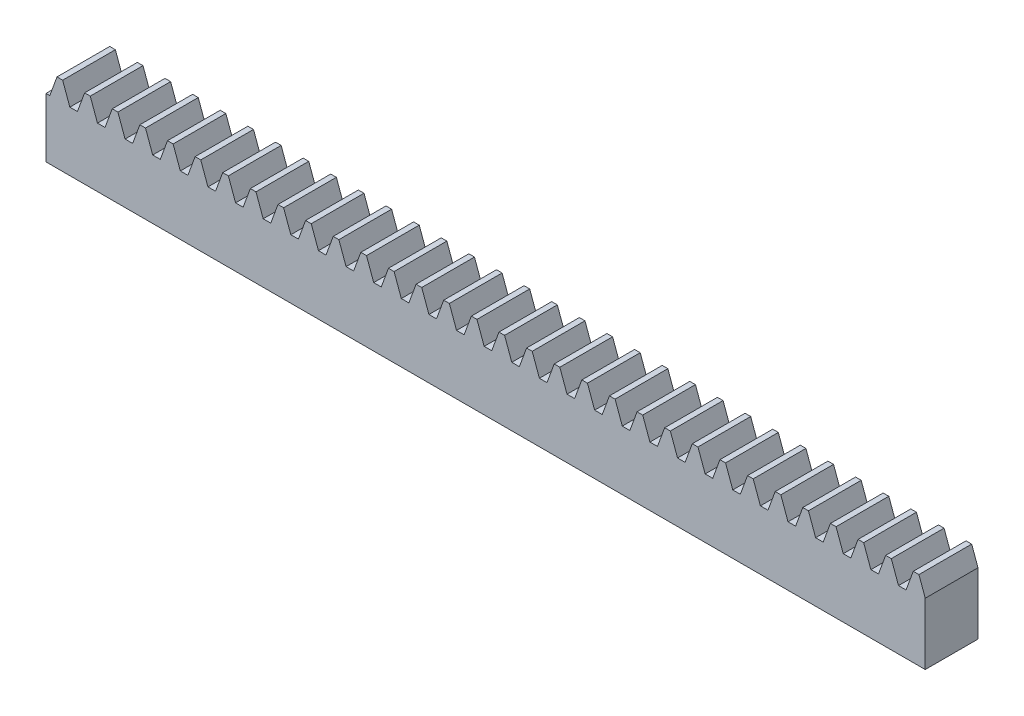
ISO-10303-21;
HEADER;
FILE_DESCRIPTION(('STEP AP214'),'2;1');
FILE_NAME('part.step','',(''),(''),'','','');
FILE_SCHEMA(('AUTOMOTIVE_DESIGN { 1 0 10303 214 1 1 1 1 }'));
ENDSEC;
DATA;
#1=APPLICATION_CONTEXT('core data for automotive mechanical design processes');
#2=APPLICATION_PROTOCOL_DEFINITION('international standard','automotive_design',2000,#1);
#3=PRODUCT_CONTEXT('',#1,'mechanical');
#4=PRODUCT('Part','Part','',(#3));
#5=PRODUCT_RELATED_PRODUCT_CATEGORY('part','',(#4));
#6=PRODUCT_DEFINITION_FORMATION('','',#4);
#7=PRODUCT_DEFINITION_CONTEXT('part definition',#1,'design');
#8=PRODUCT_DEFINITION('design','',#6,#7);
#9=PRODUCT_DEFINITION_SHAPE('','',#8);
#10=(LENGTH_UNIT() NAMED_UNIT(*) SI_UNIT(.MILLI.,.METRE.));
#11=(NAMED_UNIT(*) PLANE_ANGLE_UNIT() SI_UNIT($,.RADIAN.));
#12=(NAMED_UNIT(*) SI_UNIT($,.STERADIAN.) SOLID_ANGLE_UNIT());
#13=UNCERTAINTY_MEASURE_WITH_UNIT(LENGTH_MEASURE(1.E-05),#10,'distance_accuracy_value','');
#14=(GEOMETRIC_REPRESENTATION_CONTEXT(3) GLOBAL_UNCERTAINTY_ASSIGNED_CONTEXT((#13)) GLOBAL_UNIT_ASSIGNED_CONTEXT((#10,
#11,#12)) REPRESENTATION_CONTEXT('',''));
#15=CARTESIAN_POINT('',(0.,0.,0.));
#16=DIRECTION('',(0.,0.,1.));
#17=DIRECTION('',(1.,0.,0.));
#18=AXIS2_PLACEMENT_3D('',#15,#16,#17);
#19=CARTESIAN_POINT('',(187.630937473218,26.0755365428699,-18.75));
#20=DIRECTION('',(0.,1.,0.));
#21=DIRECTION('',(0.,0.,1.));
#22=AXIS2_PLACEMENT_3D('',#19,#20,#21);
#23=PLANE('',#22);
#24=DIRECTION('',(0.,0.,1.));
#25=VECTOR('',#24,1.);
#26=CARTESIAN_POINT('',(307.80569216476,26.0755365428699,-18.75));
#27=LINE('',#26,#25);
#28=CARTESIAN_POINT('',(307.80569216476,26.0755365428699,-18.75));
#29=VERTEX_POINT('',#28);
#30=CARTESIAN_POINT('',(307.80569216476,26.0755365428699,-11.25));
#31=VERTEX_POINT('',#30);
#32=EDGE_CURVE('E977',#29,#31,#27,.T.);
#33=ORIENTED_EDGE('',*,*,#32,.F.);
#34=DIRECTION('',(-1.,0.,0.));
#35=VECTOR('',#34,1.);
#36=CARTESIAN_POINT('',(187.630937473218,26.0755365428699,-18.75));
#37=LINE('',#36,#35);
#38=CARTESIAN_POINT('',(307.002622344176,26.0755365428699,-18.75));
#39=VERTEX_POINT('',#38);
#40=EDGE_CURVE('E1147',#29,#39,#37,.T.);
#41=ORIENTED_EDGE('',*,*,#40,.T.);
#42=DIRECTION('',(0.,0.,-1.));
#43=VECTOR('',#42,1.);
#44=CARTESIAN_POINT('',(307.002622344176,26.0755365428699,-18.75));
#45=LINE('',#44,#43);
#46=CARTESIAN_POINT('',(307.002622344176,26.0755365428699,-11.25));
#47=VERTEX_POINT('',#46);
#48=EDGE_CURVE('E980',#47,#39,#45,.T.);
#49=ORIENTED_EDGE('',*,*,#48,.F.);
#50=DIRECTION('',(-1.,0.,0.));
#51=VECTOR('',#50,1.);
#52=CARTESIAN_POINT('',(187.630937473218,26.0755365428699,-11.25));
#53=LINE('',#52,#51);
#54=EDGE_CURVE('E867',#31,#47,#53,.T.);
#55=ORIENTED_EDGE('',*,*,#54,.F.);
#56=EDGE_LOOP('',(#33,#41,#49,#55));
#57=FACE_BOUND('',#56,.T.);
#58=ADVANCED_FACE('F37',(#57),#23,.T.);
#59=DIRECTION('',(0.,0.,1.));
#60=VECTOR('',#59,1.);
#61=CARTESIAN_POINT('',(303.87870135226,26.0755365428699,-18.75));
#62=LINE('',#61,#60);
#63=CARTESIAN_POINT('',(303.87870135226,26.0755365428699,-18.75));
#64=VERTEX_POINT('',#63);
#65=CARTESIAN_POINT('',(303.87870135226,26.0755365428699,-11.25));
#66=VERTEX_POINT('',#65);
#67=EDGE_CURVE('E1202',#64,#66,#62,.T.);
#68=ORIENTED_EDGE('',*,*,#67,.F.);
#69=CARTESIAN_POINT('',(303.075631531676,26.0755365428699,-18.75));
#70=VERTEX_POINT('',#69);
#71=EDGE_CURVE('E2045',#64,#70,#37,.T.);
#72=ORIENTED_EDGE('',*,*,#71,.T.);
#73=DIRECTION('',(0.,0.,-1.));
#74=VECTOR('',#73,1.);
#75=CARTESIAN_POINT('',(303.075631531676,26.0755365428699,-18.75));
#76=LINE('',#75,#74);
#77=CARTESIAN_POINT('',(303.075631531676,26.0755365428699,-11.25));
#78=VERTEX_POINT('',#77);
#79=EDGE_CURVE('E1221',#78,#70,#76,.T.);
#80=ORIENTED_EDGE('',*,*,#79,.F.);
#81=EDGE_CURVE('E981',#66,#78,#53,.T.);
#82=ORIENTED_EDGE('',*,*,#81,.F.);
#83=EDGE_LOOP('',(#68,#72,#80,#82));
#84=FACE_BOUND('',#83,.T.);
#85=ADVANCED_FACE('F1882',(#84),#23,.T.);
#86=DIRECTION('',(0.,0.,1.));
#87=VECTOR('',#86,1.);
#88=CARTESIAN_POINT('',(299.95171053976,26.0755365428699,-18.75));
#89=LINE('',#88,#87);
#90=CARTESIAN_POINT('',(299.95171053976,26.0755365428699,-18.75));
#91=VERTEX_POINT('',#90);
#92=CARTESIAN_POINT('',(299.95171053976,26.0755365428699,-11.25));
#93=VERTEX_POINT('',#92);
#94=EDGE_CURVE('E1225',#91,#93,#89,.T.);
#95=ORIENTED_EDGE('',*,*,#94,.F.);
#96=CARTESIAN_POINT('',(299.148640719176,26.0755365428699,-18.75));
#97=VERTEX_POINT('',#96);
#98=EDGE_CURVE('E2040',#91,#97,#37,.T.);
#99=ORIENTED_EDGE('',*,*,#98,.T.);
#100=DIRECTION('',(0.,0.,-1.));
#101=VECTOR('',#100,1.);
#102=CARTESIAN_POINT('',(299.148640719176,26.0755365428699,-18.75));
#103=LINE('',#102,#101);
#104=CARTESIAN_POINT('',(299.148640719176,26.0755365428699,-11.25));
#105=VERTEX_POINT('',#104);
#106=EDGE_CURVE('E1244',#105,#97,#103,.T.);
#107=ORIENTED_EDGE('',*,*,#106,.F.);
#108=EDGE_CURVE('E982',#93,#105,#53,.T.);
#109=ORIENTED_EDGE('',*,*,#108,.F.);
#110=EDGE_LOOP('',(#95,#99,#107,#109));
#111=FACE_BOUND('',#110,.T.);
#112=ADVANCED_FACE('F1888',(#111),#23,.T.);
#113=DIRECTION('',(0.,0.,1.));
#114=VECTOR('',#113,1.);
#115=CARTESIAN_POINT('',(296.02471972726,26.0755365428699,-18.75));
#116=LINE('',#115,#114);
#117=CARTESIAN_POINT('',(296.02471972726,26.0755365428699,-18.75));
#118=VERTEX_POINT('',#117);
#119=CARTESIAN_POINT('',(296.02471972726,26.0755365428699,-11.25));
#120=VERTEX_POINT('',#119);
#121=EDGE_CURVE('E1248',#118,#120,#116,.T.);
#122=ORIENTED_EDGE('',*,*,#121,.F.);
#123=CARTESIAN_POINT('',(295.221649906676,26.0755365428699,-18.75));
#124=VERTEX_POINT('',#123);
#125=EDGE_CURVE('E2035',#118,#124,#37,.T.);
#126=ORIENTED_EDGE('',*,*,#125,.T.);
#127=DIRECTION('',(0.,0.,-1.));
#128=VECTOR('',#127,1.);
#129=CARTESIAN_POINT('',(295.221649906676,26.0755365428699,-18.75));
#130=LINE('',#129,#128);
#131=CARTESIAN_POINT('',(295.221649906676,26.0755365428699,-11.25));
#132=VERTEX_POINT('',#131);
#133=EDGE_CURVE('E1267',#132,#124,#130,.T.);
#134=ORIENTED_EDGE('',*,*,#133,.F.);
#135=EDGE_CURVE('E986',#120,#132,#53,.T.);
#136=ORIENTED_EDGE('',*,*,#135,.F.);
#137=EDGE_LOOP('',(#122,#126,#134,#136));
#138=FACE_BOUND('',#137,.T.);
#139=ADVANCED_FACE('F2080',(#138),#23,.T.);
#140=DIRECTION('',(0.,0.,1.));
#141=VECTOR('',#140,1.);
#142=CARTESIAN_POINT('',(292.09772891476,26.0755365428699,-18.75));
#143=LINE('',#142,#141);
#144=CARTESIAN_POINT('',(292.09772891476,26.0755365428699,-18.75));
#145=VERTEX_POINT('',#144);
#146=CARTESIAN_POINT('',(292.09772891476,26.0755365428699,-11.25));
#147=VERTEX_POINT('',#146);
#148=EDGE_CURVE('E1271',#145,#147,#143,.T.);
#149=ORIENTED_EDGE('',*,*,#148,.F.);
#150=CARTESIAN_POINT('',(291.294659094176,26.0755365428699,-18.75));
#151=VERTEX_POINT('',#150);
#152=EDGE_CURVE('E2030',#145,#151,#37,.T.);
#153=ORIENTED_EDGE('',*,*,#152,.T.);
#154=DIRECTION('',(0.,0.,-1.));
#155=VECTOR('',#154,1.);
#156=CARTESIAN_POINT('',(291.294659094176,26.0755365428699,-18.75));
#157=LINE('',#156,#155);
#158=CARTESIAN_POINT('',(291.294659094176,26.0755365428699,-11.25));
#159=VERTEX_POINT('',#158);
#160=EDGE_CURVE('E1290',#159,#151,#157,.T.);
#161=ORIENTED_EDGE('',*,*,#160,.F.);
#162=EDGE_CURVE('E990',#147,#159,#53,.T.);
#163=ORIENTED_EDGE('',*,*,#162,.F.);
#164=EDGE_LOOP('',(#149,#153,#161,#163));
#165=FACE_BOUND('',#164,.T.);
#166=ADVANCED_FACE('F2090',(#165),#23,.T.);
#167=DIRECTION('',(0.,0.,1.));
#168=VECTOR('',#167,1.);
#169=CARTESIAN_POINT('',(288.17073810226,26.0755365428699,-18.75));
#170=LINE('',#169,#168);
#171=CARTESIAN_POINT('',(288.17073810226,26.0755365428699,-18.75));
#172=VERTEX_POINT('',#171);
#173=CARTESIAN_POINT('',(288.17073810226,26.0755365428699,-11.25));
#174=VERTEX_POINT('',#173);
#175=EDGE_CURVE('E1294',#172,#174,#170,.T.);
#176=ORIENTED_EDGE('',*,*,#175,.F.);
#177=CARTESIAN_POINT('',(287.367668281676,26.0755365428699,-18.75));
#178=VERTEX_POINT('',#177);
#179=EDGE_CURVE('E2025',#172,#178,#37,.T.);
#180=ORIENTED_EDGE('',*,*,#179,.T.);
#181=DIRECTION('',(0.,0.,-1.));
#182=VECTOR('',#181,1.);
#183=CARTESIAN_POINT('',(287.367668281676,26.0755365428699,-18.75));
#184=LINE('',#183,#182);
#185=CARTESIAN_POINT('',(287.367668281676,26.0755365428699,-11.25));
#186=VERTEX_POINT('',#185);
#187=EDGE_CURVE('E1313',#186,#178,#184,.T.);
#188=ORIENTED_EDGE('',*,*,#187,.F.);
#189=EDGE_CURVE('E994',#174,#186,#53,.T.);
#190=ORIENTED_EDGE('',*,*,#189,.F.);
#191=EDGE_LOOP('',(#176,#180,#188,#190));
#192=FACE_BOUND('',#191,.T.);
#193=ADVANCED_FACE('F2100',(#192),#23,.T.);
#194=DIRECTION('',(0.,0.,1.));
#195=VECTOR('',#194,1.);
#196=CARTESIAN_POINT('',(284.24374728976,26.0755365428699,-18.75));
#197=LINE('',#196,#195);
#198=CARTESIAN_POINT('',(284.24374728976,26.0755365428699,-18.75));
#199=VERTEX_POINT('',#198);
#200=CARTESIAN_POINT('',(284.24374728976,26.0755365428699,-11.25));
#201=VERTEX_POINT('',#200);
#202=EDGE_CURVE('E1317',#199,#201,#197,.T.);
#203=ORIENTED_EDGE('',*,*,#202,.F.);
#204=CARTESIAN_POINT('',(283.440677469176,26.0755365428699,-18.75));
#205=VERTEX_POINT('',#204);
#206=EDGE_CURVE('E2020',#199,#205,#37,.T.);
#207=ORIENTED_EDGE('',*,*,#206,.T.);
#208=DIRECTION('',(0.,0.,-1.));
#209=VECTOR('',#208,1.);
#210=CARTESIAN_POINT('',(283.440677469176,26.0755365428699,-18.75));
#211=LINE('',#210,#209);
#212=CARTESIAN_POINT('',(283.440677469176,26.0755365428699,-11.25));
#213=VERTEX_POINT('',#212);
#214=EDGE_CURVE('E1336',#213,#205,#211,.T.);
#215=ORIENTED_EDGE('',*,*,#214,.F.);
#216=EDGE_CURVE('E998',#201,#213,#53,.T.);
#217=ORIENTED_EDGE('',*,*,#216,.F.);
#218=EDGE_LOOP('',(#203,#207,#215,#217));
#219=FACE_BOUND('',#218,.T.);
#220=ADVANCED_FACE('F2110',(#219),#23,.T.);
#221=DIRECTION('',(0.,0.,1.));
#222=VECTOR('',#221,1.);
#223=CARTESIAN_POINT('',(280.31675647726,26.0755365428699,-18.75));
#224=LINE('',#223,#222);
#225=CARTESIAN_POINT('',(280.31675647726,26.0755365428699,-18.75));
#226=VERTEX_POINT('',#225);
#227=CARTESIAN_POINT('',(280.31675647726,26.0755365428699,-11.25));
#228=VERTEX_POINT('',#227);
#229=EDGE_CURVE('E1340',#226,#228,#224,.T.);
#230=ORIENTED_EDGE('',*,*,#229,.F.);
#231=CARTESIAN_POINT('',(279.513686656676,26.0755365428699,-18.75));
#232=VERTEX_POINT('',#231);
#233=EDGE_CURVE('E2015',#226,#232,#37,.T.);
#234=ORIENTED_EDGE('',*,*,#233,.T.);
#235=DIRECTION('',(0.,0.,-1.));
#236=VECTOR('',#235,1.);
#237=CARTESIAN_POINT('',(279.513686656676,26.0755365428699,-18.75));
#238=LINE('',#237,#236);
#239=CARTESIAN_POINT('',(279.513686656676,26.0755365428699,-11.25));
#240=VERTEX_POINT('',#239);
#241=EDGE_CURVE('E1359',#240,#232,#238,.T.);
#242=ORIENTED_EDGE('',*,*,#241,.F.);
#243=EDGE_CURVE('E1002',#228,#240,#53,.T.);
#244=ORIENTED_EDGE('',*,*,#243,.F.);
#245=EDGE_LOOP('',(#230,#234,#242,#244));
#246=FACE_BOUND('',#245,.T.);
#247=ADVANCED_FACE('F2120',(#246),#23,.T.);
#248=DIRECTION('',(0.,0.,1.));
#249=VECTOR('',#248,1.);
#250=CARTESIAN_POINT('',(276.38976566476,26.0755365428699,-18.75));
#251=LINE('',#250,#249);
#252=CARTESIAN_POINT('',(276.38976566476,26.0755365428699,-18.75));
#253=VERTEX_POINT('',#252);
#254=CARTESIAN_POINT('',(276.38976566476,26.0755365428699,-11.25));
#255=VERTEX_POINT('',#254);
#256=EDGE_CURVE('E1363',#253,#255,#251,.T.);
#257=ORIENTED_EDGE('',*,*,#256,.F.);
#258=CARTESIAN_POINT('',(275.586695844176,26.0755365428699,-18.75));
#259=VERTEX_POINT('',#258);
#260=EDGE_CURVE('E2010',#253,#259,#37,.T.);
#261=ORIENTED_EDGE('',*,*,#260,.T.);
#262=DIRECTION('',(0.,0.,-1.));
#263=VECTOR('',#262,1.);
#264=CARTESIAN_POINT('',(275.586695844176,26.0755365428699,-18.75));
#265=LINE('',#264,#263);
#266=CARTESIAN_POINT('',(275.586695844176,26.0755365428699,-11.25));
#267=VERTEX_POINT('',#266);
#268=EDGE_CURVE('E1382',#267,#259,#265,.T.);
#269=ORIENTED_EDGE('',*,*,#268,.F.);
#270=EDGE_CURVE('E1006',#255,#267,#53,.T.);
#271=ORIENTED_EDGE('',*,*,#270,.F.);
#272=EDGE_LOOP('',(#257,#261,#269,#271));
#273=FACE_BOUND('',#272,.T.);
#274=ADVANCED_FACE('F2130',(#273),#23,.T.);
#275=DIRECTION('',(0.,0.,1.));
#276=VECTOR('',#275,1.);
#277=CARTESIAN_POINT('',(272.46277485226,26.0755365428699,-18.75));
#278=LINE('',#277,#276);
#279=CARTESIAN_POINT('',(272.46277485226,26.0755365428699,-18.75));
#280=VERTEX_POINT('',#279);
#281=CARTESIAN_POINT('',(272.46277485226,26.0755365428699,-11.25));
#282=VERTEX_POINT('',#281);
#283=EDGE_CURVE('E1386',#280,#282,#278,.T.);
#284=ORIENTED_EDGE('',*,*,#283,.F.);
#285=CARTESIAN_POINT('',(271.659705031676,26.0755365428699,-18.75));
#286=VERTEX_POINT('',#285);
#287=EDGE_CURVE('E2005',#280,#286,#37,.T.);
#288=ORIENTED_EDGE('',*,*,#287,.T.);
#289=DIRECTION('',(0.,0.,-1.));
#290=VECTOR('',#289,1.);
#291=CARTESIAN_POINT('',(271.659705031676,26.0755365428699,-18.75));
#292=LINE('',#291,#290);
#293=CARTESIAN_POINT('',(271.659705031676,26.0755365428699,-11.25));
#294=VERTEX_POINT('',#293);
#295=EDGE_CURVE('E1405',#294,#286,#292,.T.);
#296=ORIENTED_EDGE('',*,*,#295,.F.);
#297=EDGE_CURVE('E1010',#282,#294,#53,.T.);
#298=ORIENTED_EDGE('',*,*,#297,.F.);
#299=EDGE_LOOP('',(#284,#288,#296,#298));
#300=FACE_BOUND('',#299,.T.);
#301=ADVANCED_FACE('F2140',(#300),#23,.T.);
#302=DIRECTION('',(0.,0.,1.));
#303=VECTOR('',#302,1.);
#304=CARTESIAN_POINT('',(268.53578403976,26.0755365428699,-18.75));
#305=LINE('',#304,#303);
#306=CARTESIAN_POINT('',(268.53578403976,26.0755365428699,-18.75));
#307=VERTEX_POINT('',#306);
#308=CARTESIAN_POINT('',(268.53578403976,26.0755365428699,-11.25));
#309=VERTEX_POINT('',#308);
#310=EDGE_CURVE('E1409',#307,#309,#305,.T.);
#311=ORIENTED_EDGE('',*,*,#310,.F.);
#312=CARTESIAN_POINT('',(267.732714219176,26.0755365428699,-18.75));
#313=VERTEX_POINT('',#312);
#314=EDGE_CURVE('E2000',#307,#313,#37,.T.);
#315=ORIENTED_EDGE('',*,*,#314,.T.);
#316=DIRECTION('',(0.,0.,-1.));
#317=VECTOR('',#316,1.);
#318=CARTESIAN_POINT('',(267.732714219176,26.0755365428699,-18.75));
#319=LINE('',#318,#317);
#320=CARTESIAN_POINT('',(267.732714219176,26.0755365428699,-11.25));
#321=VERTEX_POINT('',#320);
#322=EDGE_CURVE('E1428',#321,#313,#319,.T.);
#323=ORIENTED_EDGE('',*,*,#322,.F.);
#324=EDGE_CURVE('E1014',#309,#321,#53,.T.);
#325=ORIENTED_EDGE('',*,*,#324,.F.);
#326=EDGE_LOOP('',(#311,#315,#323,#325));
#327=FACE_BOUND('',#326,.T.);
#328=ADVANCED_FACE('F2150',(#327),#23,.T.);
#329=DIRECTION('',(0.,0.,1.));
#330=VECTOR('',#329,1.);
#331=CARTESIAN_POINT('',(264.60879322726,26.0755365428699,-18.75));
#332=LINE('',#331,#330);
#333=CARTESIAN_POINT('',(264.60879322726,26.0755365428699,-18.75));
#334=VERTEX_POINT('',#333);
#335=CARTESIAN_POINT('',(264.60879322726,26.0755365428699,-11.25));
#336=VERTEX_POINT('',#335);
#337=EDGE_CURVE('E1432',#334,#336,#332,.T.);
#338=ORIENTED_EDGE('',*,*,#337,.F.);
#339=CARTESIAN_POINT('',(263.805723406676,26.0755365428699,-18.75));
#340=VERTEX_POINT('',#339);
#341=EDGE_CURVE('E1995',#334,#340,#37,.T.);
#342=ORIENTED_EDGE('',*,*,#341,.T.);
#343=DIRECTION('',(0.,0.,-1.));
#344=VECTOR('',#343,1.);
#345=CARTESIAN_POINT('',(263.805723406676,26.0755365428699,-18.75));
#346=LINE('',#345,#344);
#347=CARTESIAN_POINT('',(263.805723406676,26.0755365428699,-11.25));
#348=VERTEX_POINT('',#347);
#349=EDGE_CURVE('E1451',#348,#340,#346,.T.);
#350=ORIENTED_EDGE('',*,*,#349,.F.);
#351=EDGE_CURVE('E1018',#336,#348,#53,.T.);
#352=ORIENTED_EDGE('',*,*,#351,.F.);
#353=EDGE_LOOP('',(#338,#342,#350,#352));
#354=FACE_BOUND('',#353,.T.);
#355=ADVANCED_FACE('F2160',(#354),#23,.T.);
#356=DIRECTION('',(0.,0.,1.));
#357=VECTOR('',#356,1.);
#358=CARTESIAN_POINT('',(260.68180241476,26.0755365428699,-18.75));
#359=LINE('',#358,#357);
#360=CARTESIAN_POINT('',(260.68180241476,26.0755365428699,-18.75));
#361=VERTEX_POINT('',#360);
#362=CARTESIAN_POINT('',(260.68180241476,26.0755365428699,-11.25));
#363=VERTEX_POINT('',#362);
#364=EDGE_CURVE('E1455',#361,#363,#359,.T.);
#365=ORIENTED_EDGE('',*,*,#364,.F.);
#366=CARTESIAN_POINT('',(259.878732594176,26.0755365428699,-18.75));
#367=VERTEX_POINT('',#366);
#368=EDGE_CURVE('E1990',#361,#367,#37,.T.);
#369=ORIENTED_EDGE('',*,*,#368,.T.);
#370=DIRECTION('',(0.,0.,-1.));
#371=VECTOR('',#370,1.);
#372=CARTESIAN_POINT('',(259.878732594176,26.0755365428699,-18.75));
#373=LINE('',#372,#371);
#374=CARTESIAN_POINT('',(259.878732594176,26.0755365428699,-11.25));
#375=VERTEX_POINT('',#374);
#376=EDGE_CURVE('E1474',#375,#367,#373,.T.);
#377=ORIENTED_EDGE('',*,*,#376,.F.);
#378=EDGE_CURVE('E1022',#363,#375,#53,.T.);
#379=ORIENTED_EDGE('',*,*,#378,.F.);
#380=EDGE_LOOP('',(#365,#369,#377,#379));
#381=FACE_BOUND('',#380,.T.);
#382=ADVANCED_FACE('F2170',(#381),#23,.T.);
#383=DIRECTION('',(0.,0.,1.));
#384=VECTOR('',#383,1.);
#385=CARTESIAN_POINT('',(256.75481160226,26.0755365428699,-18.75));
#386=LINE('',#385,#384);
#387=CARTESIAN_POINT('',(256.75481160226,26.0755365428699,-18.75));
#388=VERTEX_POINT('',#387);
#389=CARTESIAN_POINT('',(256.75481160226,26.0755365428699,-11.25));
#390=VERTEX_POINT('',#389);
#391=EDGE_CURVE('E1478',#388,#390,#386,.T.);
#392=ORIENTED_EDGE('',*,*,#391,.F.);
#393=CARTESIAN_POINT('',(255.951741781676,26.0755365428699,-18.75));
#394=VERTEX_POINT('',#393);
#395=EDGE_CURVE('E1985',#388,#394,#37,.T.);
#396=ORIENTED_EDGE('',*,*,#395,.T.);
#397=DIRECTION('',(0.,0.,-1.));
#398=VECTOR('',#397,1.);
#399=CARTESIAN_POINT('',(255.951741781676,26.0755365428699,-18.75));
#400=LINE('',#399,#398);
#401=CARTESIAN_POINT('',(255.951741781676,26.0755365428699,-11.25));
#402=VERTEX_POINT('',#401);
#403=EDGE_CURVE('E1497',#402,#394,#400,.T.);
#404=ORIENTED_EDGE('',*,*,#403,.F.);
#405=EDGE_CURVE('E1026',#390,#402,#53,.T.);
#406=ORIENTED_EDGE('',*,*,#405,.F.);
#407=EDGE_LOOP('',(#392,#396,#404,#406));
#408=FACE_BOUND('',#407,.T.);
#409=ADVANCED_FACE('F2180',(#408),#23,.T.);
#410=DIRECTION('',(0.,0.,1.));
#411=VECTOR('',#410,1.);
#412=CARTESIAN_POINT('',(252.82782078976,26.0755365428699,-18.75));
#413=LINE('',#412,#411);
#414=CARTESIAN_POINT('',(252.82782078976,26.0755365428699,-18.75));
#415=VERTEX_POINT('',#414);
#416=CARTESIAN_POINT('',(252.82782078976,26.0755365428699,-11.25));
#417=VERTEX_POINT('',#416);
#418=EDGE_CURVE('E1501',#415,#417,#413,.T.);
#419=ORIENTED_EDGE('',*,*,#418,.F.);
#420=CARTESIAN_POINT('',(252.024750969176,26.0755365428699,-18.75));
#421=VERTEX_POINT('',#420);
#422=EDGE_CURVE('E1980',#415,#421,#37,.T.);
#423=ORIENTED_EDGE('',*,*,#422,.T.);
#424=DIRECTION('',(0.,0.,-1.));
#425=VECTOR('',#424,1.);
#426=CARTESIAN_POINT('',(252.024750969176,26.0755365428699,-18.75));
#427=LINE('',#426,#425);
#428=CARTESIAN_POINT('',(252.024750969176,26.0755365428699,-11.25));
#429=VERTEX_POINT('',#428);
#430=EDGE_CURVE('E1520',#429,#421,#427,.T.);
#431=ORIENTED_EDGE('',*,*,#430,.F.);
#432=EDGE_CURVE('E1030',#417,#429,#53,.T.);
#433=ORIENTED_EDGE('',*,*,#432,.F.);
#434=EDGE_LOOP('',(#419,#423,#431,#433));
#435=FACE_BOUND('',#434,.T.);
#436=ADVANCED_FACE('F2190',(#435),#23,.T.);
#437=DIRECTION('',(0.,0.,1.));
#438=VECTOR('',#437,1.);
#439=CARTESIAN_POINT('',(248.90082997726,26.0755365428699,-18.75));
#440=LINE('',#439,#438);
#441=CARTESIAN_POINT('',(248.90082997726,26.0755365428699,-18.75));
#442=VERTEX_POINT('',#441);
#443=CARTESIAN_POINT('',(248.90082997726,26.0755365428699,-11.25));
#444=VERTEX_POINT('',#443);
#445=EDGE_CURVE('E1524',#442,#444,#440,.T.);
#446=ORIENTED_EDGE('',*,*,#445,.F.);
#447=CARTESIAN_POINT('',(248.097760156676,26.0755365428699,-18.75));
#448=VERTEX_POINT('',#447);
#449=EDGE_CURVE('E1975',#442,#448,#37,.T.);
#450=ORIENTED_EDGE('',*,*,#449,.T.);
#451=DIRECTION('',(0.,0.,-1.));
#452=VECTOR('',#451,1.);
#453=CARTESIAN_POINT('',(248.097760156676,26.0755365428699,-18.75));
#454=LINE('',#453,#452);
#455=CARTESIAN_POINT('',(248.097760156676,26.0755365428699,-11.25));
#456=VERTEX_POINT('',#455);
#457=EDGE_CURVE('E1543',#456,#448,#454,.T.);
#458=ORIENTED_EDGE('',*,*,#457,.F.);
#459=EDGE_CURVE('E1034',#444,#456,#53,.T.);
#460=ORIENTED_EDGE('',*,*,#459,.F.);
#461=EDGE_LOOP('',(#446,#450,#458,#460));
#462=FACE_BOUND('',#461,.T.);
#463=ADVANCED_FACE('F2200',(#462),#23,.T.);
#464=DIRECTION('',(0.,0.,1.));
#465=VECTOR('',#464,1.);
#466=CARTESIAN_POINT('',(244.97383916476,26.0755365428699,-18.75));
#467=LINE('',#466,#465);
#468=CARTESIAN_POINT('',(244.97383916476,26.0755365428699,-18.75));
#469=VERTEX_POINT('',#468);
#470=CARTESIAN_POINT('',(244.97383916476,26.0755365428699,-11.25));
#471=VERTEX_POINT('',#470);
#472=EDGE_CURVE('E1547',#469,#471,#467,.T.);
#473=ORIENTED_EDGE('',*,*,#472,.F.);
#474=CARTESIAN_POINT('',(244.170769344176,26.0755365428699,-18.75));
#475=VERTEX_POINT('',#474);
#476=EDGE_CURVE('E1970',#469,#475,#37,.T.);
#477=ORIENTED_EDGE('',*,*,#476,.T.);
#478=DIRECTION('',(0.,0.,-1.));
#479=VECTOR('',#478,1.);
#480=CARTESIAN_POINT('',(244.170769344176,26.0755365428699,-18.75));
#481=LINE('',#480,#479);
#482=CARTESIAN_POINT('',(244.170769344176,26.0755365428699,-11.25));
#483=VERTEX_POINT('',#482);
#484=EDGE_CURVE('E1566',#483,#475,#481,.T.);
#485=ORIENTED_EDGE('',*,*,#484,.F.);
#486=EDGE_CURVE('E1038',#471,#483,#53,.T.);
#487=ORIENTED_EDGE('',*,*,#486,.F.);
#488=EDGE_LOOP('',(#473,#477,#485,#487));
#489=FACE_BOUND('',#488,.T.);
#490=ADVANCED_FACE('F2210',(#489),#23,.T.);
#491=DIRECTION('',(0.,0.,1.));
#492=VECTOR('',#491,1.);
#493=CARTESIAN_POINT('',(241.04684835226,26.0755365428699,-18.75));
#494=LINE('',#493,#492);
#495=CARTESIAN_POINT('',(241.04684835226,26.0755365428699,-18.75));
#496=VERTEX_POINT('',#495);
#497=CARTESIAN_POINT('',(241.04684835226,26.0755365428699,-11.25));
#498=VERTEX_POINT('',#497);
#499=EDGE_CURVE('E1570',#496,#498,#494,.T.);
#500=ORIENTED_EDGE('',*,*,#499,.F.);
#501=CARTESIAN_POINT('',(240.243778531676,26.0755365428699,-18.75));
#502=VERTEX_POINT('',#501);
#503=EDGE_CURVE('E1965',#496,#502,#37,.T.);
#504=ORIENTED_EDGE('',*,*,#503,.T.);
#505=DIRECTION('',(0.,0.,-1.));
#506=VECTOR('',#505,1.);
#507=CARTESIAN_POINT('',(240.243778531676,26.0755365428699,-18.75));
#508=LINE('',#507,#506);
#509=CARTESIAN_POINT('',(240.243778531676,26.0755365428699,-11.25));
#510=VERTEX_POINT('',#509);
#511=EDGE_CURVE('E1589',#510,#502,#508,.T.);
#512=ORIENTED_EDGE('',*,*,#511,.F.);
#513=EDGE_CURVE('E1042',#498,#510,#53,.T.);
#514=ORIENTED_EDGE('',*,*,#513,.F.);
#515=EDGE_LOOP('',(#500,#504,#512,#514));
#516=FACE_BOUND('',#515,.T.);
#517=ADVANCED_FACE('F2220',(#516),#23,.T.);
#518=DIRECTION('',(0.,0.,1.));
#519=VECTOR('',#518,1.);
#520=CARTESIAN_POINT('',(237.11985753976,26.0755365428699,-18.75));
#521=LINE('',#520,#519);
#522=CARTESIAN_POINT('',(237.11985753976,26.0755365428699,-18.75));
#523=VERTEX_POINT('',#522);
#524=CARTESIAN_POINT('',(237.11985753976,26.0755365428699,-11.25));
#525=VERTEX_POINT('',#524);
#526=EDGE_CURVE('E1593',#523,#525,#521,.T.);
#527=ORIENTED_EDGE('',*,*,#526,.F.);
#528=CARTESIAN_POINT('',(236.316787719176,26.0755365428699,-18.75));
#529=VERTEX_POINT('',#528);
#530=EDGE_CURVE('E1960',#523,#529,#37,.T.);
#531=ORIENTED_EDGE('',*,*,#530,.T.);
#532=DIRECTION('',(0.,0.,-1.));
#533=VECTOR('',#532,1.);
#534=CARTESIAN_POINT('',(236.316787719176,26.0755365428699,-18.75));
#535=LINE('',#534,#533);
#536=CARTESIAN_POINT('',(236.316787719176,26.0755365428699,-11.25));
#537=VERTEX_POINT('',#536);
#538=EDGE_CURVE('E1612',#537,#529,#535,.T.);
#539=ORIENTED_EDGE('',*,*,#538,.F.);
#540=EDGE_CURVE('E1046',#525,#537,#53,.T.);
#541=ORIENTED_EDGE('',*,*,#540,.F.);
#542=EDGE_LOOP('',(#527,#531,#539,#541));
#543=FACE_BOUND('',#542,.T.);
#544=ADVANCED_FACE('F2230',(#543),#23,.T.);
#545=DIRECTION('',(0.,0.,1.));
#546=VECTOR('',#545,1.);
#547=CARTESIAN_POINT('',(233.19286672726,26.0755365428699,-18.75));
#548=LINE('',#547,#546);
#549=CARTESIAN_POINT('',(233.19286672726,26.0755365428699,-18.75));
#550=VERTEX_POINT('',#549);
#551=CARTESIAN_POINT('',(233.19286672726,26.0755365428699,-11.25));
#552=VERTEX_POINT('',#551);
#553=EDGE_CURVE('E1616',#550,#552,#548,.T.);
#554=ORIENTED_EDGE('',*,*,#553,.F.);
#555=CARTESIAN_POINT('',(232.389796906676,26.0755365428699,-18.75));
#556=VERTEX_POINT('',#555);
#557=EDGE_CURVE('E1955',#550,#556,#37,.T.);
#558=ORIENTED_EDGE('',*,*,#557,.T.);
#559=DIRECTION('',(0.,0.,-1.));
#560=VECTOR('',#559,1.);
#561=CARTESIAN_POINT('',(232.389796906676,26.0755365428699,-18.75));
#562=LINE('',#561,#560);
#563=CARTESIAN_POINT('',(232.389796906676,26.0755365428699,-11.25));
#564=VERTEX_POINT('',#563);
#565=EDGE_CURVE('E1635',#564,#556,#562,.T.);
#566=ORIENTED_EDGE('',*,*,#565,.F.);
#567=EDGE_CURVE('E1050',#552,#564,#53,.T.);
#568=ORIENTED_EDGE('',*,*,#567,.F.);
#569=EDGE_LOOP('',(#554,#558,#566,#568));
#570=FACE_BOUND('',#569,.T.);
#571=ADVANCED_FACE('F2240',(#570),#23,.T.);
#572=DIRECTION('',(0.,0.,1.));
#573=VECTOR('',#572,1.);
#574=CARTESIAN_POINT('',(229.26587591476,26.0755365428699,-18.75));
#575=LINE('',#574,#573);
#576=CARTESIAN_POINT('',(229.26587591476,26.0755365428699,-18.75));
#577=VERTEX_POINT('',#576);
#578=CARTESIAN_POINT('',(229.26587591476,26.0755365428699,-11.25));
#579=VERTEX_POINT('',#578);
#580=EDGE_CURVE('E1639',#577,#579,#575,.T.);
#581=ORIENTED_EDGE('',*,*,#580,.F.);
#582=CARTESIAN_POINT('',(228.462806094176,26.0755365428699,-18.75));
#583=VERTEX_POINT('',#582);
#584=EDGE_CURVE('E1950',#577,#583,#37,.T.);
#585=ORIENTED_EDGE('',*,*,#584,.T.);
#586=DIRECTION('',(0.,0.,-1.));
#587=VECTOR('',#586,1.);
#588=CARTESIAN_POINT('',(228.462806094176,26.0755365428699,-18.75));
#589=LINE('',#588,#587);
#590=CARTESIAN_POINT('',(228.462806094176,26.0755365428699,-11.25));
#591=VERTEX_POINT('',#590);
#592=EDGE_CURVE('E1658',#591,#583,#589,.T.);
#593=ORIENTED_EDGE('',*,*,#592,.F.);
#594=EDGE_CURVE('E1054',#579,#591,#53,.T.);
#595=ORIENTED_EDGE('',*,*,#594,.F.);
#596=EDGE_LOOP('',(#581,#585,#593,#595));
#597=FACE_BOUND('',#596,.T.);
#598=ADVANCED_FACE('F2250',(#597),#23,.T.);
#599=DIRECTION('',(0.,0.,1.));
#600=VECTOR('',#599,1.);
#601=CARTESIAN_POINT('',(225.33888510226,26.0755365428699,-18.75));
#602=LINE('',#601,#600);
#603=CARTESIAN_POINT('',(225.33888510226,26.0755365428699,-18.75));
#604=VERTEX_POINT('',#603);
#605=CARTESIAN_POINT('',(225.33888510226,26.0755365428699,-11.25));
#606=VERTEX_POINT('',#605);
#607=EDGE_CURVE('E1662',#604,#606,#602,.T.);
#608=ORIENTED_EDGE('',*,*,#607,.F.);
#609=CARTESIAN_POINT('',(224.535815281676,26.0755365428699,-18.75));
#610=VERTEX_POINT('',#609);
#611=EDGE_CURVE('E1945',#604,#610,#37,.T.);
#612=ORIENTED_EDGE('',*,*,#611,.T.);
#613=DIRECTION('',(0.,0.,-1.));
#614=VECTOR('',#613,1.);
#615=CARTESIAN_POINT('',(224.535815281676,26.0755365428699,-18.75));
#616=LINE('',#615,#614);
#617=CARTESIAN_POINT('',(224.535815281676,26.0755365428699,-11.25));
#618=VERTEX_POINT('',#617);
#619=EDGE_CURVE('E1681',#618,#610,#616,.T.);
#620=ORIENTED_EDGE('',*,*,#619,.F.);
#621=EDGE_CURVE('E1058',#606,#618,#53,.T.);
#622=ORIENTED_EDGE('',*,*,#621,.F.);
#623=EDGE_LOOP('',(#608,#612,#620,#622));
#624=FACE_BOUND('',#623,.T.);
#625=ADVANCED_FACE('F2260',(#624),#23,.T.);
#626=DIRECTION('',(0.,0.,1.));
#627=VECTOR('',#626,1.);
#628=CARTESIAN_POINT('',(221.41189428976,26.0755365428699,-18.75));
#629=LINE('',#628,#627);
#630=CARTESIAN_POINT('',(221.41189428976,26.0755365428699,-18.75));
#631=VERTEX_POINT('',#630);
#632=CARTESIAN_POINT('',(221.41189428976,26.0755365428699,-11.25));
#633=VERTEX_POINT('',#632);
#634=EDGE_CURVE('E1685',#631,#633,#629,.T.);
#635=ORIENTED_EDGE('',*,*,#634,.F.);
#636=CARTESIAN_POINT('',(220.608824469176,26.0755365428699,-18.75));
#637=VERTEX_POINT('',#636);
#638=EDGE_CURVE('E1940',#631,#637,#37,.T.);
#639=ORIENTED_EDGE('',*,*,#638,.T.);
#640=DIRECTION('',(0.,0.,-1.));
#641=VECTOR('',#640,1.);
#642=CARTESIAN_POINT('',(220.608824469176,26.0755365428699,-18.75));
#643=LINE('',#642,#641);
#644=CARTESIAN_POINT('',(220.608824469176,26.0755365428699,-11.25));
#645=VERTEX_POINT('',#644);
#646=EDGE_CURVE('E1704',#645,#637,#643,.T.);
#647=ORIENTED_EDGE('',*,*,#646,.F.);
#648=EDGE_CURVE('E1062',#633,#645,#53,.T.);
#649=ORIENTED_EDGE('',*,*,#648,.F.);
#650=EDGE_LOOP('',(#635,#639,#647,#649));
#651=FACE_BOUND('',#650,.T.);
#652=ADVANCED_FACE('F2270',(#651),#23,.T.);
#653=DIRECTION('',(0.,0.,1.));
#654=VECTOR('',#653,1.);
#655=CARTESIAN_POINT('',(217.48490347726,26.0755365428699,-18.75));
#656=LINE('',#655,#654);
#657=CARTESIAN_POINT('',(217.48490347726,26.0755365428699,-18.75));
#658=VERTEX_POINT('',#657);
#659=CARTESIAN_POINT('',(217.48490347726,26.0755365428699,-11.25));
#660=VERTEX_POINT('',#659);
#661=EDGE_CURVE('E1708',#658,#660,#656,.T.);
#662=ORIENTED_EDGE('',*,*,#661,.F.);
#663=CARTESIAN_POINT('',(216.681833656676,26.0755365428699,-18.75));
#664=VERTEX_POINT('',#663);
#665=EDGE_CURVE('E1935',#658,#664,#37,.T.);
#666=ORIENTED_EDGE('',*,*,#665,.T.);
#667=DIRECTION('',(0.,0.,-1.));
#668=VECTOR('',#667,1.);
#669=CARTESIAN_POINT('',(216.681833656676,26.0755365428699,-18.75));
#670=LINE('',#669,#668);
#671=CARTESIAN_POINT('',(216.681833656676,26.0755365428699,-11.25));
#672=VERTEX_POINT('',#671);
#673=EDGE_CURVE('E1727',#672,#664,#670,.T.);
#674=ORIENTED_EDGE('',*,*,#673,.F.);
#675=EDGE_CURVE('E1066',#660,#672,#53,.T.);
#676=ORIENTED_EDGE('',*,*,#675,.F.);
#677=EDGE_LOOP('',(#662,#666,#674,#676));
#678=FACE_BOUND('',#677,.T.);
#679=ADVANCED_FACE('F2280',(#678),#23,.T.);
#680=DIRECTION('',(0.,0.,1.));
#681=VECTOR('',#680,1.);
#682=CARTESIAN_POINT('',(213.55791266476,26.0755365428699,-18.75));
#683=LINE('',#682,#681);
#684=CARTESIAN_POINT('',(213.55791266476,26.0755365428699,-18.75));
#685=VERTEX_POINT('',#684);
#686=CARTESIAN_POINT('',(213.55791266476,26.0755365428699,-11.25));
#687=VERTEX_POINT('',#686);
#688=EDGE_CURVE('E1731',#685,#687,#683,.T.);
#689=ORIENTED_EDGE('',*,*,#688,.F.);
#690=CARTESIAN_POINT('',(212.754842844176,26.0755365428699,-18.75));
#691=VERTEX_POINT('',#690);
#692=EDGE_CURVE('E1930',#685,#691,#37,.T.);
#693=ORIENTED_EDGE('',*,*,#692,.T.);
#694=DIRECTION('',(0.,0.,-1.));
#695=VECTOR('',#694,1.);
#696=CARTESIAN_POINT('',(212.754842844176,26.0755365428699,-18.75));
#697=LINE('',#696,#695);
#698=CARTESIAN_POINT('',(212.754842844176,26.0755365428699,-11.25));
#699=VERTEX_POINT('',#698);
#700=EDGE_CURVE('E1750',#699,#691,#697,.T.);
#701=ORIENTED_EDGE('',*,*,#700,.F.);
#702=EDGE_CURVE('E1070',#687,#699,#53,.T.);
#703=ORIENTED_EDGE('',*,*,#702,.F.);
#704=EDGE_LOOP('',(#689,#693,#701,#703));
#705=FACE_BOUND('',#704,.T.);
#706=ADVANCED_FACE('F2290',(#705),#23,.T.);
#707=DIRECTION('',(0.,0.,1.));
#708=VECTOR('',#707,1.);
#709=CARTESIAN_POINT('',(209.63092185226,26.0755365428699,-18.75));
#710=LINE('',#709,#708);
#711=CARTESIAN_POINT('',(209.63092185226,26.0755365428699,-18.75));
#712=VERTEX_POINT('',#711);
#713=CARTESIAN_POINT('',(209.63092185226,26.0755365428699,-11.25));
#714=VERTEX_POINT('',#713);
#715=EDGE_CURVE('E1754',#712,#714,#710,.T.);
#716=ORIENTED_EDGE('',*,*,#715,.F.);
#717=CARTESIAN_POINT('',(208.827852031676,26.0755365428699,-18.75));
#718=VERTEX_POINT('',#717);
#719=EDGE_CURVE('E1925',#712,#718,#37,.T.);
#720=ORIENTED_EDGE('',*,*,#719,.T.);
#721=DIRECTION('',(0.,0.,-1.));
#722=VECTOR('',#721,1.);
#723=CARTESIAN_POINT('',(208.827852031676,26.0755365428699,-18.75));
#724=LINE('',#723,#722);
#725=CARTESIAN_POINT('',(208.827852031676,26.0755365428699,-11.25));
#726=VERTEX_POINT('',#725);
#727=EDGE_CURVE('E1773',#726,#718,#724,.T.);
#728=ORIENTED_EDGE('',*,*,#727,.F.);
#729=EDGE_CURVE('E1074',#714,#726,#53,.T.);
#730=ORIENTED_EDGE('',*,*,#729,.F.);
#731=EDGE_LOOP('',(#716,#720,#728,#730));
#732=FACE_BOUND('',#731,.T.);
#733=ADVANCED_FACE('F2300',(#732),#23,.T.);
#734=DIRECTION('',(0.,0.,1.));
#735=VECTOR('',#734,1.);
#736=CARTESIAN_POINT('',(205.70393103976,26.0755365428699,-18.75));
#737=LINE('',#736,#735);
#738=CARTESIAN_POINT('',(205.70393103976,26.0755365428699,-18.75));
#739=VERTEX_POINT('',#738);
#740=CARTESIAN_POINT('',(205.70393103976,26.0755365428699,-11.25));
#741=VERTEX_POINT('',#740);
#742=EDGE_CURVE('E1777',#739,#741,#737,.T.);
#743=ORIENTED_EDGE('',*,*,#742,.F.);
#744=CARTESIAN_POINT('',(204.900861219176,26.0755365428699,-18.75));
#745=VERTEX_POINT('',#744);
#746=EDGE_CURVE('E1921',#739,#745,#37,.T.);
#747=ORIENTED_EDGE('',*,*,#746,.T.);
#748=DIRECTION('',(0.,0.,-1.));
#749=VECTOR('',#748,1.);
#750=CARTESIAN_POINT('',(204.900861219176,26.0755365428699,-18.75));
#751=LINE('',#750,#749);
#752=CARTESIAN_POINT('',(204.900861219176,26.0755365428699,-11.25));
#753=VERTEX_POINT('',#752);
#754=EDGE_CURVE('E1796',#753,#745,#751,.T.);
#755=ORIENTED_EDGE('',*,*,#754,.F.);
#756=EDGE_CURVE('E1078',#741,#753,#53,.T.);
#757=ORIENTED_EDGE('',*,*,#756,.F.);
#758=EDGE_LOOP('',(#743,#747,#755,#757));
#759=FACE_BOUND('',#758,.T.);
#760=ADVANCED_FACE('F1911',(#759),#23,.T.);
#761=DIRECTION('',(0.,0.,1.));
#762=VECTOR('',#761,1.);
#763=CARTESIAN_POINT('',(201.77694022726,26.0755365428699,-18.75));
#764=LINE('',#763,#762);
#765=CARTESIAN_POINT('',(201.77694022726,26.0755365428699,-18.75));
#766=VERTEX_POINT('',#765);
#767=CARTESIAN_POINT('',(201.77694022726,26.0755365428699,-11.25));
#768=VERTEX_POINT('',#767);
#769=EDGE_CURVE('E1800',#766,#768,#764,.T.);
#770=ORIENTED_EDGE('',*,*,#769,.F.);
#771=CARTESIAN_POINT('',(200.973870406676,26.0755365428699,-18.75));
#772=VERTEX_POINT('',#771);
#773=EDGE_CURVE('E1920',#766,#772,#37,.T.);
#774=ORIENTED_EDGE('',*,*,#773,.T.);
#775=DIRECTION('',(0.,0.,-1.));
#776=VECTOR('',#775,1.);
#777=CARTESIAN_POINT('',(200.973870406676,26.0755365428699,-18.75));
#778=LINE('',#777,#776);
#779=CARTESIAN_POINT('',(200.973870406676,26.0755365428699,-11.25));
#780=VERTEX_POINT('',#779);
#781=EDGE_CURVE('E1819',#780,#772,#778,.T.);
#782=ORIENTED_EDGE('',*,*,#781,.F.);
#783=EDGE_CURVE('E1082',#768,#780,#53,.T.);
#784=ORIENTED_EDGE('',*,*,#783,.F.);
#785=EDGE_LOOP('',(#770,#774,#782,#784));
#786=FACE_BOUND('',#785,.T.);
#787=ADVANCED_FACE('F1906',(#786),#23,.T.);
#788=DIRECTION('',(0.,0.,1.));
#789=VECTOR('',#788,1.);
#790=CARTESIAN_POINT('',(197.84994941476,26.0755365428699,-18.75));
#791=LINE('',#790,#789);
#792=CARTESIAN_POINT('',(197.84994941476,26.0755365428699,-18.75));
#793=VERTEX_POINT('',#792);
#794=CARTESIAN_POINT('',(197.84994941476,26.0755365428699,-11.25));
#795=VERTEX_POINT('',#794);
#796=EDGE_CURVE('E1823',#793,#795,#791,.T.);
#797=ORIENTED_EDGE('',*,*,#796,.F.);
#798=CARTESIAN_POINT('',(197.046879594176,26.0755365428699,-18.75));
#799=VERTEX_POINT('',#798);
#800=EDGE_CURVE('E1916',#793,#799,#37,.T.);
#801=ORIENTED_EDGE('',*,*,#800,.T.);
#802=DIRECTION('',(0.,0.,-1.));
#803=VECTOR('',#802,1.);
#804=CARTESIAN_POINT('',(197.046879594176,26.0755365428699,-18.75));
#805=LINE('',#804,#803);
#806=CARTESIAN_POINT('',(197.046879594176,26.0755365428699,-11.25));
#807=VERTEX_POINT('',#806);
#808=EDGE_CURVE('E1842',#807,#799,#805,.T.);
#809=ORIENTED_EDGE('',*,*,#808,.F.);
#810=EDGE_CURVE('E1086',#795,#807,#53,.T.);
#811=ORIENTED_EDGE('',*,*,#810,.F.);
#812=EDGE_LOOP('',(#797,#801,#809,#811));
#813=FACE_BOUND('',#812,.T.);
#814=ADVANCED_FACE('F1902',(#813),#23,.T.);
#815=DIRECTION('',(0.,0.,1.));
#816=VECTOR('',#815,1.);
#817=CARTESIAN_POINT('',(193.92295860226,26.0755365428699,-18.75));
#818=LINE('',#817,#816);
#819=CARTESIAN_POINT('',(193.92295860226,26.0755365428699,-18.75));
#820=VERTEX_POINT('',#819);
#821=CARTESIAN_POINT('',(193.92295860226,26.0755365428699,-11.25));
#822=VERTEX_POINT('',#821);
#823=EDGE_CURVE('E1846',#820,#822,#818,.T.);
#824=ORIENTED_EDGE('',*,*,#823,.F.);
#825=CARTESIAN_POINT('',(193.119888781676,26.0755365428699,-18.75));
#826=VERTEX_POINT('',#825);
#827=EDGE_CURVE('E1116',#820,#826,#37,.T.);
#828=ORIENTED_EDGE('',*,*,#827,.T.);
#829=DIRECTION('',(0.,0.,-1.));
#830=VECTOR('',#829,1.);
#831=CARTESIAN_POINT('',(193.119888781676,26.0755365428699,-18.75));
#832=LINE('',#831,#830);
#833=CARTESIAN_POINT('',(193.119888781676,26.0755365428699,-11.25));
#834=VERTEX_POINT('',#833);
#835=EDGE_CURVE('E1107',#834,#826,#832,.T.);
#836=ORIENTED_EDGE('',*,*,#835,.F.);
#837=EDGE_CURVE('E859',#822,#834,#53,.T.);
#838=ORIENTED_EDGE('',*,*,#837,.F.);
#839=EDGE_LOOP('',(#824,#828,#836,#838));
#840=FACE_BOUND('',#839,.T.);
#841=ADVANCED_FACE('F1114',(#840),#23,.T.);
#842=DIRECTION('',(0.,0.,1.));
#843=VECTOR('',#842,1.);
#844=CARTESIAN_POINT('',(189.99596778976,26.0755365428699,-18.75));
#845=LINE('',#844,#843);
#846=CARTESIAN_POINT('',(189.99596778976,26.0755365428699,-18.75));
#847=VERTEX_POINT('',#846);
#848=CARTESIAN_POINT('',(189.99596778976,26.0755365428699,-11.25));
#849=VERTEX_POINT('',#848);
#850=EDGE_CURVE('E1117',#847,#849,#845,.T.);
#851=ORIENTED_EDGE('',*,*,#850,.F.);
#852=CARTESIAN_POINT('',(189.192897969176,26.0755365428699,-18.75));
#853=VERTEX_POINT('',#852);
#854=EDGE_CURVE('E1146',#847,#853,#37,.T.);
#855=ORIENTED_EDGE('',*,*,#854,.T.);
#856=DIRECTION('',(0.,0.,-1.));
#857=VECTOR('',#856,1.);
#858=CARTESIAN_POINT('',(189.192897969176,26.0755365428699,-18.75));
#859=LINE('',#858,#857);
#860=CARTESIAN_POINT('',(189.192897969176,26.0755365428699,-11.25));
#861=VERTEX_POINT('',#860);
#862=EDGE_CURVE('E1138',#861,#853,#859,.T.);
#863=ORIENTED_EDGE('',*,*,#862,.F.);
#864=EDGE_CURVE('E857',#849,#861,#53,.T.);
#865=ORIENTED_EDGE('',*,*,#864,.F.);
#866=EDGE_LOOP('',(#851,#855,#863,#865));
#867=FACE_BOUND('',#866,.T.);
#868=ADVANCED_FACE('F1864',(#867),#23,.T.);
#869=CARTESIAN_POINT('',(187.630937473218,14.8255365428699,-18.75));
#870=DIRECTION('',(-1.,0.,0.));
#871=DIRECTION('',(0.,0.,1.));
#872=AXIS2_PLACEMENT_3D('',#869,#870,#871);
#873=PLANE('',#872);
#874=DIRECTION('',(0.,0.,1.));
#875=VECTOR('',#874,1.);
#876=CARTESIAN_POINT('',(187.630937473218,23.2630365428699,-18.75));
#877=LINE('',#876,#875);
#878=CARTESIAN_POINT('',(187.630937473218,23.2630365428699,-18.75));
#879=VERTEX_POINT('',#878);
#880=CARTESIAN_POINT('',(187.630937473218,23.2630365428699,-11.25));
#881=VERTEX_POINT('',#880);
#882=EDGE_CURVE('E1136',#879,#881,#877,.T.);
#883=ORIENTED_EDGE('',*,*,#882,.F.);
#884=DIRECTION('',(0.,-1.,0.));
#885=VECTOR('',#884,1.);
#886=CARTESIAN_POINT('',(187.630937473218,14.8255365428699,-18.75));
#887=LINE('',#886,#885);
#888=CARTESIAN_POINT('',(187.630937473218,14.8255365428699,-18.75));
#889=VERTEX_POINT('',#888);
#890=EDGE_CURVE('E866',#879,#889,#887,.T.);
#891=ORIENTED_EDGE('',*,*,#890,.T.);
#892=DIRECTION('',(0.,0.,1.));
#893=VECTOR('',#892,1.);
#894=CARTESIAN_POINT('',(187.630937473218,14.8255365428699,-18.75));
#895=LINE('',#894,#893);
#896=CARTESIAN_POINT('',(187.630937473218,14.8255365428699,-11.25));
#897=VERTEX_POINT('',#896);
#898=EDGE_CURVE('E871',#889,#897,#895,.T.);
#899=ORIENTED_EDGE('',*,*,#898,.T.);
#900=DIRECTION('',(0.,-1.,0.));
#901=VECTOR('',#900,1.);
#902=CARTESIAN_POINT('',(187.630937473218,14.8255365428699,-11.25));
#903=LINE('',#902,#901);
#904=EDGE_CURVE('E862',#881,#897,#903,.T.);
#905=ORIENTED_EDGE('',*,*,#904,.F.);
#906=EDGE_LOOP('',(#883,#891,#899,#905));
#907=FACE_BOUND('',#906,.T.);
#908=ADVANCED_FACE('F39',(#907),#873,.T.);
#909=DIRECTION('',(0.,0.,1.));
#910=VECTOR('',#909,1.);
#911=CARTESIAN_POINT('',(311.73268297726,26.0755365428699,-18.75));
#912=LINE('',#911,#910);
#913=CARTESIAN_POINT('',(311.73268297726,26.0755365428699,-18.75));
#914=VERTEX_POINT('',#913);
#915=CARTESIAN_POINT('',(311.73268297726,26.0755365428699,-11.25));
#916=VERTEX_POINT('',#915);
#917=EDGE_CURVE('E52',#914,#916,#912,.T.);
#918=ORIENTED_EDGE('',*,*,#917,.F.);
#919=CARTESIAN_POINT('',(310.929613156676,26.0755365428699,-18.75));
#920=VERTEX_POINT('',#919);
#921=EDGE_CURVE('E874',#914,#920,#37,.T.);
#922=ORIENTED_EDGE('',*,*,#921,.T.);
#923=DIRECTION('',(0.,0.,-1.));
#924=VECTOR('',#923,1.);
#925=CARTESIAN_POINT('',(310.929613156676,26.0755365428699,-18.75));
#926=LINE('',#925,#924);
#927=CARTESIAN_POINT('',(310.929613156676,26.0755365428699,-11.25));
#928=VERTEX_POINT('',#927);
#929=EDGE_CURVE('E1178',#928,#920,#926,.T.);
#930=ORIENTED_EDGE('',*,*,#929,.F.);
#931=EDGE_CURVE('E861',#916,#928,#53,.T.);
#932=ORIENTED_EDGE('',*,*,#931,.F.);
#933=EDGE_LOOP('',(#918,#922,#930,#932));
#934=FACE_BOUND('',#933,.T.);
#935=ADVANCED_FACE('F1884',(#934),#23,.T.);
#936=CARTESIAN_POINT('',(312.630937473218,14.8255365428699,-18.75));
#937=DIRECTION('',(1.,0.,0.));
#938=DIRECTION('',(0.,0.,-1.));
#939=AXIS2_PLACEMENT_3D('',#936,#937,#938);
#940=PLANE('',#939);
#941=DIRECTION('',(0.,0.,-1.));
#942=VECTOR('',#941,1.);
#943=CARTESIAN_POINT('',(312.630937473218,23.6076025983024,-18.75));
#944=LINE('',#943,#942);
#945=CARTESIAN_POINT('',(312.630937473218,23.6076025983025,-11.25));
#946=VERTEX_POINT('',#945);
#947=CARTESIAN_POINT('',(312.630937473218,23.6076025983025,-18.75));
#948=VERTEX_POINT('',#947);
#949=EDGE_CURVE('E839',#946,#948,#944,.T.);
#950=ORIENTED_EDGE('',*,*,#949,.F.);
#951=DIRECTION('',(0.,1.,0.));
#952=VECTOR('',#951,1.);
#953=CARTESIAN_POINT('',(312.630937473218,14.8255365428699,-11.25));
#954=LINE('',#953,#952);
#955=CARTESIAN_POINT('',(312.630937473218,14.8255365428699,-11.25));
#956=VERTEX_POINT('',#955);
#957=EDGE_CURVE('E848',#956,#946,#954,.T.);
#958=ORIENTED_EDGE('',*,*,#957,.F.);
#959=DIRECTION('',(0.,0.,1.));
#960=VECTOR('',#959,1.);
#961=CARTESIAN_POINT('',(312.630937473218,14.8255365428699,-18.75));
#962=LINE('',#961,#960);
#963=CARTESIAN_POINT('',(312.630937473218,14.8255365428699,-18.75));
#964=VERTEX_POINT('',#963);
#965=EDGE_CURVE('E868',#964,#956,#962,.T.);
#966=ORIENTED_EDGE('',*,*,#965,.F.);
#967=DIRECTION('',(0.,1.,0.));
#968=VECTOR('',#967,1.);
#969=CARTESIAN_POINT('',(312.630937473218,14.8255365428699,-18.75));
#970=LINE('',#969,#968);
#971=EDGE_CURVE('E851',#964,#948,#970,.T.);
#972=ORIENTED_EDGE('',*,*,#971,.T.);
#973=EDGE_LOOP('',(#950,#958,#966,#972));
#974=FACE_BOUND('',#973,.T.);
#975=ADVANCED_FACE('F847',(#974),#940,.T.);
#976=CARTESIAN_POINT('',(187.630937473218,14.8255365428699,-18.75));
#977=DIRECTION('',(0.,-1.,0.));
#978=DIRECTION('',(0.,0.,-1.));
#979=AXIS2_PLACEMENT_3D('',#976,#977,#978);
#980=PLANE('',#979);
#981=DIRECTION('',(1.,0.,0.));
#982=VECTOR('',#981,1.);
#983=CARTESIAN_POINT('',(187.630937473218,14.8255365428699,-11.25));
#984=LINE('',#983,#982);
#985=EDGE_CURVE('E856',#897,#956,#984,.T.);
#986=ORIENTED_EDGE('',*,*,#985,.F.);
#987=ORIENTED_EDGE('',*,*,#898,.F.);
#988=DIRECTION('',(1.,0.,0.));
#989=VECTOR('',#988,1.);
#990=CARTESIAN_POINT('',(187.630937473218,14.8255365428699,-18.75));
#991=LINE('',#990,#989);
#992=EDGE_CURVE('E1142',#889,#964,#991,.T.);
#993=ORIENTED_EDGE('',*,*,#992,.T.);
#994=ORIENTED_EDGE('',*,*,#965,.T.);
#995=EDGE_LOOP('',(#986,#987,#993,#994));
#996=FACE_BOUND('',#995,.T.);
#997=ADVANCED_FACE('F1156',(#996),#980,.T.);
#998=CARTESIAN_POINT('',(187.630937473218,26.0755365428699,-18.75));
#999=DIRECTION('',(0.,0.,-1.));
#1000=DIRECTION('',(-1.,0.,0.));
#1001=AXIS2_PLACEMENT_3D('',#998,#999,#1000);
#1002=PLANE('',#1001);
#1003=DIRECTION('',(0.342020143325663,-0.93969262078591,0.));
#1004=VECTOR('',#1003,1.);
#1005=CARTESIAN_POINT('',(311.730371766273,26.0818865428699,-18.75));
#1006=LINE('',#1005,#1004);
#1007=EDGE_CURVE('E852',#914,#948,#1006,.T.);
#1008=ORIENTED_EDGE('',*,*,#1007,.T.);
#1009=ORIENTED_EDGE('',*,*,#971,.F.);
#1010=ORIENTED_EDGE('',*,*,#992,.F.);
#1011=ORIENTED_EDGE('',*,*,#890,.F.);
#1012=DIRECTION('',(1.,0.,0.));
#1013=VECTOR('',#1012,1.);
#1014=CARTESIAN_POINT('',(188.169231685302,23.2630365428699,-18.75));
#1015=LINE('',#1014,#1013);
#1016=CARTESIAN_POINT('',(188.169231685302,23.2630365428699,-18.75));
#1017=VERTEX_POINT('',#1016);
#1018=EDGE_CURVE('E1125',#879,#1017,#1015,.T.);
#1019=ORIENTED_EDGE('',*,*,#1018,.T.);
#1020=DIRECTION('',(0.342020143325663,0.93969262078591,0.));
#1021=VECTOR('',#1020,1.);
#1022=CARTESIAN_POINT('',(189.195209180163,26.0818865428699,-18.75));
#1023=LINE('',#1022,#1021);
#1024=EDGE_CURVE('E1128',#1017,#853,#1023,.T.);
#1025=ORIENTED_EDGE('',*,*,#1024,.T.);
#1026=ORIENTED_EDGE('',*,*,#854,.F.);
#1027=DIRECTION('',(0.342020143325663,-0.93969262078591,0.));
#1028=VECTOR('',#1027,1.);
#1029=CARTESIAN_POINT('',(189.993656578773,26.0818865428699,-18.75));
#1030=LINE('',#1029,#1028);
#1031=CARTESIAN_POINT('',(191.019634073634,23.2630365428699,-18.75));
#1032=VERTEX_POINT('',#1031);
#1033=EDGE_CURVE('E1111',#847,#1032,#1030,.T.);
#1034=ORIENTED_EDGE('',*,*,#1033,.T.);
#1035=DIRECTION('',(1.,0.,0.));
#1036=VECTOR('',#1035,1.);
#1037=CARTESIAN_POINT('',(192.096222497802,23.2630365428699,-18.75));
#1038=LINE('',#1037,#1036);
#1039=CARTESIAN_POINT('',(192.096222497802,23.2630365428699,-18.75));
#1040=VERTEX_POINT('',#1039);
#1041=EDGE_CURVE('E1850',#1032,#1040,#1038,.T.);
#1042=ORIENTED_EDGE('',*,*,#1041,.T.);
#1043=DIRECTION('',(0.342020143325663,0.93969262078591,0.));
#1044=VECTOR('',#1043,1.);
#1045=CARTESIAN_POINT('',(193.122199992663,26.0818865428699,-18.75));
#1046=LINE('',#1045,#1044);
#1047=EDGE_CURVE('E1853',#1040,#826,#1046,.T.);
#1048=ORIENTED_EDGE('',*,*,#1047,.T.);
#1049=ORIENTED_EDGE('',*,*,#827,.F.);
#1050=DIRECTION('',(0.342020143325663,-0.93969262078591,0.));
#1051=VECTOR('',#1050,1.);
#1052=CARTESIAN_POINT('',(193.920647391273,26.0818865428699,-18.75));
#1053=LINE('',#1052,#1051);
#1054=CARTESIAN_POINT('',(194.946624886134,23.2630365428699,-18.75));
#1055=VERTEX_POINT('',#1054);
#1056=EDGE_CURVE('E1826',#820,#1055,#1053,.T.);
#1057=ORIENTED_EDGE('',*,*,#1056,.T.);
#1058=DIRECTION('',(1.,0.,0.));
#1059=VECTOR('',#1058,1.);
#1060=CARTESIAN_POINT('',(196.023213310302,23.2630365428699,-18.75));
#1061=LINE('',#1060,#1059);
#1062=CARTESIAN_POINT('',(196.023213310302,23.2630365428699,-18.75));
#1063=VERTEX_POINT('',#1062);
#1064=EDGE_CURVE('E1829',#1055,#1063,#1061,.T.);
#1065=ORIENTED_EDGE('',*,*,#1064,.T.);
#1066=DIRECTION('',(0.342020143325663,0.93969262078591,0.));
#1067=VECTOR('',#1066,1.);
#1068=CARTESIAN_POINT('',(197.049190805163,26.0818865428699,-18.75));
#1069=LINE('',#1068,#1067);
#1070=EDGE_CURVE('E1833',#1063,#799,#1069,.T.);
#1071=ORIENTED_EDGE('',*,*,#1070,.T.);
#1072=ORIENTED_EDGE('',*,*,#800,.F.);
#1073=DIRECTION('',(0.342020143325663,-0.93969262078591,0.));
#1074=VECTOR('',#1073,1.);
#1075=CARTESIAN_POINT('',(197.847638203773,26.0818865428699,-18.75));
#1076=LINE('',#1075,#1074);
#1077=CARTESIAN_POINT('',(198.873615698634,23.2630365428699,-18.75));
#1078=VERTEX_POINT('',#1077);
#1079=EDGE_CURVE('E1803',#793,#1078,#1076,.T.);
#1080=ORIENTED_EDGE('',*,*,#1079,.T.);
#1081=DIRECTION('',(1.,0.,0.));
#1082=VECTOR('',#1081,1.);
#1083=CARTESIAN_POINT('',(199.950204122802,23.2630365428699,-18.75));
#1084=LINE('',#1083,#1082);
#1085=CARTESIAN_POINT('',(199.950204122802,23.2630365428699,-18.75));
#1086=VERTEX_POINT('',#1085);
#1087=EDGE_CURVE('E1806',#1078,#1086,#1084,.T.);
#1088=ORIENTED_EDGE('',*,*,#1087,.T.);
#1089=DIRECTION('',(0.342020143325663,0.93969262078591,0.));
#1090=VECTOR('',#1089,1.);
#1091=CARTESIAN_POINT('',(200.976181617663,26.0818865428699,-18.75));
#1092=LINE('',#1091,#1090);
#1093=EDGE_CURVE('E1810',#1086,#772,#1092,.T.);
#1094=ORIENTED_EDGE('',*,*,#1093,.T.);
#1095=ORIENTED_EDGE('',*,*,#773,.F.);
#1096=DIRECTION('',(0.342020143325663,-0.93969262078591,0.));
#1097=VECTOR('',#1096,1.);
#1098=CARTESIAN_POINT('',(201.774629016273,26.0818865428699,-18.75));
#1099=LINE('',#1098,#1097);
#1100=CARTESIAN_POINT('',(202.800606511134,23.2630365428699,-18.75));
#1101=VERTEX_POINT('',#1100);
#1102=EDGE_CURVE('E1780',#766,#1101,#1099,.T.);
#1103=ORIENTED_EDGE('',*,*,#1102,.T.);
#1104=DIRECTION('',(1.,0.,0.));
#1105=VECTOR('',#1104,1.);
#1106=CARTESIAN_POINT('',(203.877194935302,23.2630365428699,-18.75));
#1107=LINE('',#1106,#1105);
#1108=CARTESIAN_POINT('',(203.877194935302,23.2630365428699,-18.75));
#1109=VERTEX_POINT('',#1108);
#1110=EDGE_CURVE('E1783',#1101,#1109,#1107,.T.);
#1111=ORIENTED_EDGE('',*,*,#1110,.T.);
#1112=DIRECTION('',(0.342020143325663,0.93969262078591,0.));
#1113=VECTOR('',#1112,1.);
#1114=CARTESIAN_POINT('',(204.903172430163,26.0818865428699,-18.75));
#1115=LINE('',#1114,#1113);
#1116=EDGE_CURVE('E1787',#1109,#745,#1115,.T.);
#1117=ORIENTED_EDGE('',*,*,#1116,.T.);
#1118=ORIENTED_EDGE('',*,*,#746,.F.);
#1119=DIRECTION('',(0.342020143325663,-0.93969262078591,0.));
#1120=VECTOR('',#1119,1.);
#1121=CARTESIAN_POINT('',(205.701619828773,26.0818865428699,-18.75));
#1122=LINE('',#1121,#1120);
#1123=CARTESIAN_POINT('',(206.727597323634,23.2630365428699,-18.75));
#1124=VERTEX_POINT('',#1123);
#1125=EDGE_CURVE('E1757',#739,#1124,#1122,.T.);
#1126=ORIENTED_EDGE('',*,*,#1125,.T.);
#1127=DIRECTION('',(1.,0.,0.));
#1128=VECTOR('',#1127,1.);
#1129=CARTESIAN_POINT('',(207.804185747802,23.2630365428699,-18.75));
#1130=LINE('',#1129,#1128);
#1131=CARTESIAN_POINT('',(207.804185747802,23.2630365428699,-18.75));
#1132=VERTEX_POINT('',#1131);
#1133=EDGE_CURVE('E1760',#1124,#1132,#1130,.T.);
#1134=ORIENTED_EDGE('',*,*,#1133,.T.);
#1135=DIRECTION('',(0.342020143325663,0.93969262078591,0.));
#1136=VECTOR('',#1135,1.);
#1137=CARTESIAN_POINT('',(208.830163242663,26.0818865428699,-18.75));
#1138=LINE('',#1137,#1136);
#1139=EDGE_CURVE('E1764',#1132,#718,#1138,.T.);
#1140=ORIENTED_EDGE('',*,*,#1139,.T.);
#1141=ORIENTED_EDGE('',*,*,#719,.F.);
#1142=DIRECTION('',(0.342020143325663,-0.93969262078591,0.));
#1143=VECTOR('',#1142,1.);
#1144=CARTESIAN_POINT('',(209.628610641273,26.0818865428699,-18.75));
#1145=LINE('',#1144,#1143);
#1146=CARTESIAN_POINT('',(210.654588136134,23.2630365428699,-18.75));
#1147=VERTEX_POINT('',#1146);
#1148=EDGE_CURVE('E1734',#712,#1147,#1145,.T.);
#1149=ORIENTED_EDGE('',*,*,#1148,.T.);
#1150=DIRECTION('',(1.,0.,0.));
#1151=VECTOR('',#1150,1.);
#1152=CARTESIAN_POINT('',(211.731176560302,23.2630365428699,-18.75));
#1153=LINE('',#1152,#1151);
#1154=CARTESIAN_POINT('',(211.731176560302,23.2630365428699,-18.75));
#1155=VERTEX_POINT('',#1154);
#1156=EDGE_CURVE('E1737',#1147,#1155,#1153,.T.);
#1157=ORIENTED_EDGE('',*,*,#1156,.T.);
#1158=DIRECTION('',(0.342020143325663,0.93969262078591,0.));
#1159=VECTOR('',#1158,1.);
#1160=CARTESIAN_POINT('',(212.757154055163,26.0818865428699,-18.75));
#1161=LINE('',#1160,#1159);
#1162=EDGE_CURVE('E1741',#1155,#691,#1161,.T.);
#1163=ORIENTED_EDGE('',*,*,#1162,.T.);
#1164=ORIENTED_EDGE('',*,*,#692,.F.);
#1165=DIRECTION('',(0.342020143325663,-0.93969262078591,0.));
#1166=VECTOR('',#1165,1.);
#1167=CARTESIAN_POINT('',(213.555601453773,26.0818865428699,-18.75));
#1168=LINE('',#1167,#1166);
#1169=CARTESIAN_POINT('',(214.581578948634,23.2630365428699,-18.75));
#1170=VERTEX_POINT('',#1169);
#1171=EDGE_CURVE('E1711',#685,#1170,#1168,.T.);
#1172=ORIENTED_EDGE('',*,*,#1171,.T.);
#1173=DIRECTION('',(1.,0.,0.));
#1174=VECTOR('',#1173,1.);
#1175=CARTESIAN_POINT('',(215.658167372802,23.2630365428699,-18.75));
#1176=LINE('',#1175,#1174);
#1177=CARTESIAN_POINT('',(215.658167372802,23.2630365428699,-18.75));
#1178=VERTEX_POINT('',#1177);
#1179=EDGE_CURVE('E1714',#1170,#1178,#1176,.T.);
#1180=ORIENTED_EDGE('',*,*,#1179,.T.);
#1181=DIRECTION('',(0.342020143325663,0.93969262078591,0.));
#1182=VECTOR('',#1181,1.);
#1183=CARTESIAN_POINT('',(216.684144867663,26.0818865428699,-18.75));
#1184=LINE('',#1183,#1182);
#1185=EDGE_CURVE('E1718',#1178,#664,#1184,.T.);
#1186=ORIENTED_EDGE('',*,*,#1185,.T.);
#1187=ORIENTED_EDGE('',*,*,#665,.F.);
#1188=DIRECTION('',(0.342020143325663,-0.93969262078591,0.));
#1189=VECTOR('',#1188,1.);
#1190=CARTESIAN_POINT('',(217.482592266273,26.0818865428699,-18.75));
#1191=LINE('',#1190,#1189);
#1192=CARTESIAN_POINT('',(218.508569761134,23.2630365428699,-18.75));
#1193=VERTEX_POINT('',#1192);
#1194=EDGE_CURVE('E1688',#658,#1193,#1191,.T.);
#1195=ORIENTED_EDGE('',*,*,#1194,.T.);
#1196=DIRECTION('',(1.,0.,0.));
#1197=VECTOR('',#1196,1.);
#1198=CARTESIAN_POINT('',(219.585158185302,23.2630365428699,-18.75));
#1199=LINE('',#1198,#1197);
#1200=CARTESIAN_POINT('',(219.585158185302,23.2630365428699,-18.75));
#1201=VERTEX_POINT('',#1200);
#1202=EDGE_CURVE('E1691',#1193,#1201,#1199,.T.);
#1203=ORIENTED_EDGE('',*,*,#1202,.T.);
#1204=DIRECTION('',(0.342020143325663,0.93969262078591,0.));
#1205=VECTOR('',#1204,1.);
#1206=CARTESIAN_POINT('',(220.611135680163,26.0818865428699,-18.75));
#1207=LINE('',#1206,#1205);
#1208=EDGE_CURVE('E1695',#1201,#637,#1207,.T.);
#1209=ORIENTED_EDGE('',*,*,#1208,.T.);
#1210=ORIENTED_EDGE('',*,*,#638,.F.);
#1211=DIRECTION('',(0.342020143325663,-0.93969262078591,0.));
#1212=VECTOR('',#1211,1.);
#1213=CARTESIAN_POINT('',(221.409583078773,26.0818865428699,-18.75));
#1214=LINE('',#1213,#1212);
#1215=CARTESIAN_POINT('',(222.435560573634,23.2630365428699,-18.75));
#1216=VERTEX_POINT('',#1215);
#1217=EDGE_CURVE('E1665',#631,#1216,#1214,.T.);
#1218=ORIENTED_EDGE('',*,*,#1217,.T.);
#1219=DIRECTION('',(1.,0.,0.));
#1220=VECTOR('',#1219,1.);
#1221=CARTESIAN_POINT('',(223.512148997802,23.2630365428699,-18.75));
#1222=LINE('',#1221,#1220);
#1223=CARTESIAN_POINT('',(223.512148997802,23.2630365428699,-18.75));
#1224=VERTEX_POINT('',#1223);
#1225=EDGE_CURVE('E1668',#1216,#1224,#1222,.T.);
#1226=ORIENTED_EDGE('',*,*,#1225,.T.);
#1227=DIRECTION('',(0.342020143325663,0.93969262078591,0.));
#1228=VECTOR('',#1227,1.);
#1229=CARTESIAN_POINT('',(224.538126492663,26.0818865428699,-18.75));
#1230=LINE('',#1229,#1228);
#1231=EDGE_CURVE('E1672',#1224,#610,#1230,.T.);
#1232=ORIENTED_EDGE('',*,*,#1231,.T.);
#1233=ORIENTED_EDGE('',*,*,#611,.F.);
#1234=DIRECTION('',(0.342020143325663,-0.93969262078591,0.));
#1235=VECTOR('',#1234,1.);
#1236=CARTESIAN_POINT('',(225.336573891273,26.0818865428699,-18.75));
#1237=LINE('',#1236,#1235);
#1238=CARTESIAN_POINT('',(226.362551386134,23.2630365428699,-18.75));
#1239=VERTEX_POINT('',#1238);
#1240=EDGE_CURVE('E1642',#604,#1239,#1237,.T.);
#1241=ORIENTED_EDGE('',*,*,#1240,.T.);
#1242=DIRECTION('',(1.,0.,0.));
#1243=VECTOR('',#1242,1.);
#1244=CARTESIAN_POINT('',(227.439139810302,23.2630365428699,-18.75));
#1245=LINE('',#1244,#1243);
#1246=CARTESIAN_POINT('',(227.439139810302,23.2630365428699,-18.75));
#1247=VERTEX_POINT('',#1246);
#1248=EDGE_CURVE('E1645',#1239,#1247,#1245,.T.);
#1249=ORIENTED_EDGE('',*,*,#1248,.T.);
#1250=DIRECTION('',(0.342020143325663,0.93969262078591,0.));
#1251=VECTOR('',#1250,1.);
#1252=CARTESIAN_POINT('',(228.465117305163,26.0818865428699,-18.75));
#1253=LINE('',#1252,#1251);
#1254=EDGE_CURVE('E1649',#1247,#583,#1253,.T.);
#1255=ORIENTED_EDGE('',*,*,#1254,.T.);
#1256=ORIENTED_EDGE('',*,*,#584,.F.);
#1257=DIRECTION('',(0.342020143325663,-0.93969262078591,0.));
#1258=VECTOR('',#1257,1.);
#1259=CARTESIAN_POINT('',(229.263564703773,26.0818865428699,-18.75));
#1260=LINE('',#1259,#1258);
#1261=CARTESIAN_POINT('',(230.289542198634,23.2630365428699,-18.75));
#1262=VERTEX_POINT('',#1261);
#1263=EDGE_CURVE('E1619',#577,#1262,#1260,.T.);
#1264=ORIENTED_EDGE('',*,*,#1263,.T.);
#1265=DIRECTION('',(1.,0.,0.));
#1266=VECTOR('',#1265,1.);
#1267=CARTESIAN_POINT('',(231.366130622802,23.2630365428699,-18.75));
#1268=LINE('',#1267,#1266);
#1269=CARTESIAN_POINT('',(231.366130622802,23.2630365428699,-18.75));
#1270=VERTEX_POINT('',#1269);
#1271=EDGE_CURVE('E1622',#1262,#1270,#1268,.T.);
#1272=ORIENTED_EDGE('',*,*,#1271,.T.);
#1273=DIRECTION('',(0.342020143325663,0.93969262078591,0.));
#1274=VECTOR('',#1273,1.);
#1275=CARTESIAN_POINT('',(232.392108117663,26.0818865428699,-18.75));
#1276=LINE('',#1275,#1274);
#1277=EDGE_CURVE('E1626',#1270,#556,#1276,.T.);
#1278=ORIENTED_EDGE('',*,*,#1277,.T.);
#1279=ORIENTED_EDGE('',*,*,#557,.F.);
#1280=DIRECTION('',(0.342020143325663,-0.93969262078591,0.));
#1281=VECTOR('',#1280,1.);
#1282=CARTESIAN_POINT('',(233.190555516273,26.0818865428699,-18.75));
#1283=LINE('',#1282,#1281);
#1284=CARTESIAN_POINT('',(234.216533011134,23.2630365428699,-18.75));
#1285=VERTEX_POINT('',#1284);
#1286=EDGE_CURVE('E1596',#550,#1285,#1283,.T.);
#1287=ORIENTED_EDGE('',*,*,#1286,.T.);
#1288=DIRECTION('',(1.,0.,0.));
#1289=VECTOR('',#1288,1.);
#1290=CARTESIAN_POINT('',(235.293121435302,23.2630365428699,-18.75));
#1291=LINE('',#1290,#1289);
#1292=CARTESIAN_POINT('',(235.293121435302,23.2630365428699,-18.75));
#1293=VERTEX_POINT('',#1292);
#1294=EDGE_CURVE('E1599',#1285,#1293,#1291,.T.);
#1295=ORIENTED_EDGE('',*,*,#1294,.T.);
#1296=DIRECTION('',(0.342020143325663,0.93969262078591,0.));
#1297=VECTOR('',#1296,1.);
#1298=CARTESIAN_POINT('',(236.319098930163,26.0818865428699,-18.75));
#1299=LINE('',#1298,#1297);
#1300=EDGE_CURVE('E1603',#1293,#529,#1299,.T.);
#1301=ORIENTED_EDGE('',*,*,#1300,.T.);
#1302=ORIENTED_EDGE('',*,*,#530,.F.);
#1303=DIRECTION('',(0.342020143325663,-0.93969262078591,0.));
#1304=VECTOR('',#1303,1.);
#1305=CARTESIAN_POINT('',(237.117546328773,26.0818865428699,-18.75));
#1306=LINE('',#1305,#1304);
#1307=CARTESIAN_POINT('',(238.143523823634,23.2630365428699,-18.75));
#1308=VERTEX_POINT('',#1307);
#1309=EDGE_CURVE('E1573',#523,#1308,#1306,.T.);
#1310=ORIENTED_EDGE('',*,*,#1309,.T.);
#1311=DIRECTION('',(1.,0.,0.));
#1312=VECTOR('',#1311,1.);
#1313=CARTESIAN_POINT('',(239.220112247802,23.2630365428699,-18.75));
#1314=LINE('',#1313,#1312);
#1315=CARTESIAN_POINT('',(239.220112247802,23.2630365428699,-18.75));
#1316=VERTEX_POINT('',#1315);
#1317=EDGE_CURVE('E1576',#1308,#1316,#1314,.T.);
#1318=ORIENTED_EDGE('',*,*,#1317,.T.);
#1319=DIRECTION('',(0.342020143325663,0.93969262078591,0.));
#1320=VECTOR('',#1319,1.);
#1321=CARTESIAN_POINT('',(240.246089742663,26.0818865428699,-18.75));
#1322=LINE('',#1321,#1320);
#1323=EDGE_CURVE('E1580',#1316,#502,#1322,.T.);
#1324=ORIENTED_EDGE('',*,*,#1323,.T.);
#1325=ORIENTED_EDGE('',*,*,#503,.F.);
#1326=DIRECTION('',(0.342020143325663,-0.93969262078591,0.));
#1327=VECTOR('',#1326,1.);
#1328=CARTESIAN_POINT('',(241.044537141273,26.0818865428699,-18.75));
#1329=LINE('',#1328,#1327);
#1330=CARTESIAN_POINT('',(242.070514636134,23.2630365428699,-18.75));
#1331=VERTEX_POINT('',#1330);
#1332=EDGE_CURVE('E1550',#496,#1331,#1329,.T.);
#1333=ORIENTED_EDGE('',*,*,#1332,.T.);
#1334=DIRECTION('',(1.,0.,0.));
#1335=VECTOR('',#1334,1.);
#1336=CARTESIAN_POINT('',(243.147103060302,23.2630365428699,-18.75));
#1337=LINE('',#1336,#1335);
#1338=CARTESIAN_POINT('',(243.147103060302,23.2630365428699,-18.75));
#1339=VERTEX_POINT('',#1338);
#1340=EDGE_CURVE('E1553',#1331,#1339,#1337,.T.);
#1341=ORIENTED_EDGE('',*,*,#1340,.T.);
#1342=DIRECTION('',(0.342020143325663,0.93969262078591,0.));
#1343=VECTOR('',#1342,1.);
#1344=CARTESIAN_POINT('',(244.173080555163,26.0818865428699,-18.75));
#1345=LINE('',#1344,#1343);
#1346=EDGE_CURVE('E1557',#1339,#475,#1345,.T.);
#1347=ORIENTED_EDGE('',*,*,#1346,.T.);
#1348=ORIENTED_EDGE('',*,*,#476,.F.);
#1349=DIRECTION('',(0.342020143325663,-0.93969262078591,0.));
#1350=VECTOR('',#1349,1.);
#1351=CARTESIAN_POINT('',(244.971527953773,26.0818865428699,-18.75));
#1352=LINE('',#1351,#1350);
#1353=CARTESIAN_POINT('',(245.997505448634,23.2630365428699,-18.75));
#1354=VERTEX_POINT('',#1353);
#1355=EDGE_CURVE('E1527',#469,#1354,#1352,.T.);
#1356=ORIENTED_EDGE('',*,*,#1355,.T.);
#1357=DIRECTION('',(1.,0.,0.));
#1358=VECTOR('',#1357,1.);
#1359=CARTESIAN_POINT('',(247.074093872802,23.2630365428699,-18.75));
#1360=LINE('',#1359,#1358);
#1361=CARTESIAN_POINT('',(247.074093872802,23.2630365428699,-18.75));
#1362=VERTEX_POINT('',#1361);
#1363=EDGE_CURVE('E1530',#1354,#1362,#1360,.T.);
#1364=ORIENTED_EDGE('',*,*,#1363,.T.);
#1365=DIRECTION('',(0.342020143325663,0.93969262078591,0.));
#1366=VECTOR('',#1365,1.);
#1367=CARTESIAN_POINT('',(248.100071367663,26.0818865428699,-18.75));
#1368=LINE('',#1367,#1366);
#1369=EDGE_CURVE('E1534',#1362,#448,#1368,.T.);
#1370=ORIENTED_EDGE('',*,*,#1369,.T.);
#1371=ORIENTED_EDGE('',*,*,#449,.F.);
#1372=DIRECTION('',(0.342020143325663,-0.93969262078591,0.));
#1373=VECTOR('',#1372,1.);
#1374=CARTESIAN_POINT('',(248.898518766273,26.0818865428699,-18.75));
#1375=LINE('',#1374,#1373);
#1376=CARTESIAN_POINT('',(249.924496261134,23.2630365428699,-18.75));
#1377=VERTEX_POINT('',#1376);
#1378=EDGE_CURVE('E1504',#442,#1377,#1375,.T.);
#1379=ORIENTED_EDGE('',*,*,#1378,.T.);
#1380=DIRECTION('',(1.,0.,0.));
#1381=VECTOR('',#1380,1.);
#1382=CARTESIAN_POINT('',(251.001084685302,23.2630365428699,-18.75));
#1383=LINE('',#1382,#1381);
#1384=CARTESIAN_POINT('',(251.001084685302,23.2630365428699,-18.75));
#1385=VERTEX_POINT('',#1384);
#1386=EDGE_CURVE('E1507',#1377,#1385,#1383,.T.);
#1387=ORIENTED_EDGE('',*,*,#1386,.T.);
#1388=DIRECTION('',(0.342020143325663,0.93969262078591,0.));
#1389=VECTOR('',#1388,1.);
#1390=CARTESIAN_POINT('',(252.027062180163,26.0818865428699,-18.75));
#1391=LINE('',#1390,#1389);
#1392=EDGE_CURVE('E1511',#1385,#421,#1391,.T.);
#1393=ORIENTED_EDGE('',*,*,#1392,.T.);
#1394=ORIENTED_EDGE('',*,*,#422,.F.);
#1395=DIRECTION('',(0.342020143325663,-0.93969262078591,0.));
#1396=VECTOR('',#1395,1.);
#1397=CARTESIAN_POINT('',(252.825509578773,26.0818865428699,-18.75));
#1398=LINE('',#1397,#1396);
#1399=CARTESIAN_POINT('',(253.851487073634,23.2630365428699,-18.75));
#1400=VERTEX_POINT('',#1399);
#1401=EDGE_CURVE('E1481',#415,#1400,#1398,.T.);
#1402=ORIENTED_EDGE('',*,*,#1401,.T.);
#1403=DIRECTION('',(1.,0.,0.));
#1404=VECTOR('',#1403,1.);
#1405=CARTESIAN_POINT('',(254.928075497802,23.2630365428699,-18.75));
#1406=LINE('',#1405,#1404);
#1407=CARTESIAN_POINT('',(254.928075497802,23.2630365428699,-18.75));
#1408=VERTEX_POINT('',#1407);
#1409=EDGE_CURVE('E1484',#1400,#1408,#1406,.T.);
#1410=ORIENTED_EDGE('',*,*,#1409,.T.);
#1411=DIRECTION('',(0.342020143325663,0.93969262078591,0.));
#1412=VECTOR('',#1411,1.);
#1413=CARTESIAN_POINT('',(255.954052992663,26.0818865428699,-18.75));
#1414=LINE('',#1413,#1412);
#1415=EDGE_CURVE('E1488',#1408,#394,#1414,.T.);
#1416=ORIENTED_EDGE('',*,*,#1415,.T.);
#1417=ORIENTED_EDGE('',*,*,#395,.F.);
#1418=DIRECTION('',(0.342020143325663,-0.93969262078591,0.));
#1419=VECTOR('',#1418,1.);
#1420=CARTESIAN_POINT('',(256.752500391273,26.0818865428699,-18.75));
#1421=LINE('',#1420,#1419);
#1422=CARTESIAN_POINT('',(257.778477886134,23.2630365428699,-18.75));
#1423=VERTEX_POINT('',#1422);
#1424=EDGE_CURVE('E1458',#388,#1423,#1421,.T.);
#1425=ORIENTED_EDGE('',*,*,#1424,.T.);
#1426=DIRECTION('',(1.,0.,0.));
#1427=VECTOR('',#1426,1.);
#1428=CARTESIAN_POINT('',(258.855066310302,23.2630365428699,-18.75));
#1429=LINE('',#1428,#1427);
#1430=CARTESIAN_POINT('',(258.855066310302,23.2630365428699,-18.75));
#1431=VERTEX_POINT('',#1430);
#1432=EDGE_CURVE('E1461',#1423,#1431,#1429,.T.);
#1433=ORIENTED_EDGE('',*,*,#1432,.T.);
#1434=DIRECTION('',(0.342020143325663,0.93969262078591,0.));
#1435=VECTOR('',#1434,1.);
#1436=CARTESIAN_POINT('',(259.881043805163,26.0818865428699,-18.75));
#1437=LINE('',#1436,#1435);
#1438=EDGE_CURVE('E1465',#1431,#367,#1437,.T.);
#1439=ORIENTED_EDGE('',*,*,#1438,.T.);
#1440=ORIENTED_EDGE('',*,*,#368,.F.);
#1441=DIRECTION('',(0.342020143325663,-0.93969262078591,0.));
#1442=VECTOR('',#1441,1.);
#1443=CARTESIAN_POINT('',(260.679491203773,26.0818865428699,-18.75));
#1444=LINE('',#1443,#1442);
#1445=CARTESIAN_POINT('',(261.705468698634,23.2630365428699,-18.75));
#1446=VERTEX_POINT('',#1445);
#1447=EDGE_CURVE('E1435',#361,#1446,#1444,.T.);
#1448=ORIENTED_EDGE('',*,*,#1447,.T.);
#1449=DIRECTION('',(1.,0.,0.));
#1450=VECTOR('',#1449,1.);
#1451=CARTESIAN_POINT('',(262.782057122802,23.2630365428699,-18.75));
#1452=LINE('',#1451,#1450);
#1453=CARTESIAN_POINT('',(262.782057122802,23.2630365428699,-18.75));
#1454=VERTEX_POINT('',#1453);
#1455=EDGE_CURVE('E1438',#1446,#1454,#1452,.T.);
#1456=ORIENTED_EDGE('',*,*,#1455,.T.);
#1457=DIRECTION('',(0.342020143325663,0.93969262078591,0.));
#1458=VECTOR('',#1457,1.);
#1459=CARTESIAN_POINT('',(263.808034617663,26.0818865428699,-18.75));
#1460=LINE('',#1459,#1458);
#1461=EDGE_CURVE('E1442',#1454,#340,#1460,.T.);
#1462=ORIENTED_EDGE('',*,*,#1461,.T.);
#1463=ORIENTED_EDGE('',*,*,#341,.F.);
#1464=DIRECTION('',(0.342020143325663,-0.93969262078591,0.));
#1465=VECTOR('',#1464,1.);
#1466=CARTESIAN_POINT('',(264.606482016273,26.0818865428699,-18.75));
#1467=LINE('',#1466,#1465);
#1468=CARTESIAN_POINT('',(265.632459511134,23.2630365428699,-18.75));
#1469=VERTEX_POINT('',#1468);
#1470=EDGE_CURVE('E1412',#334,#1469,#1467,.T.);
#1471=ORIENTED_EDGE('',*,*,#1470,.T.);
#1472=DIRECTION('',(1.,0.,0.));
#1473=VECTOR('',#1472,1.);
#1474=CARTESIAN_POINT('',(266.709047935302,23.2630365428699,-18.75));
#1475=LINE('',#1474,#1473);
#1476=CARTESIAN_POINT('',(266.709047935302,23.2630365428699,-18.75));
#1477=VERTEX_POINT('',#1476);
#1478=EDGE_CURVE('E1415',#1469,#1477,#1475,.T.);
#1479=ORIENTED_EDGE('',*,*,#1478,.T.);
#1480=DIRECTION('',(0.342020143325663,0.93969262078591,0.));
#1481=VECTOR('',#1480,1.);
#1482=CARTESIAN_POINT('',(267.735025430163,26.0818865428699,-18.75));
#1483=LINE('',#1482,#1481);
#1484=EDGE_CURVE('E1419',#1477,#313,#1483,.T.);
#1485=ORIENTED_EDGE('',*,*,#1484,.T.);
#1486=ORIENTED_EDGE('',*,*,#314,.F.);
#1487=DIRECTION('',(0.342020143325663,-0.93969262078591,0.));
#1488=VECTOR('',#1487,1.);
#1489=CARTESIAN_POINT('',(268.533472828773,26.0818865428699,-18.75));
#1490=LINE('',#1489,#1488);
#1491=CARTESIAN_POINT('',(269.559450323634,23.2630365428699,-18.75));
#1492=VERTEX_POINT('',#1491);
#1493=EDGE_CURVE('E1389',#307,#1492,#1490,.T.);
#1494=ORIENTED_EDGE('',*,*,#1493,.T.);
#1495=DIRECTION('',(1.,0.,0.));
#1496=VECTOR('',#1495,1.);
#1497=CARTESIAN_POINT('',(270.636038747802,23.2630365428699,-18.75));
#1498=LINE('',#1497,#1496);
#1499=CARTESIAN_POINT('',(270.636038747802,23.2630365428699,-18.75));
#1500=VERTEX_POINT('',#1499);
#1501=EDGE_CURVE('E1392',#1492,#1500,#1498,.T.);
#1502=ORIENTED_EDGE('',*,*,#1501,.T.);
#1503=DIRECTION('',(0.342020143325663,0.93969262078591,0.));
#1504=VECTOR('',#1503,1.);
#1505=CARTESIAN_POINT('',(271.662016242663,26.0818865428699,-18.75));
#1506=LINE('',#1505,#1504);
#1507=EDGE_CURVE('E1396',#1500,#286,#1506,.T.);
#1508=ORIENTED_EDGE('',*,*,#1507,.T.);
#1509=ORIENTED_EDGE('',*,*,#287,.F.);
#1510=DIRECTION('',(0.342020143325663,-0.93969262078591,0.));
#1511=VECTOR('',#1510,1.);
#1512=CARTESIAN_POINT('',(272.460463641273,26.0818865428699,-18.75));
#1513=LINE('',#1512,#1511);
#1514=CARTESIAN_POINT('',(273.486441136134,23.2630365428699,-18.75));
#1515=VERTEX_POINT('',#1514);
#1516=EDGE_CURVE('E1366',#280,#1515,#1513,.T.);
#1517=ORIENTED_EDGE('',*,*,#1516,.T.);
#1518=DIRECTION('',(1.,0.,0.));
#1519=VECTOR('',#1518,1.);
#1520=CARTESIAN_POINT('',(274.563029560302,23.2630365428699,-18.75));
#1521=LINE('',#1520,#1519);
#1522=CARTESIAN_POINT('',(274.563029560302,23.2630365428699,-18.75));
#1523=VERTEX_POINT('',#1522);
#1524=EDGE_CURVE('E1369',#1515,#1523,#1521,.T.);
#1525=ORIENTED_EDGE('',*,*,#1524,.T.);
#1526=DIRECTION('',(0.342020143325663,0.93969262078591,0.));
#1527=VECTOR('',#1526,1.);
#1528=CARTESIAN_POINT('',(275.589007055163,26.0818865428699,-18.75));
#1529=LINE('',#1528,#1527);
#1530=EDGE_CURVE('E1373',#1523,#259,#1529,.T.);
#1531=ORIENTED_EDGE('',*,*,#1530,.T.);
#1532=ORIENTED_EDGE('',*,*,#260,.F.);
#1533=DIRECTION('',(0.342020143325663,-0.93969262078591,0.));
#1534=VECTOR('',#1533,1.);
#1535=CARTESIAN_POINT('',(276.387454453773,26.0818865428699,-18.75));
#1536=LINE('',#1535,#1534);
#1537=CARTESIAN_POINT('',(277.413431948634,23.2630365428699,-18.75));
#1538=VERTEX_POINT('',#1537);
#1539=EDGE_CURVE('E1343',#253,#1538,#1536,.T.);
#1540=ORIENTED_EDGE('',*,*,#1539,.T.);
#1541=DIRECTION('',(1.,0.,0.));
#1542=VECTOR('',#1541,1.);
#1543=CARTESIAN_POINT('',(278.490020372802,23.2630365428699,-18.75));
#1544=LINE('',#1543,#1542);
#1545=CARTESIAN_POINT('',(278.490020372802,23.2630365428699,-18.75));
#1546=VERTEX_POINT('',#1545);
#1547=EDGE_CURVE('E1346',#1538,#1546,#1544,.T.);
#1548=ORIENTED_EDGE('',*,*,#1547,.T.);
#1549=DIRECTION('',(0.342020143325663,0.93969262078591,0.));
#1550=VECTOR('',#1549,1.);
#1551=CARTESIAN_POINT('',(279.515997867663,26.0818865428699,-18.75));
#1552=LINE('',#1551,#1550);
#1553=EDGE_CURVE('E1350',#1546,#232,#1552,.T.);
#1554=ORIENTED_EDGE('',*,*,#1553,.T.);
#1555=ORIENTED_EDGE('',*,*,#233,.F.);
#1556=DIRECTION('',(0.342020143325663,-0.93969262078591,0.));
#1557=VECTOR('',#1556,1.);
#1558=CARTESIAN_POINT('',(280.314445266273,26.0818865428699,-18.75));
#1559=LINE('',#1558,#1557);
#1560=CARTESIAN_POINT('',(281.340422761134,23.2630365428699,-18.75));
#1561=VERTEX_POINT('',#1560);
#1562=EDGE_CURVE('E1320',#226,#1561,#1559,.T.);
#1563=ORIENTED_EDGE('',*,*,#1562,.T.);
#1564=DIRECTION('',(1.,0.,0.));
#1565=VECTOR('',#1564,1.);
#1566=CARTESIAN_POINT('',(282.417011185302,23.2630365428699,-18.75));
#1567=LINE('',#1566,#1565);
#1568=CARTESIAN_POINT('',(282.417011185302,23.2630365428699,-18.75));
#1569=VERTEX_POINT('',#1568);
#1570=EDGE_CURVE('E1323',#1561,#1569,#1567,.T.);
#1571=ORIENTED_EDGE('',*,*,#1570,.T.);
#1572=DIRECTION('',(0.342020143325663,0.93969262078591,0.));
#1573=VECTOR('',#1572,1.);
#1574=CARTESIAN_POINT('',(283.442988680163,26.0818865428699,-18.75));
#1575=LINE('',#1574,#1573);
#1576=EDGE_CURVE('E1327',#1569,#205,#1575,.T.);
#1577=ORIENTED_EDGE('',*,*,#1576,.T.);
#1578=ORIENTED_EDGE('',*,*,#206,.F.);
#1579=DIRECTION('',(0.342020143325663,-0.93969262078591,0.));
#1580=VECTOR('',#1579,1.);
#1581=CARTESIAN_POINT('',(284.241436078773,26.0818865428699,-18.75));
#1582=LINE('',#1581,#1580);
#1583=CARTESIAN_POINT('',(285.267413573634,23.2630365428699,-18.75));
#1584=VERTEX_POINT('',#1583);
#1585=EDGE_CURVE('E1297',#199,#1584,#1582,.T.);
#1586=ORIENTED_EDGE('',*,*,#1585,.T.);
#1587=DIRECTION('',(1.,0.,0.));
#1588=VECTOR('',#1587,1.);
#1589=CARTESIAN_POINT('',(286.344001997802,23.2630365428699,-18.75));
#1590=LINE('',#1589,#1588);
#1591=CARTESIAN_POINT('',(286.344001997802,23.2630365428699,-18.75));
#1592=VERTEX_POINT('',#1591);
#1593=EDGE_CURVE('E1300',#1584,#1592,#1590,.T.);
#1594=ORIENTED_EDGE('',*,*,#1593,.T.);
#1595=DIRECTION('',(0.342020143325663,0.93969262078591,0.));
#1596=VECTOR('',#1595,1.);
#1597=CARTESIAN_POINT('',(287.369979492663,26.0818865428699,-18.75));
#1598=LINE('',#1597,#1596);
#1599=EDGE_CURVE('E1304',#1592,#178,#1598,.T.);
#1600=ORIENTED_EDGE('',*,*,#1599,.T.);
#1601=ORIENTED_EDGE('',*,*,#179,.F.);
#1602=DIRECTION('',(0.342020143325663,-0.93969262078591,0.));
#1603=VECTOR('',#1602,1.);
#1604=CARTESIAN_POINT('',(288.168426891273,26.0818865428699,-18.75));
#1605=LINE('',#1604,#1603);
#1606=CARTESIAN_POINT('',(289.194404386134,23.2630365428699,-18.75));
#1607=VERTEX_POINT('',#1606);
#1608=EDGE_CURVE('E1274',#172,#1607,#1605,.T.);
#1609=ORIENTED_EDGE('',*,*,#1608,.T.);
#1610=DIRECTION('',(1.,0.,0.));
#1611=VECTOR('',#1610,1.);
#1612=CARTESIAN_POINT('',(290.270992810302,23.2630365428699,-18.75));
#1613=LINE('',#1612,#1611);
#1614=CARTESIAN_POINT('',(290.270992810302,23.2630365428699,-18.75));
#1615=VERTEX_POINT('',#1614);
#1616=EDGE_CURVE('E1277',#1607,#1615,#1613,.T.);
#1617=ORIENTED_EDGE('',*,*,#1616,.T.);
#1618=DIRECTION('',(0.342020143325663,0.93969262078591,0.));
#1619=VECTOR('',#1618,1.);
#1620=CARTESIAN_POINT('',(291.296970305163,26.0818865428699,-18.75));
#1621=LINE('',#1620,#1619);
#1622=EDGE_CURVE('E1281',#1615,#151,#1621,.T.);
#1623=ORIENTED_EDGE('',*,*,#1622,.T.);
#1624=ORIENTED_EDGE('',*,*,#152,.F.);
#1625=DIRECTION('',(0.342020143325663,-0.93969262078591,0.));
#1626=VECTOR('',#1625,1.);
#1627=CARTESIAN_POINT('',(292.095417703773,26.0818865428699,-18.75));
#1628=LINE('',#1627,#1626);
#1629=CARTESIAN_POINT('',(293.121395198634,23.2630365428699,-18.75));
#1630=VERTEX_POINT('',#1629);
#1631=EDGE_CURVE('E1251',#145,#1630,#1628,.T.);
#1632=ORIENTED_EDGE('',*,*,#1631,.T.);
#1633=DIRECTION('',(1.,0.,0.));
#1634=VECTOR('',#1633,1.);
#1635=CARTESIAN_POINT('',(294.197983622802,23.2630365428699,-18.75));
#1636=LINE('',#1635,#1634);
#1637=CARTESIAN_POINT('',(294.197983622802,23.2630365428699,-18.75));
#1638=VERTEX_POINT('',#1637);
#1639=EDGE_CURVE('E1254',#1630,#1638,#1636,.T.);
#1640=ORIENTED_EDGE('',*,*,#1639,.T.);
#1641=DIRECTION('',(0.342020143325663,0.93969262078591,0.));
#1642=VECTOR('',#1641,1.);
#1643=CARTESIAN_POINT('',(295.223961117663,26.0818865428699,-18.75));
#1644=LINE('',#1643,#1642);
#1645=EDGE_CURVE('E1258',#1638,#124,#1644,.T.);
#1646=ORIENTED_EDGE('',*,*,#1645,.T.);
#1647=ORIENTED_EDGE('',*,*,#125,.F.);
#1648=DIRECTION('',(0.342020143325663,-0.93969262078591,0.));
#1649=VECTOR('',#1648,1.);
#1650=CARTESIAN_POINT('',(296.022408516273,26.0818865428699,-18.75));
#1651=LINE('',#1650,#1649);
#1652=CARTESIAN_POINT('',(297.048386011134,23.2630365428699,-18.75));
#1653=VERTEX_POINT('',#1652);
#1654=EDGE_CURVE('E1228',#118,#1653,#1651,.T.);
#1655=ORIENTED_EDGE('',*,*,#1654,.T.);
#1656=DIRECTION('',(1.,0.,0.));
#1657=VECTOR('',#1656,1.);
#1658=CARTESIAN_POINT('',(298.124974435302,23.2630365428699,-18.75));
#1659=LINE('',#1658,#1657);
#1660=CARTESIAN_POINT('',(298.124974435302,23.2630365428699,-18.75));
#1661=VERTEX_POINT('',#1660);
#1662=EDGE_CURVE('E1231',#1653,#1661,#1659,.T.);
#1663=ORIENTED_EDGE('',*,*,#1662,.T.);
#1664=DIRECTION('',(0.342020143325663,0.93969262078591,0.));
#1665=VECTOR('',#1664,1.);
#1666=CARTESIAN_POINT('',(299.150951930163,26.0818865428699,-18.75));
#1667=LINE('',#1666,#1665);
#1668=EDGE_CURVE('E1235',#1661,#97,#1667,.T.);
#1669=ORIENTED_EDGE('',*,*,#1668,.T.);
#1670=ORIENTED_EDGE('',*,*,#98,.F.);
#1671=DIRECTION('',(0.342020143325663,-0.93969262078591,0.));
#1672=VECTOR('',#1671,1.);
#1673=CARTESIAN_POINT('',(299.949399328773,26.0818865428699,-18.75));
#1674=LINE('',#1673,#1672);
#1675=CARTESIAN_POINT('',(300.975376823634,23.2630365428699,-18.75));
#1676=VERTEX_POINT('',#1675);
#1677=EDGE_CURVE('E1205',#91,#1676,#1674,.T.);
#1678=ORIENTED_EDGE('',*,*,#1677,.T.);
#1679=DIRECTION('',(1.,0.,0.));
#1680=VECTOR('',#1679,1.);
#1681=CARTESIAN_POINT('',(302.051965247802,23.2630365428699,-18.75));
#1682=LINE('',#1681,#1680);
#1683=CARTESIAN_POINT('',(302.051965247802,23.2630365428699,-18.75));
#1684=VERTEX_POINT('',#1683);
#1685=EDGE_CURVE('E1208',#1676,#1684,#1682,.T.);
#1686=ORIENTED_EDGE('',*,*,#1685,.T.);
#1687=DIRECTION('',(0.342020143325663,0.93969262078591,0.));
#1688=VECTOR('',#1687,1.);
#1689=CARTESIAN_POINT('',(303.077942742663,26.0818865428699,-18.75));
#1690=LINE('',#1689,#1688);
#1691=EDGE_CURVE('E1212',#1684,#70,#1690,.T.);
#1692=ORIENTED_EDGE('',*,*,#1691,.T.);
#1693=ORIENTED_EDGE('',*,*,#71,.F.);
#1694=DIRECTION('',(0.342020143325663,-0.93969262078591,0.));
#1695=VECTOR('',#1694,1.);
#1696=CARTESIAN_POINT('',(303.876390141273,26.0818865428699,-18.75));
#1697=LINE('',#1696,#1695);
#1698=CARTESIAN_POINT('',(304.902367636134,23.2630365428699,-18.75));
#1699=VERTEX_POINT('',#1698);
#1700=EDGE_CURVE('E1184',#64,#1699,#1697,.T.);
#1701=ORIENTED_EDGE('',*,*,#1700,.T.);
#1702=DIRECTION('',(1.,0.,0.));
#1703=VECTOR('',#1702,1.);
#1704=CARTESIAN_POINT('',(305.978956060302,23.2630365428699,-18.75));
#1705=LINE('',#1704,#1703);
#1706=CARTESIAN_POINT('',(305.978956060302,23.2630365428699,-18.75));
#1707=VERTEX_POINT('',#1706);
#1708=EDGE_CURVE('E1187',#1699,#1707,#1705,.T.);
#1709=ORIENTED_EDGE('',*,*,#1708,.T.);
#1710=DIRECTION('',(0.342020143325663,0.93969262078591,0.));
#1711=VECTOR('',#1710,1.);
#1712=CARTESIAN_POINT('',(307.004933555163,26.0818865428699,-18.75));
#1713=LINE('',#1712,#1711);
#1714=EDGE_CURVE('E1191',#1707,#39,#1713,.T.);
#1715=ORIENTED_EDGE('',*,*,#1714,.T.);
#1716=ORIENTED_EDGE('',*,*,#40,.F.);
#1717=DIRECTION('',(0.342020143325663,-0.93969262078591,0.));
#1718=VECTOR('',#1717,1.);
#1719=CARTESIAN_POINT('',(307.803380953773,26.0818865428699,-18.75));
#1720=LINE('',#1719,#1718);
#1721=CARTESIAN_POINT('',(308.829358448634,23.2630365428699,-18.75));
#1722=VERTEX_POINT('',#1721);
#1723=EDGE_CURVE('E1164',#29,#1722,#1720,.T.);
#1724=ORIENTED_EDGE('',*,*,#1723,.T.);
#1725=DIRECTION('',(1.,0.,0.));
#1726=VECTOR('',#1725,1.);
#1727=CARTESIAN_POINT('',(309.905946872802,23.2630365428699,-18.75));
#1728=LINE('',#1727,#1726);
#1729=CARTESIAN_POINT('',(309.905946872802,23.2630365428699,-18.75));
#1730=VERTEX_POINT('',#1729);
#1731=EDGE_CURVE('E1167',#1722,#1730,#1728,.T.);
#1732=ORIENTED_EDGE('',*,*,#1731,.T.);
#1733=DIRECTION('',(0.342020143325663,0.93969262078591,0.));
#1734=VECTOR('',#1733,1.);
#1735=CARTESIAN_POINT('',(310.931924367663,26.0818865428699,-18.75));
#1736=LINE('',#1735,#1734);
#1737=EDGE_CURVE('E1171',#1730,#920,#1736,.T.);
#1738=ORIENTED_EDGE('',*,*,#1737,.T.);
#1739=ORIENTED_EDGE('',*,*,#921,.F.);
#1740=EDGE_LOOP('',(#1008,#1009,#1010,#1011,#1019,#1025,#1026,#1034,#1042,#1048,#1049,#1057,
#1065,#1071,#1072,#1080,#1088,#1094,#1095,#1103,#1111,#1117,#1118,#1126,#1134,#1140,#1141,#1149,
#1157,#1163,#1164,#1172,#1180,#1186,#1187,#1195,#1203,#1209,#1210,#1218,#1226,#1232,#1233,#1241,
#1249,#1255,#1256,#1264,#1272,#1278,#1279,#1287,#1295,#1301,#1302,#1310,#1318,#1324,#1325,#1333,
#1341,#1347,#1348,#1356,#1364,#1370,#1371,#1379,#1387,#1393,#1394,#1402,#1410,#1416,#1417,#1425,
#1433,#1439,#1440,#1448,#1456,#1462,#1463,#1471,#1479,#1485,#1486,#1494,#1502,#1508,#1509,#1517,
#1525,#1531,#1532,#1540,#1548,#1554,#1555,#1563,#1571,#1577,#1578,#1586,#1594,#1600,#1601,#1609,
#1617,#1623,#1624,#1632,#1640,#1646,#1647,#1655,#1663,#1669,#1670,#1678,#1686,#1692,#1693,#1701,
#1709,#1715,#1716,#1724,#1732,#1738,#1739));
#1741=FACE_BOUND('',#1740,.T.);
#1742=ADVANCED_FACE('F1158',(#1741),#1002,.T.);
#1743=CARTESIAN_POINT('',(187.630937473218,26.0755365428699,-11.25));
#1744=DIRECTION('',(0.,0.,-1.));
#1745=DIRECTION('',(-1.,0.,0.));
#1746=AXIS2_PLACEMENT_3D('',#1743,#1744,#1745);
#1747=PLANE('',#1746);
#1748=ORIENTED_EDGE('',*,*,#957,.T.);
#1749=DIRECTION('',(-0.342020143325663,0.939692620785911,0.));
#1750=VECTOR('',#1749,1.);
#1751=CARTESIAN_POINT('',(297.215536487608,65.9610687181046,-11.25));
#1752=LINE('',#1751,#1750);
#1753=EDGE_CURVE('E11',#946,#916,#1752,.T.);
#1754=ORIENTED_EDGE('',*,*,#1753,.T.);
#1755=ORIENTED_EDGE('',*,*,#931,.T.);
#1756=DIRECTION('',(0.342020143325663,0.93969262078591,0.));
#1757=VECTOR('',#1756,1.);
#1758=CARTESIAN_POINT('',(310.931924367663,26.0818865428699,-11.25));
#1759=LINE('',#1758,#1757);
#1760=CARTESIAN_POINT('',(309.905946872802,23.2630365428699,-11.25));
#1761=VERTEX_POINT('',#1760);
#1762=EDGE_CURVE('E1168',#1761,#928,#1759,.T.);
#1763=ORIENTED_EDGE('',*,*,#1762,.F.);
#1764=DIRECTION('',(1.,0.,0.));
#1765=VECTOR('',#1764,1.);
#1766=CARTESIAN_POINT('',(309.905946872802,23.2630365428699,-11.25));
#1767=LINE('',#1766,#1765);
#1768=CARTESIAN_POINT('',(308.829358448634,23.2630365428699,-11.25));
#1769=VERTEX_POINT('',#1768);
#1770=EDGE_CURVE('E972',#1769,#1761,#1767,.T.);
#1771=ORIENTED_EDGE('',*,*,#1770,.F.);
#1772=DIRECTION('',(-0.342020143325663,0.939692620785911,0.));
#1773=VECTOR('',#1772,1.);
#1774=CARTESIAN_POINT('',(293.747916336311,64.6989581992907,-11.25));
#1775=LINE('',#1774,#1773);
#1776=EDGE_CURVE('E45',#1769,#31,#1775,.T.);
#1777=ORIENTED_EDGE('',*,*,#1776,.T.);
#1778=ORIENTED_EDGE('',*,*,#54,.T.);
#1779=DIRECTION('',(0.342020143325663,0.93969262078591,0.));
#1780=VECTOR('',#1779,1.);
#1781=CARTESIAN_POINT('',(307.004933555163,26.0818865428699,-11.25));
#1782=LINE('',#1781,#1780);
#1783=CARTESIAN_POINT('',(305.978956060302,23.2630365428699,-11.25));
#1784=VERTEX_POINT('',#1783);
#1785=EDGE_CURVE('E1188',#1784,#47,#1782,.T.);
#1786=ORIENTED_EDGE('',*,*,#1785,.F.);
#1787=DIRECTION('',(1.,0.,0.));
#1788=VECTOR('',#1787,1.);
#1789=CARTESIAN_POINT('',(305.978956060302,23.2630365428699,-11.25));
#1790=LINE('',#1789,#1788);
#1791=CARTESIAN_POINT('',(304.902367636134,23.2630365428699,-11.25));
#1792=VERTEX_POINT('',#1791);
#1793=EDGE_CURVE('E1183',#1792,#1784,#1790,.T.);
#1794=ORIENTED_EDGE('',*,*,#1793,.F.);
#1795=DIRECTION('',(-0.342020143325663,0.939692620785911,0.));
#1796=VECTOR('',#1795,1.);
#1797=CARTESIAN_POINT('',(290.280296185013,63.4368476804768,-11.25));
#1798=LINE('',#1797,#1796);
#1799=EDGE_CURVE('E964',#1792,#66,#1798,.T.);
#1800=ORIENTED_EDGE('',*,*,#1799,.T.);
#1801=ORIENTED_EDGE('',*,*,#81,.T.);
#1802=DIRECTION('',(0.342020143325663,0.93969262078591,0.));
#1803=VECTOR('',#1802,1.);
#1804=CARTESIAN_POINT('',(303.077942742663,26.0818865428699,-11.25));
#1805=LINE('',#1804,#1803);
#1806=CARTESIAN_POINT('',(302.051965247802,23.2630365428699,-11.25));
#1807=VERTEX_POINT('',#1806);
#1808=EDGE_CURVE('E1209',#1807,#78,#1805,.T.);
#1809=ORIENTED_EDGE('',*,*,#1808,.F.);
#1810=DIRECTION('',(1.,0.,0.));
#1811=VECTOR('',#1810,1.);
#1812=CARTESIAN_POINT('',(302.051965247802,23.2630365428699,-11.25));
#1813=LINE('',#1812,#1811);
#1814=CARTESIAN_POINT('',(300.975376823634,23.2630365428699,-11.25));
#1815=VERTEX_POINT('',#1814);
#1816=EDGE_CURVE('E1204',#1815,#1807,#1813,.T.);
#1817=ORIENTED_EDGE('',*,*,#1816,.F.);
#1818=DIRECTION('',(-0.342020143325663,0.939692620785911,0.));
#1819=VECTOR('',#1818,1.);
#1820=CARTESIAN_POINT('',(286.812676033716,62.1747371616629,-11.25));
#1821=LINE('',#1820,#1819);
#1822=EDGE_CURVE('E961',#1815,#93,#1821,.T.);
#1823=ORIENTED_EDGE('',*,*,#1822,.T.);
#1824=ORIENTED_EDGE('',*,*,#108,.T.);
#1825=DIRECTION('',(0.342020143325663,0.93969262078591,0.));
#1826=VECTOR('',#1825,1.);
#1827=CARTESIAN_POINT('',(299.150951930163,26.0818865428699,-11.25));
#1828=LINE('',#1827,#1826);
#1829=CARTESIAN_POINT('',(298.124974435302,23.2630365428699,-11.25));
#1830=VERTEX_POINT('',#1829);
#1831=EDGE_CURVE('E1232',#1830,#105,#1828,.T.);
#1832=ORIENTED_EDGE('',*,*,#1831,.F.);
#1833=DIRECTION('',(1.,0.,0.));
#1834=VECTOR('',#1833,1.);
#1835=CARTESIAN_POINT('',(298.124974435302,23.2630365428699,-11.25));
#1836=LINE('',#1835,#1834);
#1837=CARTESIAN_POINT('',(297.048386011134,23.2630365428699,-11.25));
#1838=VERTEX_POINT('',#1837);
#1839=EDGE_CURVE('E1227',#1838,#1830,#1836,.T.);
#1840=ORIENTED_EDGE('',*,*,#1839,.F.);
#1841=DIRECTION('',(-0.342020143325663,0.939692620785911,0.));
#1842=VECTOR('',#1841,1.);
#1843=CARTESIAN_POINT('',(283.345055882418,60.9126266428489,-11.25));
#1844=LINE('',#1843,#1842);
#1845=EDGE_CURVE('E958',#1838,#120,#1844,.T.);
#1846=ORIENTED_EDGE('',*,*,#1845,.T.);
#1847=ORIENTED_EDGE('',*,*,#135,.T.);
#1848=DIRECTION('',(0.342020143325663,0.93969262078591,0.));
#1849=VECTOR('',#1848,1.);
#1850=CARTESIAN_POINT('',(295.223961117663,26.0818865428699,-11.25));
#1851=LINE('',#1850,#1849);
#1852=CARTESIAN_POINT('',(294.197983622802,23.2630365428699,-11.25));
#1853=VERTEX_POINT('',#1852);
#1854=EDGE_CURVE('E1255',#1853,#132,#1851,.T.);
#1855=ORIENTED_EDGE('',*,*,#1854,.F.);
#1856=DIRECTION('',(1.,0.,0.));
#1857=VECTOR('',#1856,1.);
#1858=CARTESIAN_POINT('',(294.197983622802,23.2630365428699,-11.25));
#1859=LINE('',#1858,#1857);
#1860=CARTESIAN_POINT('',(293.121395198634,23.2630365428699,-11.25));
#1861=VERTEX_POINT('',#1860);
#1862=EDGE_CURVE('E1250',#1861,#1853,#1859,.T.);
#1863=ORIENTED_EDGE('',*,*,#1862,.F.);
#1864=DIRECTION('',(-0.342020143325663,0.939692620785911,0.));
#1865=VECTOR('',#1864,1.);
#1866=CARTESIAN_POINT('',(279.877435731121,59.650516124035,-11.25));
#1867=LINE('',#1866,#1865);
#1868=EDGE_CURVE('E955',#1861,#147,#1867,.T.);
#1869=ORIENTED_EDGE('',*,*,#1868,.T.);
#1870=ORIENTED_EDGE('',*,*,#162,.T.);
#1871=DIRECTION('',(0.342020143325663,0.93969262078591,0.));
#1872=VECTOR('',#1871,1.);
#1873=CARTESIAN_POINT('',(291.296970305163,26.0818865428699,-11.25));
#1874=LINE('',#1873,#1872);
#1875=CARTESIAN_POINT('',(290.270992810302,23.2630365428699,-11.25));
#1876=VERTEX_POINT('',#1875);
#1877=EDGE_CURVE('E1278',#1876,#159,#1874,.T.);
#1878=ORIENTED_EDGE('',*,*,#1877,.F.);
#1879=DIRECTION('',(1.,0.,0.));
#1880=VECTOR('',#1879,1.);
#1881=CARTESIAN_POINT('',(290.270992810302,23.2630365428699,-11.25));
#1882=LINE('',#1881,#1880);
#1883=CARTESIAN_POINT('',(289.194404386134,23.2630365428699,-11.25));
#1884=VERTEX_POINT('',#1883);
#1885=EDGE_CURVE('E1273',#1884,#1876,#1882,.T.);
#1886=ORIENTED_EDGE('',*,*,#1885,.F.);
#1887=DIRECTION('',(-0.342020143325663,0.939692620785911,0.));
#1888=VECTOR('',#1887,1.);
#1889=CARTESIAN_POINT('',(276.409815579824,58.3884056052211,-11.25));
#1890=LINE('',#1889,#1888);
#1891=EDGE_CURVE('E952',#1884,#174,#1890,.T.);
#1892=ORIENTED_EDGE('',*,*,#1891,.T.);
#1893=ORIENTED_EDGE('',*,*,#189,.T.);
#1894=DIRECTION('',(0.342020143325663,0.93969262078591,0.));
#1895=VECTOR('',#1894,1.);
#1896=CARTESIAN_POINT('',(287.369979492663,26.0818865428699,-11.25));
#1897=LINE('',#1896,#1895);
#1898=CARTESIAN_POINT('',(286.344001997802,23.2630365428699,-11.25));
#1899=VERTEX_POINT('',#1898);
#1900=EDGE_CURVE('E1301',#1899,#186,#1897,.T.);
#1901=ORIENTED_EDGE('',*,*,#1900,.F.);
#1902=DIRECTION('',(1.,0.,0.));
#1903=VECTOR('',#1902,1.);
#1904=CARTESIAN_POINT('',(286.344001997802,23.2630365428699,-11.25));
#1905=LINE('',#1904,#1903);
#1906=CARTESIAN_POINT('',(285.267413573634,23.2630365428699,-11.25));
#1907=VERTEX_POINT('',#1906);
#1908=EDGE_CURVE('E1296',#1907,#1899,#1905,.T.);
#1909=ORIENTED_EDGE('',*,*,#1908,.F.);
#1910=DIRECTION('',(-0.342020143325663,0.939692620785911,0.));
#1911=VECTOR('',#1910,1.);
#1912=CARTESIAN_POINT('',(272.942195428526,57.1262950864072,-11.25));
#1913=LINE('',#1912,#1911);
#1914=EDGE_CURVE('E949',#1907,#201,#1913,.T.);
#1915=ORIENTED_EDGE('',*,*,#1914,.T.);
#1916=ORIENTED_EDGE('',*,*,#216,.T.);
#1917=DIRECTION('',(0.342020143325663,0.93969262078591,0.));
#1918=VECTOR('',#1917,1.);
#1919=CARTESIAN_POINT('',(283.442988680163,26.0818865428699,-11.25));
#1920=LINE('',#1919,#1918);
#1921=CARTESIAN_POINT('',(282.417011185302,23.2630365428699,-11.25));
#1922=VERTEX_POINT('',#1921);
#1923=EDGE_CURVE('E1324',#1922,#213,#1920,.T.);
#1924=ORIENTED_EDGE('',*,*,#1923,.F.);
#1925=DIRECTION('',(1.,0.,0.));
#1926=VECTOR('',#1925,1.);
#1927=CARTESIAN_POINT('',(282.417011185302,23.2630365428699,-11.25));
#1928=LINE('',#1927,#1926);
#1929=CARTESIAN_POINT('',(281.340422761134,23.2630365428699,-11.25));
#1930=VERTEX_POINT('',#1929);
#1931=EDGE_CURVE('E1319',#1930,#1922,#1928,.T.);
#1932=ORIENTED_EDGE('',*,*,#1931,.F.);
#1933=DIRECTION('',(-0.342020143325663,0.939692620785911,0.));
#1934=VECTOR('',#1933,1.);
#1935=CARTESIAN_POINT('',(269.474575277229,55.8641845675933,-11.25));
#1936=LINE('',#1935,#1934);
#1937=EDGE_CURVE('E946',#1930,#228,#1936,.T.);
#1938=ORIENTED_EDGE('',*,*,#1937,.T.);
#1939=ORIENTED_EDGE('',*,*,#243,.T.);
#1940=DIRECTION('',(0.342020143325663,0.93969262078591,0.));
#1941=VECTOR('',#1940,1.);
#1942=CARTESIAN_POINT('',(279.515997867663,26.0818865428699,-11.25));
#1943=LINE('',#1942,#1941);
#1944=CARTESIAN_POINT('',(278.490020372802,23.2630365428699,-11.25));
#1945=VERTEX_POINT('',#1944);
#1946=EDGE_CURVE('E1347',#1945,#240,#1943,.T.);
#1947=ORIENTED_EDGE('',*,*,#1946,.F.);
#1948=DIRECTION('',(1.,0.,0.));
#1949=VECTOR('',#1948,1.);
#1950=CARTESIAN_POINT('',(278.490020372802,23.2630365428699,-11.25));
#1951=LINE('',#1950,#1949);
#1952=CARTESIAN_POINT('',(277.413431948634,23.2630365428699,-11.25));
#1953=VERTEX_POINT('',#1952);
#1954=EDGE_CURVE('E1342',#1953,#1945,#1951,.T.);
#1955=ORIENTED_EDGE('',*,*,#1954,.F.);
#1956=DIRECTION('',(-0.342020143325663,0.939692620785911,0.));
#1957=VECTOR('',#1956,1.);
#1958=CARTESIAN_POINT('',(266.006955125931,54.6020740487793,-11.25));
#1959=LINE('',#1958,#1957);
#1960=EDGE_CURVE('E943',#1953,#255,#1959,.T.);
#1961=ORIENTED_EDGE('',*,*,#1960,.T.);
#1962=ORIENTED_EDGE('',*,*,#270,.T.);
#1963=DIRECTION('',(0.342020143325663,0.93969262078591,0.));
#1964=VECTOR('',#1963,1.);
#1965=CARTESIAN_POINT('',(275.589007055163,26.0818865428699,-11.25));
#1966=LINE('',#1965,#1964);
#1967=CARTESIAN_POINT('',(274.563029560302,23.2630365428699,-11.25));
#1968=VERTEX_POINT('',#1967);
#1969=EDGE_CURVE('E1370',#1968,#267,#1966,.T.);
#1970=ORIENTED_EDGE('',*,*,#1969,.F.);
#1971=DIRECTION('',(1.,0.,0.));
#1972=VECTOR('',#1971,1.);
#1973=CARTESIAN_POINT('',(274.563029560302,23.2630365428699,-11.25));
#1974=LINE('',#1973,#1972);
#1975=CARTESIAN_POINT('',(273.486441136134,23.2630365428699,-11.25));
#1976=VERTEX_POINT('',#1975);
#1977=EDGE_CURVE('E1365',#1976,#1968,#1974,.T.);
#1978=ORIENTED_EDGE('',*,*,#1977,.F.);
#1979=DIRECTION('',(-0.342020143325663,0.939692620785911,0.));
#1980=VECTOR('',#1979,1.);
#1981=CARTESIAN_POINT('',(262.539334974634,53.3399635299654,-11.25));
#1982=LINE('',#1981,#1980);
#1983=EDGE_CURVE('E940',#1976,#282,#1982,.T.);
#1984=ORIENTED_EDGE('',*,*,#1983,.T.);
#1985=ORIENTED_EDGE('',*,*,#297,.T.);
#1986=DIRECTION('',(0.342020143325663,0.93969262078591,0.));
#1987=VECTOR('',#1986,1.);
#1988=CARTESIAN_POINT('',(271.662016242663,26.0818865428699,-11.25));
#1989=LINE('',#1988,#1987);
#1990=CARTESIAN_POINT('',(270.636038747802,23.2630365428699,-11.25));
#1991=VERTEX_POINT('',#1990);
#1992=EDGE_CURVE('E1393',#1991,#294,#1989,.T.);
#1993=ORIENTED_EDGE('',*,*,#1992,.F.);
#1994=DIRECTION('',(1.,0.,0.));
#1995=VECTOR('',#1994,1.);
#1996=CARTESIAN_POINT('',(270.636038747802,23.2630365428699,-11.25));
#1997=LINE('',#1996,#1995);
#1998=CARTESIAN_POINT('',(269.559450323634,23.2630365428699,-11.25));
#1999=VERTEX_POINT('',#1998);
#2000=EDGE_CURVE('E1388',#1999,#1991,#1997,.T.);
#2001=ORIENTED_EDGE('',*,*,#2000,.F.);
#2002=DIRECTION('',(-0.342020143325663,0.939692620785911,0.));
#2003=VECTOR('',#2002,1.);
#2004=CARTESIAN_POINT('',(259.071714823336,52.0778530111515,-11.25));
#2005=LINE('',#2004,#2003);
#2006=EDGE_CURVE('E937',#1999,#309,#2005,.T.);
#2007=ORIENTED_EDGE('',*,*,#2006,.T.);
#2008=ORIENTED_EDGE('',*,*,#324,.T.);
#2009=DIRECTION('',(0.342020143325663,0.93969262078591,0.));
#2010=VECTOR('',#2009,1.);
#2011=CARTESIAN_POINT('',(267.735025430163,26.0818865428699,-11.25));
#2012=LINE('',#2011,#2010);
#2013=CARTESIAN_POINT('',(266.709047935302,23.2630365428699,-11.25));
#2014=VERTEX_POINT('',#2013);
#2015=EDGE_CURVE('E1416',#2014,#321,#2012,.T.);
#2016=ORIENTED_EDGE('',*,*,#2015,.F.);
#2017=DIRECTION('',(1.,0.,0.));
#2018=VECTOR('',#2017,1.);
#2019=CARTESIAN_POINT('',(266.709047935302,23.2630365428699,-11.25));
#2020=LINE('',#2019,#2018);
#2021=CARTESIAN_POINT('',(265.632459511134,23.2630365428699,-11.25));
#2022=VERTEX_POINT('',#2021);
#2023=EDGE_CURVE('E1411',#2022,#2014,#2020,.T.);
#2024=ORIENTED_EDGE('',*,*,#2023,.F.);
#2025=DIRECTION('',(-0.342020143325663,0.939692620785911,0.));
#2026=VECTOR('',#2025,1.);
#2027=CARTESIAN_POINT('',(255.604094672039,50.8157424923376,-11.25));
#2028=LINE('',#2027,#2026);
#2029=EDGE_CURVE('E934',#2022,#336,#2028,.T.);
#2030=ORIENTED_EDGE('',*,*,#2029,.T.);
#2031=ORIENTED_EDGE('',*,*,#351,.T.);
#2032=DIRECTION('',(0.342020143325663,0.93969262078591,0.));
#2033=VECTOR('',#2032,1.);
#2034=CARTESIAN_POINT('',(263.808034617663,26.0818865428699,-11.25));
#2035=LINE('',#2034,#2033);
#2036=CARTESIAN_POINT('',(262.782057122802,23.2630365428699,-11.25));
#2037=VERTEX_POINT('',#2036);
#2038=EDGE_CURVE('E1439',#2037,#348,#2035,.T.);
#2039=ORIENTED_EDGE('',*,*,#2038,.F.);
#2040=DIRECTION('',(1.,0.,0.));
#2041=VECTOR('',#2040,1.);
#2042=CARTESIAN_POINT('',(262.782057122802,23.2630365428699,-11.25));
#2043=LINE('',#2042,#2041);
#2044=CARTESIAN_POINT('',(261.705468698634,23.2630365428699,-11.25));
#2045=VERTEX_POINT('',#2044);
#2046=EDGE_CURVE('E1434',#2045,#2037,#2043,.T.);
#2047=ORIENTED_EDGE('',*,*,#2046,.F.);
#2048=DIRECTION('',(-0.342020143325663,0.939692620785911,0.));
#2049=VECTOR('',#2048,1.);
#2050=CARTESIAN_POINT('',(252.136474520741,49.5536319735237,-11.25));
#2051=LINE('',#2050,#2049);
#2052=EDGE_CURVE('E931',#2045,#363,#2051,.T.);
#2053=ORIENTED_EDGE('',*,*,#2052,.T.);
#2054=ORIENTED_EDGE('',*,*,#378,.T.);
#2055=DIRECTION('',(0.342020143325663,0.93969262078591,0.));
#2056=VECTOR('',#2055,1.);
#2057=CARTESIAN_POINT('',(259.881043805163,26.0818865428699,-11.25));
#2058=LINE('',#2057,#2056);
#2059=CARTESIAN_POINT('',(258.855066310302,23.2630365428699,-11.25));
#2060=VERTEX_POINT('',#2059);
#2061=EDGE_CURVE('E1462',#2060,#375,#2058,.T.);
#2062=ORIENTED_EDGE('',*,*,#2061,.F.);
#2063=DIRECTION('',(1.,0.,0.));
#2064=VECTOR('',#2063,1.);
#2065=CARTESIAN_POINT('',(258.855066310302,23.2630365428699,-11.25));
#2066=LINE('',#2065,#2064);
#2067=CARTESIAN_POINT('',(257.778477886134,23.2630365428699,-11.25));
#2068=VERTEX_POINT('',#2067);
#2069=EDGE_CURVE('E1457',#2068,#2060,#2066,.T.);
#2070=ORIENTED_EDGE('',*,*,#2069,.F.);
#2071=DIRECTION('',(-0.342020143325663,0.939692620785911,0.));
#2072=VECTOR('',#2071,1.);
#2073=CARTESIAN_POINT('',(248.668854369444,48.2915214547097,-11.25));
#2074=LINE('',#2073,#2072);
#2075=EDGE_CURVE('E928',#2068,#390,#2074,.T.);
#2076=ORIENTED_EDGE('',*,*,#2075,.T.);
#2077=ORIENTED_EDGE('',*,*,#405,.T.);
#2078=DIRECTION('',(0.342020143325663,0.93969262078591,0.));
#2079=VECTOR('',#2078,1.);
#2080=CARTESIAN_POINT('',(255.954052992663,26.0818865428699,-11.25));
#2081=LINE('',#2080,#2079);
#2082=CARTESIAN_POINT('',(254.928075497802,23.2630365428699,-11.25));
#2083=VERTEX_POINT('',#2082);
#2084=EDGE_CURVE('E1485',#2083,#402,#2081,.T.);
#2085=ORIENTED_EDGE('',*,*,#2084,.F.);
#2086=DIRECTION('',(1.,0.,0.));
#2087=VECTOR('',#2086,1.);
#2088=CARTESIAN_POINT('',(254.928075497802,23.2630365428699,-11.25));
#2089=LINE('',#2088,#2087);
#2090=CARTESIAN_POINT('',(253.851487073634,23.2630365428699,-11.25));
#2091=VERTEX_POINT('',#2090);
#2092=EDGE_CURVE('E1480',#2091,#2083,#2089,.T.);
#2093=ORIENTED_EDGE('',*,*,#2092,.F.);
#2094=DIRECTION('',(-0.342020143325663,0.939692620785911,0.));
#2095=VECTOR('',#2094,1.);
#2096=CARTESIAN_POINT('',(245.201234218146,47.0294109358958,-11.25));
#2097=LINE('',#2096,#2095);
#2098=EDGE_CURVE('E925',#2091,#417,#2097,.T.);
#2099=ORIENTED_EDGE('',*,*,#2098,.T.);
#2100=ORIENTED_EDGE('',*,*,#432,.T.);
#2101=DIRECTION('',(0.342020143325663,0.93969262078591,0.));
#2102=VECTOR('',#2101,1.);
#2103=CARTESIAN_POINT('',(252.027062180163,26.0818865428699,-11.25));
#2104=LINE('',#2103,#2102);
#2105=CARTESIAN_POINT('',(251.001084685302,23.2630365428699,-11.25));
#2106=VERTEX_POINT('',#2105);
#2107=EDGE_CURVE('E1508',#2106,#429,#2104,.T.);
#2108=ORIENTED_EDGE('',*,*,#2107,.F.);
#2109=DIRECTION('',(1.,0.,0.));
#2110=VECTOR('',#2109,1.);
#2111=CARTESIAN_POINT('',(251.001084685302,23.2630365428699,-11.25));
#2112=LINE('',#2111,#2110);
#2113=CARTESIAN_POINT('',(249.924496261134,23.2630365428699,-11.25));
#2114=VERTEX_POINT('',#2113);
#2115=EDGE_CURVE('E1503',#2114,#2106,#2112,.T.);
#2116=ORIENTED_EDGE('',*,*,#2115,.F.);
#2117=DIRECTION('',(-0.342020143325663,0.939692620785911,0.));
#2118=VECTOR('',#2117,1.);
#2119=CARTESIAN_POINT('',(241.733614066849,45.7673004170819,-11.25));
#2120=LINE('',#2119,#2118);
#2121=EDGE_CURVE('E922',#2114,#444,#2120,.T.);
#2122=ORIENTED_EDGE('',*,*,#2121,.T.);
#2123=ORIENTED_EDGE('',*,*,#459,.T.);
#2124=DIRECTION('',(0.342020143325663,0.93969262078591,0.));
#2125=VECTOR('',#2124,1.);
#2126=CARTESIAN_POINT('',(248.100071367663,26.0818865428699,-11.25));
#2127=LINE('',#2126,#2125);
#2128=CARTESIAN_POINT('',(247.074093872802,23.2630365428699,-11.25));
#2129=VERTEX_POINT('',#2128);
#2130=EDGE_CURVE('E1531',#2129,#456,#2127,.T.);
#2131=ORIENTED_EDGE('',*,*,#2130,.F.);
#2132=DIRECTION('',(1.,0.,0.));
#2133=VECTOR('',#2132,1.);
#2134=CARTESIAN_POINT('',(247.074093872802,23.2630365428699,-11.25));
#2135=LINE('',#2134,#2133);
#2136=CARTESIAN_POINT('',(245.997505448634,23.2630365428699,-11.25));
#2137=VERTEX_POINT('',#2136);
#2138=EDGE_CURVE('E1526',#2137,#2129,#2135,.T.);
#2139=ORIENTED_EDGE('',*,*,#2138,.F.);
#2140=DIRECTION('',(-0.342020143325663,0.939692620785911,0.));
#2141=VECTOR('',#2140,1.);
#2142=CARTESIAN_POINT('',(238.265993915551,44.505189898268,-11.25));
#2143=LINE('',#2142,#2141);
#2144=EDGE_CURVE('E919',#2137,#471,#2143,.T.);
#2145=ORIENTED_EDGE('',*,*,#2144,.T.);
#2146=ORIENTED_EDGE('',*,*,#486,.T.);
#2147=DIRECTION('',(0.342020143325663,0.93969262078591,0.));
#2148=VECTOR('',#2147,1.);
#2149=CARTESIAN_POINT('',(244.173080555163,26.0818865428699,-11.25));
#2150=LINE('',#2149,#2148);
#2151=CARTESIAN_POINT('',(243.147103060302,23.2630365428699,-11.25));
#2152=VERTEX_POINT('',#2151);
#2153=EDGE_CURVE('E1554',#2152,#483,#2150,.T.);
#2154=ORIENTED_EDGE('',*,*,#2153,.F.);
#2155=DIRECTION('',(1.,0.,0.));
#2156=VECTOR('',#2155,1.);
#2157=CARTESIAN_POINT('',(243.147103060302,23.2630365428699,-11.25));
#2158=LINE('',#2157,#2156);
#2159=CARTESIAN_POINT('',(242.070514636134,23.2630365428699,-11.25));
#2160=VERTEX_POINT('',#2159);
#2161=EDGE_CURVE('E1549',#2160,#2152,#2158,.T.);
#2162=ORIENTED_EDGE('',*,*,#2161,.F.);
#2163=DIRECTION('',(-0.342020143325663,0.939692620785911,0.));
#2164=VECTOR('',#2163,1.);
#2165=CARTESIAN_POINT('',(234.798373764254,43.2430793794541,-11.25));
#2166=LINE('',#2165,#2164);
#2167=EDGE_CURVE('E916',#2160,#498,#2166,.T.);
#2168=ORIENTED_EDGE('',*,*,#2167,.T.);
#2169=ORIENTED_EDGE('',*,*,#513,.T.);
#2170=DIRECTION('',(0.342020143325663,0.93969262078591,0.));
#2171=VECTOR('',#2170,1.);
#2172=CARTESIAN_POINT('',(240.246089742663,26.0818865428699,-11.25));
#2173=LINE('',#2172,#2171);
#2174=CARTESIAN_POINT('',(239.220112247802,23.2630365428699,-11.25));
#2175=VERTEX_POINT('',#2174);
#2176=EDGE_CURVE('E1577',#2175,#510,#2173,.T.);
#2177=ORIENTED_EDGE('',*,*,#2176,.F.);
#2178=DIRECTION('',(1.,0.,0.));
#2179=VECTOR('',#2178,1.);
#2180=CARTESIAN_POINT('',(239.220112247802,23.2630365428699,-11.25));
#2181=LINE('',#2180,#2179);
#2182=CARTESIAN_POINT('',(238.143523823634,23.2630365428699,-11.25));
#2183=VERTEX_POINT('',#2182);
#2184=EDGE_CURVE('E1572',#2183,#2175,#2181,.T.);
#2185=ORIENTED_EDGE('',*,*,#2184,.F.);
#2186=DIRECTION('',(-0.342020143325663,0.939692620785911,0.));
#2187=VECTOR('',#2186,1.);
#2188=CARTESIAN_POINT('',(231.330753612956,41.9809688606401,-11.25));
#2189=LINE('',#2188,#2187);
#2190=EDGE_CURVE('E913',#2183,#525,#2189,.T.);
#2191=ORIENTED_EDGE('',*,*,#2190,.T.);
#2192=ORIENTED_EDGE('',*,*,#540,.T.);
#2193=DIRECTION('',(0.342020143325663,0.93969262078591,0.));
#2194=VECTOR('',#2193,1.);
#2195=CARTESIAN_POINT('',(236.319098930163,26.0818865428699,-11.25));
#2196=LINE('',#2195,#2194);
#2197=CARTESIAN_POINT('',(235.293121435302,23.2630365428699,-11.25));
#2198=VERTEX_POINT('',#2197);
#2199=EDGE_CURVE('E1600',#2198,#537,#2196,.T.);
#2200=ORIENTED_EDGE('',*,*,#2199,.F.);
#2201=DIRECTION('',(1.,0.,0.));
#2202=VECTOR('',#2201,1.);
#2203=CARTESIAN_POINT('',(235.293121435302,23.2630365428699,-11.25));
#2204=LINE('',#2203,#2202);
#2205=CARTESIAN_POINT('',(234.216533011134,23.2630365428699,-11.25));
#2206=VERTEX_POINT('',#2205);
#2207=EDGE_CURVE('E1595',#2206,#2198,#2204,.T.);
#2208=ORIENTED_EDGE('',*,*,#2207,.F.);
#2209=DIRECTION('',(-0.342020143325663,0.939692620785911,0.));
#2210=VECTOR('',#2209,1.);
#2211=CARTESIAN_POINT('',(227.863133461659,40.7188583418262,-11.25));
#2212=LINE('',#2211,#2210);
#2213=EDGE_CURVE('E910',#2206,#552,#2212,.T.);
#2214=ORIENTED_EDGE('',*,*,#2213,.T.);
#2215=ORIENTED_EDGE('',*,*,#567,.T.);
#2216=DIRECTION('',(0.342020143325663,0.93969262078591,0.));
#2217=VECTOR('',#2216,1.);
#2218=CARTESIAN_POINT('',(232.392108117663,26.0818865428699,-11.25));
#2219=LINE('',#2218,#2217);
#2220=CARTESIAN_POINT('',(231.366130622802,23.2630365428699,-11.25));
#2221=VERTEX_POINT('',#2220);
#2222=EDGE_CURVE('E1623',#2221,#564,#2219,.T.);
#2223=ORIENTED_EDGE('',*,*,#2222,.F.);
#2224=DIRECTION('',(1.,0.,0.));
#2225=VECTOR('',#2224,1.);
#2226=CARTESIAN_POINT('',(231.366130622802,23.2630365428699,-11.25));
#2227=LINE('',#2226,#2225);
#2228=CARTESIAN_POINT('',(230.289542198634,23.2630365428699,-11.25));
#2229=VERTEX_POINT('',#2228);
#2230=EDGE_CURVE('E1618',#2229,#2221,#2227,.T.);
#2231=ORIENTED_EDGE('',*,*,#2230,.F.);
#2232=DIRECTION('',(-0.342020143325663,0.939692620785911,0.));
#2233=VECTOR('',#2232,1.);
#2234=CARTESIAN_POINT('',(224.395513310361,39.4567478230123,-11.25));
#2235=LINE('',#2234,#2233);
#2236=EDGE_CURVE('E907',#2229,#579,#2235,.T.);
#2237=ORIENTED_EDGE('',*,*,#2236,.T.);
#2238=ORIENTED_EDGE('',*,*,#594,.T.);
#2239=DIRECTION('',(0.342020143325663,0.93969262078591,0.));
#2240=VECTOR('',#2239,1.);
#2241=CARTESIAN_POINT('',(228.465117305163,26.0818865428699,-11.25));
#2242=LINE('',#2241,#2240);
#2243=CARTESIAN_POINT('',(227.439139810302,23.2630365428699,-11.25));
#2244=VERTEX_POINT('',#2243);
#2245=EDGE_CURVE('E1646',#2244,#591,#2242,.T.);
#2246=ORIENTED_EDGE('',*,*,#2245,.F.);
#2247=DIRECTION('',(1.,0.,0.));
#2248=VECTOR('',#2247,1.);
#2249=CARTESIAN_POINT('',(227.439139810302,23.2630365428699,-11.25));
#2250=LINE('',#2249,#2248);
#2251=CARTESIAN_POINT('',(226.362551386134,23.2630365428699,-11.25));
#2252=VERTEX_POINT('',#2251);
#2253=EDGE_CURVE('E1641',#2252,#2244,#2250,.T.);
#2254=ORIENTED_EDGE('',*,*,#2253,.F.);
#2255=DIRECTION('',(-0.342020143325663,0.939692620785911,0.));
#2256=VECTOR('',#2255,1.);
#2257=CARTESIAN_POINT('',(220.927893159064,38.1946373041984,-11.25));
#2258=LINE('',#2257,#2256);
#2259=EDGE_CURVE('E904',#2252,#606,#2258,.T.);
#2260=ORIENTED_EDGE('',*,*,#2259,.T.);
#2261=ORIENTED_EDGE('',*,*,#621,.T.);
#2262=DIRECTION('',(0.342020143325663,0.93969262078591,0.));
#2263=VECTOR('',#2262,1.);
#2264=CARTESIAN_POINT('',(224.538126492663,26.0818865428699,-11.25));
#2265=LINE('',#2264,#2263);
#2266=CARTESIAN_POINT('',(223.512148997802,23.2630365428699,-11.25));
#2267=VERTEX_POINT('',#2266);
#2268=EDGE_CURVE('E1669',#2267,#618,#2265,.T.);
#2269=ORIENTED_EDGE('',*,*,#2268,.F.);
#2270=DIRECTION('',(1.,0.,0.));
#2271=VECTOR('',#2270,1.);
#2272=CARTESIAN_POINT('',(223.512148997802,23.2630365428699,-11.25));
#2273=LINE('',#2272,#2271);
#2274=CARTESIAN_POINT('',(222.435560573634,23.2630365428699,-11.25));
#2275=VERTEX_POINT('',#2274);
#2276=EDGE_CURVE('E1664',#2275,#2267,#2273,.T.);
#2277=ORIENTED_EDGE('',*,*,#2276,.F.);
#2278=DIRECTION('',(-0.342020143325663,0.939692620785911,0.));
#2279=VECTOR('',#2278,1.);
#2280=CARTESIAN_POINT('',(217.460273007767,36.9325267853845,-11.25));
#2281=LINE('',#2280,#2279);
#2282=EDGE_CURVE('E901',#2275,#633,#2281,.T.);
#2283=ORIENTED_EDGE('',*,*,#2282,.T.);
#2284=ORIENTED_EDGE('',*,*,#648,.T.);
#2285=DIRECTION('',(0.342020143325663,0.93969262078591,0.));
#2286=VECTOR('',#2285,1.);
#2287=CARTESIAN_POINT('',(220.611135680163,26.0818865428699,-11.25));
#2288=LINE('',#2287,#2286);
#2289=CARTESIAN_POINT('',(219.585158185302,23.2630365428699,-11.25));
#2290=VERTEX_POINT('',#2289);
#2291=EDGE_CURVE('E1692',#2290,#645,#2288,.T.);
#2292=ORIENTED_EDGE('',*,*,#2291,.F.);
#2293=DIRECTION('',(1.,0.,0.));
#2294=VECTOR('',#2293,1.);
#2295=CARTESIAN_POINT('',(219.585158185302,23.2630365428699,-11.25));
#2296=LINE('',#2295,#2294);
#2297=CARTESIAN_POINT('',(218.508569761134,23.2630365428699,-11.25));
#2298=VERTEX_POINT('',#2297);
#2299=EDGE_CURVE('E1687',#2298,#2290,#2296,.T.);
#2300=ORIENTED_EDGE('',*,*,#2299,.F.);
#2301=DIRECTION('',(-0.342020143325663,0.939692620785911,0.));
#2302=VECTOR('',#2301,1.);
#2303=CARTESIAN_POINT('',(213.992652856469,35.6704162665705,-11.25));
#2304=LINE('',#2303,#2302);
#2305=EDGE_CURVE('E898',#2298,#660,#2304,.T.);
#2306=ORIENTED_EDGE('',*,*,#2305,.T.);
#2307=ORIENTED_EDGE('',*,*,#675,.T.);
#2308=DIRECTION('',(0.342020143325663,0.93969262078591,0.));
#2309=VECTOR('',#2308,1.);
#2310=CARTESIAN_POINT('',(216.684144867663,26.0818865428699,-11.25));
#2311=LINE('',#2310,#2309);
#2312=CARTESIAN_POINT('',(215.658167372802,23.2630365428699,-11.25));
#2313=VERTEX_POINT('',#2312);
#2314=EDGE_CURVE('E1715',#2313,#672,#2311,.T.);
#2315=ORIENTED_EDGE('',*,*,#2314,.F.);
#2316=DIRECTION('',(1.,0.,0.));
#2317=VECTOR('',#2316,1.);
#2318=CARTESIAN_POINT('',(215.658167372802,23.2630365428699,-11.25));
#2319=LINE('',#2318,#2317);
#2320=CARTESIAN_POINT('',(214.581578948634,23.2630365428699,-11.25));
#2321=VERTEX_POINT('',#2320);
#2322=EDGE_CURVE('E1710',#2321,#2313,#2319,.T.);
#2323=ORIENTED_EDGE('',*,*,#2322,.F.);
#2324=DIRECTION('',(-0.342020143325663,0.939692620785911,0.));
#2325=VECTOR('',#2324,1.);
#2326=CARTESIAN_POINT('',(210.525032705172,34.4083057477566,-11.25));
#2327=LINE('',#2326,#2325);
#2328=EDGE_CURVE('E895',#2321,#687,#2327,.T.);
#2329=ORIENTED_EDGE('',*,*,#2328,.T.);
#2330=ORIENTED_EDGE('',*,*,#702,.T.);
#2331=DIRECTION('',(0.342020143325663,0.93969262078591,0.));
#2332=VECTOR('',#2331,1.);
#2333=CARTESIAN_POINT('',(212.757154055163,26.0818865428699,-11.25));
#2334=LINE('',#2333,#2332);
#2335=CARTESIAN_POINT('',(211.731176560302,23.2630365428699,-11.25));
#2336=VERTEX_POINT('',#2335);
#2337=EDGE_CURVE('E1738',#2336,#699,#2334,.T.);
#2338=ORIENTED_EDGE('',*,*,#2337,.F.);
#2339=DIRECTION('',(1.,0.,0.));
#2340=VECTOR('',#2339,1.);
#2341=CARTESIAN_POINT('',(211.731176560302,23.2630365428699,-11.25));
#2342=LINE('',#2341,#2340);
#2343=CARTESIAN_POINT('',(210.654588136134,23.2630365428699,-11.25));
#2344=VERTEX_POINT('',#2343);
#2345=EDGE_CURVE('E1733',#2344,#2336,#2342,.T.);
#2346=ORIENTED_EDGE('',*,*,#2345,.F.);
#2347=DIRECTION('',(-0.342020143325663,0.939692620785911,0.));
#2348=VECTOR('',#2347,1.);
#2349=CARTESIAN_POINT('',(207.057412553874,33.1461952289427,-11.25));
#2350=LINE('',#2349,#2348);
#2351=EDGE_CURVE('E892',#2344,#714,#2350,.T.);
#2352=ORIENTED_EDGE('',*,*,#2351,.T.);
#2353=ORIENTED_EDGE('',*,*,#729,.T.);
#2354=DIRECTION('',(0.342020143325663,0.93969262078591,0.));
#2355=VECTOR('',#2354,1.);
#2356=CARTESIAN_POINT('',(208.830163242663,26.0818865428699,-11.25));
#2357=LINE('',#2356,#2355);
#2358=CARTESIAN_POINT('',(207.804185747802,23.2630365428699,-11.25));
#2359=VERTEX_POINT('',#2358);
#2360=EDGE_CURVE('E1761',#2359,#726,#2357,.T.);
#2361=ORIENTED_EDGE('',*,*,#2360,.F.);
#2362=DIRECTION('',(1.,0.,0.));
#2363=VECTOR('',#2362,1.);
#2364=CARTESIAN_POINT('',(207.804185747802,23.2630365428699,-11.25));
#2365=LINE('',#2364,#2363);
#2366=CARTESIAN_POINT('',(206.727597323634,23.2630365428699,-11.25));
#2367=VERTEX_POINT('',#2366);
#2368=EDGE_CURVE('E1756',#2367,#2359,#2365,.T.);
#2369=ORIENTED_EDGE('',*,*,#2368,.F.);
#2370=DIRECTION('',(-0.342020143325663,0.939692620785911,0.));
#2371=VECTOR('',#2370,1.);
#2372=CARTESIAN_POINT('',(203.589792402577,31.8840847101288,-11.25));
#2373=LINE('',#2372,#2371);
#2374=EDGE_CURVE('E889',#2367,#741,#2373,.T.);
#2375=ORIENTED_EDGE('',*,*,#2374,.T.);
#2376=ORIENTED_EDGE('',*,*,#756,.T.);
#2377=DIRECTION('',(0.342020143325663,0.93969262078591,0.));
#2378=VECTOR('',#2377,1.);
#2379=CARTESIAN_POINT('',(204.903172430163,26.0818865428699,-11.25));
#2380=LINE('',#2379,#2378);
#2381=CARTESIAN_POINT('',(203.877194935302,23.2630365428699,-11.25));
#2382=VERTEX_POINT('',#2381);
#2383=EDGE_CURVE('E1784',#2382,#753,#2380,.T.);
#2384=ORIENTED_EDGE('',*,*,#2383,.F.);
#2385=DIRECTION('',(1.,0.,0.));
#2386=VECTOR('',#2385,1.);
#2387=CARTESIAN_POINT('',(203.877194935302,23.2630365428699,-11.25));
#2388=LINE('',#2387,#2386);
#2389=CARTESIAN_POINT('',(202.800606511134,23.2630365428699,-11.25));
#2390=VERTEX_POINT('',#2389);
#2391=EDGE_CURVE('E1779',#2390,#2382,#2388,.T.);
#2392=ORIENTED_EDGE('',*,*,#2391,.F.);
#2393=DIRECTION('',(-0.342020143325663,0.939692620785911,0.));
#2394=VECTOR('',#2393,1.);
#2395=CARTESIAN_POINT('',(200.122172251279,30.6219741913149,-11.25));
#2396=LINE('',#2395,#2394);
#2397=EDGE_CURVE('E886',#2390,#768,#2396,.T.);
#2398=ORIENTED_EDGE('',*,*,#2397,.T.);
#2399=ORIENTED_EDGE('',*,*,#783,.T.);
#2400=DIRECTION('',(0.342020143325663,0.93969262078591,0.));
#2401=VECTOR('',#2400,1.);
#2402=CARTESIAN_POINT('',(200.976181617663,26.0818865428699,-11.25));
#2403=LINE('',#2402,#2401);
#2404=CARTESIAN_POINT('',(199.950204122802,23.2630365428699,-11.25));
#2405=VERTEX_POINT('',#2404);
#2406=EDGE_CURVE('E1807',#2405,#780,#2403,.T.);
#2407=ORIENTED_EDGE('',*,*,#2406,.F.);
#2408=DIRECTION('',(1.,0.,0.));
#2409=VECTOR('',#2408,1.);
#2410=CARTESIAN_POINT('',(199.950204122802,23.2630365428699,-11.25));
#2411=LINE('',#2410,#2409);
#2412=CARTESIAN_POINT('',(198.873615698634,23.2630365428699,-11.25));
#2413=VERTEX_POINT('',#2412);
#2414=EDGE_CURVE('E1802',#2413,#2405,#2411,.T.);
#2415=ORIENTED_EDGE('',*,*,#2414,.F.);
#2416=DIRECTION('',(-0.342020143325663,0.939692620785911,0.));
#2417=VECTOR('',#2416,1.);
#2418=CARTESIAN_POINT('',(196.654552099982,29.3598636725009,-11.25));
#2419=LINE('',#2418,#2417);
#2420=EDGE_CURVE('E883',#2413,#795,#2419,.T.);
#2421=ORIENTED_EDGE('',*,*,#2420,.T.);
#2422=ORIENTED_EDGE('',*,*,#810,.T.);
#2423=DIRECTION('',(0.342020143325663,0.93969262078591,0.));
#2424=VECTOR('',#2423,1.);
#2425=CARTESIAN_POINT('',(197.049190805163,26.0818865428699,-11.25));
#2426=LINE('',#2425,#2424);
#2427=CARTESIAN_POINT('',(196.023213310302,23.2630365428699,-11.25));
#2428=VERTEX_POINT('',#2427);
#2429=EDGE_CURVE('E1830',#2428,#807,#2426,.T.);
#2430=ORIENTED_EDGE('',*,*,#2429,.F.);
#2431=DIRECTION('',(1.,0.,0.));
#2432=VECTOR('',#2431,1.);
#2433=CARTESIAN_POINT('',(196.023213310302,23.2630365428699,-11.25));
#2434=LINE('',#2433,#2432);
#2435=CARTESIAN_POINT('',(194.946624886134,23.2630365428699,-11.25));
#2436=VERTEX_POINT('',#2435);
#2437=EDGE_CURVE('E1825',#2436,#2428,#2434,.T.);
#2438=ORIENTED_EDGE('',*,*,#2437,.F.);
#2439=DIRECTION('',(-0.342020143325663,0.939692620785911,0.));
#2440=VECTOR('',#2439,1.);
#2441=CARTESIAN_POINT('',(193.186931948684,28.097753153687,-11.25));
#2442=LINE('',#2441,#2440);
#2443=EDGE_CURVE('E880',#2436,#822,#2442,.T.);
#2444=ORIENTED_EDGE('',*,*,#2443,.T.);
#2445=ORIENTED_EDGE('',*,*,#837,.T.);
#2446=DIRECTION('',(0.342020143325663,0.93969262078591,0.));
#2447=VECTOR('',#2446,1.);
#2448=CARTESIAN_POINT('',(193.122199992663,26.0818865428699,-11.25));
#2449=LINE('',#2448,#2447);
#2450=CARTESIAN_POINT('',(192.096222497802,23.2630365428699,-11.25));
#2451=VERTEX_POINT('',#2450);
#2452=EDGE_CURVE('E1097',#2451,#834,#2449,.T.);
#2453=ORIENTED_EDGE('',*,*,#2452,.F.);
#2454=DIRECTION('',(1.,0.,0.));
#2455=VECTOR('',#2454,1.);
#2456=CARTESIAN_POINT('',(192.096222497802,23.2630365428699,-11.25));
#2457=LINE('',#2456,#2455);
#2458=CARTESIAN_POINT('',(191.019634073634,23.2630365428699,-11.25));
#2459=VERTEX_POINT('',#2458);
#2460=EDGE_CURVE('E1112',#2459,#2451,#2457,.T.);
#2461=ORIENTED_EDGE('',*,*,#2460,.F.);
#2462=DIRECTION('',(-0.342020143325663,0.939692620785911,0.));
#2463=VECTOR('',#2462,1.);
#2464=CARTESIAN_POINT('',(189.719311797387,26.8356426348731,-11.25));
#2465=LINE('',#2464,#2463);
#2466=EDGE_CURVE('E877',#2459,#849,#2465,.T.);
#2467=ORIENTED_EDGE('',*,*,#2466,.T.);
#2468=ORIENTED_EDGE('',*,*,#864,.T.);
#2469=DIRECTION('',(0.342020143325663,0.93969262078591,0.));
#2470=VECTOR('',#2469,1.);
#2471=CARTESIAN_POINT('',(189.195209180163,26.0818865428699,-11.25));
#2472=LINE('',#2471,#2470);
#2473=CARTESIAN_POINT('',(188.169231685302,23.2630365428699,-11.25));
#2474=VERTEX_POINT('',#2473);
#2475=EDGE_CURVE('E1119',#2474,#861,#2472,.T.);
#2476=ORIENTED_EDGE('',*,*,#2475,.F.);
#2477=DIRECTION('',(-1.,0.,0.));
#2478=VECTOR('',#2477,1.);
#2479=CARTESIAN_POINT('',(187.630937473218,23.2630365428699,-11.25));
#2480=LINE('',#2479,#2478);
#2481=EDGE_CURVE('E870',#2474,#881,#2480,.T.);
#2482=ORIENTED_EDGE('',*,*,#2481,.T.);
#2483=ORIENTED_EDGE('',*,*,#904,.T.);
#2484=ORIENTED_EDGE('',*,*,#985,.T.);
#2485=EDGE_LOOP('',(#1748,#1754,#1755,#1763,#1771,#1777,#1778,#1786,#1794,#1800,#1801,#1809,
#1817,#1823,#1824,#1832,#1840,#1846,#1847,#1855,#1863,#1869,#1870,#1878,#1886,#1892,#1893,#1901,
#1909,#1915,#1916,#1924,#1932,#1938,#1939,#1947,#1955,#1961,#1962,#1970,#1978,#1984,#1985,#1993,
#2001,#2007,#2008,#2016,#2024,#2030,#2031,#2039,#2047,#2053,#2054,#2062,#2070,#2076,#2077,#2085,
#2093,#2099,#2100,#2108,#2116,#2122,#2123,#2131,#2139,#2145,#2146,#2154,#2162,#2168,#2169,#2177,
#2185,#2191,#2192,#2200,#2208,#2214,#2215,#2223,#2231,#2237,#2238,#2246,#2254,#2260,#2261,#2269,
#2277,#2283,#2284,#2292,#2300,#2306,#2307,#2315,#2323,#2329,#2330,#2338,#2346,#2352,#2353,#2361,
#2369,#2375,#2376,#2384,#2392,#2398,#2399,#2407,#2415,#2421,#2422,#2430,#2438,#2444,#2445,#2453,
#2461,#2467,#2468,#2476,#2482,#2483,#2484));
#2486=FACE_BOUND('',#2485,.T.);
#2487=ADVANCED_FACE('F854',(#2486),#1747,.F.);
#2488=CARTESIAN_POINT('',(189.195209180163,26.0818865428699,-18.75));
#2489=DIRECTION('',(0.939692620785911,-0.342020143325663,0.));
#2490=DIRECTION('',(0.342020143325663,0.939692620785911,0.));
#2491=AXIS2_PLACEMENT_3D('',#2488,#2489,#2490);
#2492=PLANE('',#2491);
#2493=ORIENTED_EDGE('',*,*,#862,.T.);
#2494=ORIENTED_EDGE('',*,*,#1024,.F.);
#2495=DIRECTION('',(0.,0.,1.));
#2496=VECTOR('',#2495,1.);
#2497=CARTESIAN_POINT('',(188.169231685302,23.2630365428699,-18.75));
#2498=LINE('',#2497,#2496);
#2499=EDGE_CURVE('E1131',#1017,#2474,#2498,.T.);
#2500=ORIENTED_EDGE('',*,*,#2499,.T.);
#2501=ORIENTED_EDGE('',*,*,#2475,.T.);
#2502=EDGE_LOOP('',(#2493,#2494,#2500,#2501));
#2503=FACE_BOUND('',#2502,.T.);
#2504=ADVANCED_FACE('F1868',(#2503),#2492,.F.);
#2505=CARTESIAN_POINT('',(188.169231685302,23.2630365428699,-18.75));
#2506=DIRECTION('',(0.,-1.,0.));
#2507=DIRECTION('',(0.,0.,-1.));
#2508=AXIS2_PLACEMENT_3D('',#2505,#2506,#2507);
#2509=PLANE('',#2508);
#2510=ORIENTED_EDGE('',*,*,#882,.T.);
#2511=ORIENTED_EDGE('',*,*,#2481,.F.);
#2512=ORIENTED_EDGE('',*,*,#2499,.F.);
#2513=ORIENTED_EDGE('',*,*,#1018,.F.);
#2514=EDGE_LOOP('',(#2510,#2511,#2512,#2513));
#2515=FACE_BOUND('',#2514,.T.);
#2516=ADVANCED_FACE('F1870',(#2515),#2509,.F.);
#2517=CARTESIAN_POINT('',(189.993656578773,26.0818865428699,-18.75));
#2518=DIRECTION('',(-0.939692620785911,-0.342020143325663,0.));
#2519=DIRECTION('',(0.342020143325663,-0.939692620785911,0.));
#2520=AXIS2_PLACEMENT_3D('',#2517,#2518,#2519);
#2521=PLANE('',#2520);
#2522=ORIENTED_EDGE('',*,*,#850,.T.);
#2523=ORIENTED_EDGE('',*,*,#2466,.F.);
#2524=DIRECTION('',(0.,0.,1.));
#2525=VECTOR('',#2524,1.);
#2526=CARTESIAN_POINT('',(191.019634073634,23.2630365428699,-18.75));
#2527=LINE('',#2526,#2525);
#2528=EDGE_CURVE('E1121',#1032,#2459,#2527,.T.);
#2529=ORIENTED_EDGE('',*,*,#2528,.F.);
#2530=ORIENTED_EDGE('',*,*,#1033,.F.);
#2531=EDGE_LOOP('',(#2522,#2523,#2529,#2530));
#2532=FACE_BOUND('',#2531,.T.);
#2533=ADVANCED_FACE('F1872',(#2532),#2521,.F.);
#2534=CARTESIAN_POINT('',(193.122199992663,26.0818865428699,-18.75));
#2535=DIRECTION('',(0.939692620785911,-0.342020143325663,0.));
#2536=DIRECTION('',(0.342020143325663,0.939692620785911,0.));
#2537=AXIS2_PLACEMENT_3D('',#2534,#2535,#2536);
#2538=PLANE('',#2537);
#2539=ORIENTED_EDGE('',*,*,#835,.T.);
#2540=ORIENTED_EDGE('',*,*,#1047,.F.);
#2541=DIRECTION('',(0.,0.,1.));
#2542=VECTOR('',#2541,1.);
#2543=CARTESIAN_POINT('',(192.096222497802,23.2630365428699,-18.75));
#2544=LINE('',#2543,#2542);
#2545=EDGE_CURVE('E1109',#1040,#2451,#2544,.T.);
#2546=ORIENTED_EDGE('',*,*,#2545,.T.);
#2547=ORIENTED_EDGE('',*,*,#2452,.T.);
#2548=EDGE_LOOP('',(#2539,#2540,#2546,#2547));
#2549=FACE_BOUND('',#2548,.T.);
#2550=ADVANCED_FACE('F1105',(#2549),#2538,.F.);
#2551=CARTESIAN_POINT('',(192.096222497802,23.2630365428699,-18.75));
#2552=DIRECTION('',(0.,-1.,0.));
#2553=DIRECTION('',(0.,0.,-1.));
#2554=AXIS2_PLACEMENT_3D('',#2551,#2552,#2553);
#2555=PLANE('',#2554);
#2556=ORIENTED_EDGE('',*,*,#2460,.T.);
#2557=ORIENTED_EDGE('',*,*,#2545,.F.);
#2558=ORIENTED_EDGE('',*,*,#1041,.F.);
#2559=ORIENTED_EDGE('',*,*,#2528,.T.);
#2560=EDGE_LOOP('',(#2556,#2557,#2558,#2559));
#2561=FACE_BOUND('',#2560,.T.);
#2562=ADVANCED_FACE('F1856',(#2561),#2555,.F.);
#2563=CARTESIAN_POINT('',(193.920647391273,26.0818865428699,-18.75));
#2564=DIRECTION('',(-0.939692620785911,-0.342020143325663,0.));
#2565=DIRECTION('',(0.342020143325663,-0.939692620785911,0.));
#2566=AXIS2_PLACEMENT_3D('',#2563,#2564,#2565);
#2567=PLANE('',#2566);
#2568=ORIENTED_EDGE('',*,*,#823,.T.);
#2569=ORIENTED_EDGE('',*,*,#2443,.F.);
#2570=DIRECTION('',(0.,0.,1.));
#2571=VECTOR('',#2570,1.);
#2572=CARTESIAN_POINT('',(194.946624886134,23.2630365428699,-18.75));
#2573=LINE('',#2572,#2571);
#2574=EDGE_CURVE('E1836',#1055,#2436,#2573,.T.);
#2575=ORIENTED_EDGE('',*,*,#2574,.F.);
#2576=ORIENTED_EDGE('',*,*,#1056,.F.);
#2577=EDGE_LOOP('',(#2568,#2569,#2575,#2576));
#2578=FACE_BOUND('',#2577,.T.);
#2579=ADVANCED_FACE('F2341',(#2578),#2567,.F.);
#2580=CARTESIAN_POINT('',(197.049190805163,26.0818865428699,-18.75));
#2581=DIRECTION('',(0.939692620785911,-0.342020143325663,0.));
#2582=DIRECTION('',(0.342020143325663,0.939692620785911,0.));
#2583=AXIS2_PLACEMENT_3D('',#2580,#2581,#2582);
#2584=PLANE('',#2583);
#2585=ORIENTED_EDGE('',*,*,#808,.T.);
#2586=ORIENTED_EDGE('',*,*,#1070,.F.);
#2587=DIRECTION('',(0.,0.,1.));
#2588=VECTOR('',#2587,1.);
#2589=CARTESIAN_POINT('',(196.023213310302,23.2630365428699,-18.75));
#2590=LINE('',#2589,#2588);
#2591=EDGE_CURVE('E1840',#1063,#2428,#2590,.T.);
#2592=ORIENTED_EDGE('',*,*,#2591,.T.);
#2593=ORIENTED_EDGE('',*,*,#2429,.T.);
#2594=EDGE_LOOP('',(#2585,#2586,#2592,#2593));
#2595=FACE_BOUND('',#2594,.T.);
#2596=ADVANCED_FACE('F2335',(#2595),#2584,.F.);
#2597=CARTESIAN_POINT('',(196.023213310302,23.2630365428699,-18.75));
#2598=DIRECTION('',(0.,-1.,0.));
#2599=DIRECTION('',(0.,0.,-1.));
#2600=AXIS2_PLACEMENT_3D('',#2597,#2598,#2599);
#2601=PLANE('',#2600);
#2602=ORIENTED_EDGE('',*,*,#2437,.T.);
#2603=ORIENTED_EDGE('',*,*,#2591,.F.);
#2604=ORIENTED_EDGE('',*,*,#1064,.F.);
#2605=ORIENTED_EDGE('',*,*,#2574,.T.);
#2606=EDGE_LOOP('',(#2602,#2603,#2604,#2605));
#2607=FACE_BOUND('',#2606,.T.);
#2608=ADVANCED_FACE('F2328',(#2607),#2601,.F.);
#2609=CARTESIAN_POINT('',(197.847638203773,26.0818865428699,-18.75));
#2610=DIRECTION('',(-0.939692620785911,-0.342020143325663,0.));
#2611=DIRECTION('',(0.342020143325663,-0.939692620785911,0.));
#2612=AXIS2_PLACEMENT_3D('',#2609,#2610,#2611);
#2613=PLANE('',#2612);
#2614=ORIENTED_EDGE('',*,*,#796,.T.);
#2615=ORIENTED_EDGE('',*,*,#2420,.F.);
#2616=DIRECTION('',(0.,0.,1.));
#2617=VECTOR('',#2616,1.);
#2618=CARTESIAN_POINT('',(198.873615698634,23.2630365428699,-18.75));
#2619=LINE('',#2618,#2617);
#2620=EDGE_CURVE('E1813',#1078,#2413,#2619,.T.);
#2621=ORIENTED_EDGE('',*,*,#2620,.F.);
#2622=ORIENTED_EDGE('',*,*,#1079,.F.);
#2623=EDGE_LOOP('',(#2614,#2615,#2621,#2622));
#2624=FACE_BOUND('',#2623,.T.);
#2625=ADVANCED_FACE('F2326',(#2624),#2613,.F.);
#2626=CARTESIAN_POINT('',(200.976181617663,26.0818865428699,-18.75));
#2627=DIRECTION('',(0.939692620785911,-0.342020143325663,0.));
#2628=DIRECTION('',(0.342020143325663,0.939692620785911,0.));
#2629=AXIS2_PLACEMENT_3D('',#2626,#2627,#2628);
#2630=PLANE('',#2629);
#2631=ORIENTED_EDGE('',*,*,#781,.T.);
#2632=ORIENTED_EDGE('',*,*,#1093,.F.);
#2633=DIRECTION('',(0.,0.,1.));
#2634=VECTOR('',#2633,1.);
#2635=CARTESIAN_POINT('',(199.950204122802,23.2630365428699,-18.75));
#2636=LINE('',#2635,#2634);
#2637=EDGE_CURVE('E1817',#1086,#2405,#2636,.T.);
#2638=ORIENTED_EDGE('',*,*,#2637,.T.);
#2639=ORIENTED_EDGE('',*,*,#2406,.T.);
#2640=EDGE_LOOP('',(#2631,#2632,#2638,#2639));
#2641=FACE_BOUND('',#2640,.T.);
#2642=ADVANCED_FACE('F2321',(#2641),#2630,.F.);
#2643=CARTESIAN_POINT('',(199.950204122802,23.2630365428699,-18.75));
#2644=DIRECTION('',(0.,-1.,0.));
#2645=DIRECTION('',(0.,0.,-1.));
#2646=AXIS2_PLACEMENT_3D('',#2643,#2644,#2645);
#2647=PLANE('',#2646);
#2648=ORIENTED_EDGE('',*,*,#2414,.T.);
#2649=ORIENTED_EDGE('',*,*,#2637,.F.);
#2650=ORIENTED_EDGE('',*,*,#1087,.F.);
#2651=ORIENTED_EDGE('',*,*,#2620,.T.);
#2652=EDGE_LOOP('',(#2648,#2649,#2650,#2651));
#2653=FACE_BOUND('',#2652,.T.);
#2654=ADVANCED_FACE('F2324',(#2653),#2647,.F.);
#2655=CARTESIAN_POINT('',(201.774629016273,26.0818865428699,-18.75));
#2656=DIRECTION('',(-0.939692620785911,-0.342020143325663,0.));
#2657=DIRECTION('',(0.342020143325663,-0.939692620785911,0.));
#2658=AXIS2_PLACEMENT_3D('',#2655,#2656,#2657);
#2659=PLANE('',#2658);
#2660=ORIENTED_EDGE('',*,*,#769,.T.);
#2661=ORIENTED_EDGE('',*,*,#2397,.F.);
#2662=DIRECTION('',(0.,0.,1.));
#2663=VECTOR('',#2662,1.);
#2664=CARTESIAN_POINT('',(202.800606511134,23.2630365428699,-18.75));
#2665=LINE('',#2664,#2663);
#2666=EDGE_CURVE('E1790',#1101,#2390,#2665,.T.);
#2667=ORIENTED_EDGE('',*,*,#2666,.F.);
#2668=ORIENTED_EDGE('',*,*,#1102,.F.);
#2669=EDGE_LOOP('',(#2660,#2661,#2667,#2668));
#2670=FACE_BOUND('',#2669,.T.);
#2671=ADVANCED_FACE('F2385',(#2670),#2659,.F.);
#2672=CARTESIAN_POINT('',(204.903172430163,26.0818865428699,-18.75));
#2673=DIRECTION('',(0.939692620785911,-0.342020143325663,0.));
#2674=DIRECTION('',(0.342020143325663,0.939692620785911,0.));
#2675=AXIS2_PLACEMENT_3D('',#2672,#2673,#2674);
#2676=PLANE('',#2675);
#2677=ORIENTED_EDGE('',*,*,#754,.T.);
#2678=ORIENTED_EDGE('',*,*,#1116,.F.);
#2679=DIRECTION('',(0.,0.,1.));
#2680=VECTOR('',#2679,1.);
#2681=CARTESIAN_POINT('',(203.877194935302,23.2630365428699,-18.75));
#2682=LINE('',#2681,#2680);
#2683=EDGE_CURVE('E1794',#1109,#2382,#2682,.T.);
#2684=ORIENTED_EDGE('',*,*,#2683,.T.);
#2685=ORIENTED_EDGE('',*,*,#2383,.T.);
#2686=EDGE_LOOP('',(#2677,#2678,#2684,#2685));
#2687=FACE_BOUND('',#2686,.T.);
#2688=ADVANCED_FACE('F2312',(#2687),#2676,.F.);
#2689=CARTESIAN_POINT('',(203.877194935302,23.2630365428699,-18.75));
#2690=DIRECTION('',(0.,-1.,0.));
#2691=DIRECTION('',(0.,0.,-1.));
#2692=AXIS2_PLACEMENT_3D('',#2689,#2690,#2691);
#2693=PLANE('',#2692);
#2694=ORIENTED_EDGE('',*,*,#2391,.T.);
#2695=ORIENTED_EDGE('',*,*,#2683,.F.);
#2696=ORIENTED_EDGE('',*,*,#1110,.F.);
#2697=ORIENTED_EDGE('',*,*,#2666,.T.);
#2698=EDGE_LOOP('',(#2694,#2695,#2696,#2697));
#2699=FACE_BOUND('',#2698,.T.);
#2700=ADVANCED_FACE('F2315',(#2699),#2693,.F.);
#2701=CARTESIAN_POINT('',(205.701619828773,26.0818865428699,-18.75));
#2702=DIRECTION('',(-0.939692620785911,-0.342020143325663,0.));
#2703=DIRECTION('',(0.342020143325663,-0.939692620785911,0.));
#2704=AXIS2_PLACEMENT_3D('',#2701,#2702,#2703);
#2705=PLANE('',#2704);
#2706=ORIENTED_EDGE('',*,*,#742,.T.);
#2707=ORIENTED_EDGE('',*,*,#2374,.F.);
#2708=DIRECTION('',(0.,0.,1.));
#2709=VECTOR('',#2708,1.);
#2710=CARTESIAN_POINT('',(206.727597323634,23.2630365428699,-18.75));
#2711=LINE('',#2710,#2709);
#2712=EDGE_CURVE('E1767',#1124,#2367,#2711,.T.);
#2713=ORIENTED_EDGE('',*,*,#2712,.F.);
#2714=ORIENTED_EDGE('',*,*,#1125,.F.);
#2715=EDGE_LOOP('',(#2706,#2707,#2713,#2714));
#2716=FACE_BOUND('',#2715,.T.);
#2717=ADVANCED_FACE('F2409',(#2716),#2705,.F.);
#2718=CARTESIAN_POINT('',(208.830163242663,26.0818865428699,-18.75));
#2719=DIRECTION('',(0.939692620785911,-0.342020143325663,0.));
#2720=DIRECTION('',(0.342020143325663,0.939692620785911,0.));
#2721=AXIS2_PLACEMENT_3D('',#2718,#2719,#2720);
#2722=PLANE('',#2721);
#2723=ORIENTED_EDGE('',*,*,#727,.T.);
#2724=ORIENTED_EDGE('',*,*,#1139,.F.);
#2725=DIRECTION('',(0.,0.,1.));
#2726=VECTOR('',#2725,1.);
#2727=CARTESIAN_POINT('',(207.804185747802,23.2630365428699,-18.75));
#2728=LINE('',#2727,#2726);
#2729=EDGE_CURVE('E1771',#1132,#2359,#2728,.T.);
#2730=ORIENTED_EDGE('',*,*,#2729,.T.);
#2731=ORIENTED_EDGE('',*,*,#2360,.T.);
#2732=EDGE_LOOP('',(#2723,#2724,#2730,#2731));
#2733=FACE_BOUND('',#2732,.T.);
#2734=ADVANCED_FACE('F2303',(#2733),#2722,.F.);
#2735=CARTESIAN_POINT('',(207.804185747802,23.2630365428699,-18.75));
#2736=DIRECTION('',(0.,-1.,0.));
#2737=DIRECTION('',(0.,0.,-1.));
#2738=AXIS2_PLACEMENT_3D('',#2735,#2736,#2737);
#2739=PLANE('',#2738);
#2740=ORIENTED_EDGE('',*,*,#2368,.T.);
#2741=ORIENTED_EDGE('',*,*,#2729,.F.);
#2742=ORIENTED_EDGE('',*,*,#1133,.F.);
#2743=ORIENTED_EDGE('',*,*,#2712,.T.);
#2744=EDGE_LOOP('',(#2740,#2741,#2742,#2743));
#2745=FACE_BOUND('',#2744,.T.);
#2746=ADVANCED_FACE('F2306',(#2745),#2739,.F.);
#2747=CARTESIAN_POINT('',(209.628610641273,26.0818865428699,-18.75));
#2748=DIRECTION('',(-0.939692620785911,-0.342020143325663,0.));
#2749=DIRECTION('',(0.342020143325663,-0.939692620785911,0.));
#2750=AXIS2_PLACEMENT_3D('',#2747,#2748,#2749);
#2751=PLANE('',#2750);
#2752=ORIENTED_EDGE('',*,*,#715,.T.);
#2753=ORIENTED_EDGE('',*,*,#2351,.F.);
#2754=DIRECTION('',(0.,0.,1.));
#2755=VECTOR('',#2754,1.);
#2756=CARTESIAN_POINT('',(210.654588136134,23.2630365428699,-18.75));
#2757=LINE('',#2756,#2755);
#2758=EDGE_CURVE('E1744',#1147,#2344,#2757,.T.);
#2759=ORIENTED_EDGE('',*,*,#2758,.F.);
#2760=ORIENTED_EDGE('',*,*,#1148,.F.);
#2761=EDGE_LOOP('',(#2752,#2753,#2759,#2760));
#2762=FACE_BOUND('',#2761,.T.);
#2763=ADVANCED_FACE('F2434',(#2762),#2751,.F.);
#2764=CARTESIAN_POINT('',(212.757154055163,26.0818865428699,-18.75));
#2765=DIRECTION('',(0.939692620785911,-0.342020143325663,0.));
#2766=DIRECTION('',(0.342020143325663,0.939692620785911,0.));
#2767=AXIS2_PLACEMENT_3D('',#2764,#2765,#2766);
#2768=PLANE('',#2767);
#2769=ORIENTED_EDGE('',*,*,#700,.T.);
#2770=ORIENTED_EDGE('',*,*,#1162,.F.);
#2771=DIRECTION('',(0.,0.,1.));
#2772=VECTOR('',#2771,1.);
#2773=CARTESIAN_POINT('',(211.731176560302,23.2630365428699,-18.75));
#2774=LINE('',#2773,#2772);
#2775=EDGE_CURVE('E1748',#1155,#2336,#2774,.T.);
#2776=ORIENTED_EDGE('',*,*,#2775,.T.);
#2777=ORIENTED_EDGE('',*,*,#2337,.T.);
#2778=EDGE_LOOP('',(#2769,#2770,#2776,#2777));
#2779=FACE_BOUND('',#2778,.T.);
#2780=ADVANCED_FACE('F2293',(#2779),#2768,.F.);
#2781=CARTESIAN_POINT('',(211.731176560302,23.2630365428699,-18.75));
#2782=DIRECTION('',(0.,-1.,0.));
#2783=DIRECTION('',(0.,0.,-1.));
#2784=AXIS2_PLACEMENT_3D('',#2781,#2782,#2783);
#2785=PLANE('',#2784);
#2786=ORIENTED_EDGE('',*,*,#2345,.T.);
#2787=ORIENTED_EDGE('',*,*,#2775,.F.);
#2788=ORIENTED_EDGE('',*,*,#1156,.F.);
#2789=ORIENTED_EDGE('',*,*,#2758,.T.);
#2790=EDGE_LOOP('',(#2786,#2787,#2788,#2789));
#2791=FACE_BOUND('',#2790,.T.);
#2792=ADVANCED_FACE('F2296',(#2791),#2785,.F.);
#2793=CARTESIAN_POINT('',(213.555601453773,26.0818865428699,-18.75));
#2794=DIRECTION('',(-0.939692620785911,-0.342020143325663,0.));
#2795=DIRECTION('',(0.342020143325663,-0.939692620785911,0.));
#2796=AXIS2_PLACEMENT_3D('',#2793,#2794,#2795);
#2797=PLANE('',#2796);
#2798=ORIENTED_EDGE('',*,*,#688,.T.);
#2799=ORIENTED_EDGE('',*,*,#2328,.F.);
#2800=DIRECTION('',(0.,0.,1.));
#2801=VECTOR('',#2800,1.);
#2802=CARTESIAN_POINT('',(214.581578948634,23.2630365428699,-18.75));
#2803=LINE('',#2802,#2801);
#2804=EDGE_CURVE('E1721',#1170,#2321,#2803,.T.);
#2805=ORIENTED_EDGE('',*,*,#2804,.F.);
#2806=ORIENTED_EDGE('',*,*,#1171,.F.);
#2807=EDGE_LOOP('',(#2798,#2799,#2805,#2806));
#2808=FACE_BOUND('',#2807,.T.);
#2809=ADVANCED_FACE('F2452',(#2808),#2797,.F.);
#2810=CARTESIAN_POINT('',(216.684144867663,26.0818865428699,-18.75));
#2811=DIRECTION('',(0.939692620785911,-0.342020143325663,0.));
#2812=DIRECTION('',(0.342020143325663,0.939692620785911,0.));
#2813=AXIS2_PLACEMENT_3D('',#2810,#2811,#2812);
#2814=PLANE('',#2813);
#2815=ORIENTED_EDGE('',*,*,#673,.T.);
#2816=ORIENTED_EDGE('',*,*,#1185,.F.);
#2817=DIRECTION('',(0.,0.,1.));
#2818=VECTOR('',#2817,1.);
#2819=CARTESIAN_POINT('',(215.658167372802,23.2630365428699,-18.75));
#2820=LINE('',#2819,#2818);
#2821=EDGE_CURVE('E1725',#1178,#2313,#2820,.T.);
#2822=ORIENTED_EDGE('',*,*,#2821,.T.);
#2823=ORIENTED_EDGE('',*,*,#2314,.T.);
#2824=EDGE_LOOP('',(#2815,#2816,#2822,#2823));
#2825=FACE_BOUND('',#2824,.T.);
#2826=ADVANCED_FACE('F2283',(#2825),#2814,.F.);
#2827=CARTESIAN_POINT('',(215.658167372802,23.2630365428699,-18.75));
#2828=DIRECTION('',(0.,-1.,0.));
#2829=DIRECTION('',(0.,0.,-1.));
#2830=AXIS2_PLACEMENT_3D('',#2827,#2828,#2829);
#2831=PLANE('',#2830);
#2832=ORIENTED_EDGE('',*,*,#2322,.T.);
#2833=ORIENTED_EDGE('',*,*,#2821,.F.);
#2834=ORIENTED_EDGE('',*,*,#1179,.F.);
#2835=ORIENTED_EDGE('',*,*,#2804,.T.);
#2836=EDGE_LOOP('',(#2832,#2833,#2834,#2835));
#2837=FACE_BOUND('',#2836,.T.);
#2838=ADVANCED_FACE('F2286',(#2837),#2831,.F.);
#2839=CARTESIAN_POINT('',(217.482592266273,26.0818865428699,-18.75));
#2840=DIRECTION('',(-0.939692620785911,-0.342020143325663,0.));
#2841=DIRECTION('',(0.342020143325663,-0.939692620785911,0.));
#2842=AXIS2_PLACEMENT_3D('',#2839,#2840,#2841);
#2843=PLANE('',#2842);
#2844=ORIENTED_EDGE('',*,*,#661,.T.);
#2845=ORIENTED_EDGE('',*,*,#2305,.F.);
#2846=DIRECTION('',(0.,0.,1.));
#2847=VECTOR('',#2846,1.);
#2848=CARTESIAN_POINT('',(218.508569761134,23.2630365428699,-18.75));
#2849=LINE('',#2848,#2847);
#2850=EDGE_CURVE('E1698',#1193,#2298,#2849,.T.);
#2851=ORIENTED_EDGE('',*,*,#2850,.F.);
#2852=ORIENTED_EDGE('',*,*,#1194,.F.);
#2853=EDGE_LOOP('',(#2844,#2845,#2851,#2852));
#2854=FACE_BOUND('',#2853,.T.);
#2855=ADVANCED_FACE('F2471',(#2854),#2843,.F.);
#2856=CARTESIAN_POINT('',(220.611135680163,26.0818865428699,-18.75));
#2857=DIRECTION('',(0.939692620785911,-0.342020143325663,0.));
#2858=DIRECTION('',(0.342020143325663,0.939692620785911,0.));
#2859=AXIS2_PLACEMENT_3D('',#2856,#2857,#2858);
#2860=PLANE('',#2859);
#2861=ORIENTED_EDGE('',*,*,#646,.T.);
#2862=ORIENTED_EDGE('',*,*,#1208,.F.);
#2863=DIRECTION('',(0.,0.,1.));
#2864=VECTOR('',#2863,1.);
#2865=CARTESIAN_POINT('',(219.585158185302,23.2630365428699,-18.75));
#2866=LINE('',#2865,#2864);
#2867=EDGE_CURVE('E1702',#1201,#2290,#2866,.T.);
#2868=ORIENTED_EDGE('',*,*,#2867,.T.);
#2869=ORIENTED_EDGE('',*,*,#2291,.T.);
#2870=EDGE_LOOP('',(#2861,#2862,#2868,#2869));
#2871=FACE_BOUND('',#2870,.T.);
#2872=ADVANCED_FACE('F2273',(#2871),#2860,.F.);
#2873=CARTESIAN_POINT('',(219.585158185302,23.2630365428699,-18.75));
#2874=DIRECTION('',(0.,-1.,0.));
#2875=DIRECTION('',(0.,0.,-1.));
#2876=AXIS2_PLACEMENT_3D('',#2873,#2874,#2875);
#2877=PLANE('',#2876);
#2878=ORIENTED_EDGE('',*,*,#2299,.T.);
#2879=ORIENTED_EDGE('',*,*,#2867,.F.);
#2880=ORIENTED_EDGE('',*,*,#1202,.F.);
#2881=ORIENTED_EDGE('',*,*,#2850,.T.);
#2882=EDGE_LOOP('',(#2878,#2879,#2880,#2881));
#2883=FACE_BOUND('',#2882,.T.);
#2884=ADVANCED_FACE('F2276',(#2883),#2877,.F.);
#2885=CARTESIAN_POINT('',(221.409583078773,26.0818865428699,-18.75));
#2886=DIRECTION('',(-0.939692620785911,-0.342020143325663,0.));
#2887=DIRECTION('',(0.342020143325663,-0.939692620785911,0.));
#2888=AXIS2_PLACEMENT_3D('',#2885,#2886,#2887);
#2889=PLANE('',#2888);
#2890=ORIENTED_EDGE('',*,*,#634,.T.);
#2891=ORIENTED_EDGE('',*,*,#2282,.F.);
#2892=DIRECTION('',(0.,0.,1.));
#2893=VECTOR('',#2892,1.);
#2894=CARTESIAN_POINT('',(222.435560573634,23.2630365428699,-18.75));
#2895=LINE('',#2894,#2893);
#2896=EDGE_CURVE('E1675',#1216,#2275,#2895,.T.);
#2897=ORIENTED_EDGE('',*,*,#2896,.F.);
#2898=ORIENTED_EDGE('',*,*,#1217,.F.);
#2899=EDGE_LOOP('',(#2890,#2891,#2897,#2898));
#2900=FACE_BOUND('',#2899,.T.);
#2901=ADVANCED_FACE('F2490',(#2900),#2889,.F.);
#2902=CARTESIAN_POINT('',(224.538126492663,26.0818865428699,-18.75));
#2903=DIRECTION('',(0.939692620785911,-0.342020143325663,0.));
#2904=DIRECTION('',(0.342020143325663,0.939692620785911,0.));
#2905=AXIS2_PLACEMENT_3D('',#2902,#2903,#2904);
#2906=PLANE('',#2905);
#2907=ORIENTED_EDGE('',*,*,#619,.T.);
#2908=ORIENTED_EDGE('',*,*,#1231,.F.);
#2909=DIRECTION('',(0.,0.,1.));
#2910=VECTOR('',#2909,1.);
#2911=CARTESIAN_POINT('',(223.512148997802,23.2630365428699,-18.75));
#2912=LINE('',#2911,#2910);
#2913=EDGE_CURVE('E1679',#1224,#2267,#2912,.T.);
#2914=ORIENTED_EDGE('',*,*,#2913,.T.);
#2915=ORIENTED_EDGE('',*,*,#2268,.T.);
#2916=EDGE_LOOP('',(#2907,#2908,#2914,#2915));
#2917=FACE_BOUND('',#2916,.T.);
#2918=ADVANCED_FACE('F2263',(#2917),#2906,.F.);
#2919=CARTESIAN_POINT('',(223.512148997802,23.2630365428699,-18.75));
#2920=DIRECTION('',(0.,-1.,0.));
#2921=DIRECTION('',(0.,0.,-1.));
#2922=AXIS2_PLACEMENT_3D('',#2919,#2920,#2921);
#2923=PLANE('',#2922);
#2924=ORIENTED_EDGE('',*,*,#2276,.T.);
#2925=ORIENTED_EDGE('',*,*,#2913,.F.);
#2926=ORIENTED_EDGE('',*,*,#1225,.F.);
#2927=ORIENTED_EDGE('',*,*,#2896,.T.);
#2928=EDGE_LOOP('',(#2924,#2925,#2926,#2927));
#2929=FACE_BOUND('',#2928,.T.);
#2930=ADVANCED_FACE('F2266',(#2929),#2923,.F.);
#2931=CARTESIAN_POINT('',(225.336573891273,26.0818865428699,-18.75));
#2932=DIRECTION('',(-0.939692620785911,-0.342020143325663,0.));
#2933=DIRECTION('',(0.342020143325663,-0.939692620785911,0.));
#2934=AXIS2_PLACEMENT_3D('',#2931,#2932,#2933);
#2935=PLANE('',#2934);
#2936=ORIENTED_EDGE('',*,*,#607,.T.);
#2937=ORIENTED_EDGE('',*,*,#2259,.F.);
#2938=DIRECTION('',(0.,0.,1.));
#2939=VECTOR('',#2938,1.);
#2940=CARTESIAN_POINT('',(226.362551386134,23.2630365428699,-18.75));
#2941=LINE('',#2940,#2939);
#2942=EDGE_CURVE('E1652',#1239,#2252,#2941,.T.);
#2943=ORIENTED_EDGE('',*,*,#2942,.F.);
#2944=ORIENTED_EDGE('',*,*,#1240,.F.);
#2945=EDGE_LOOP('',(#2936,#2937,#2943,#2944));
#2946=FACE_BOUND('',#2945,.T.);
#2947=ADVANCED_FACE('F2509',(#2946),#2935,.F.);
#2948=CARTESIAN_POINT('',(228.465117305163,26.0818865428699,-18.75));
#2949=DIRECTION('',(0.939692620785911,-0.342020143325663,0.));
#2950=DIRECTION('',(0.342020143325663,0.939692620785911,0.));
#2951=AXIS2_PLACEMENT_3D('',#2948,#2949,#2950);
#2952=PLANE('',#2951);
#2953=ORIENTED_EDGE('',*,*,#592,.T.);
#2954=ORIENTED_EDGE('',*,*,#1254,.F.);
#2955=DIRECTION('',(0.,0.,1.));
#2956=VECTOR('',#2955,1.);
#2957=CARTESIAN_POINT('',(227.439139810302,23.2630365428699,-18.75));
#2958=LINE('',#2957,#2956);
#2959=EDGE_CURVE('E1656',#1247,#2244,#2958,.T.);
#2960=ORIENTED_EDGE('',*,*,#2959,.T.);
#2961=ORIENTED_EDGE('',*,*,#2245,.T.);
#2962=EDGE_LOOP('',(#2953,#2954,#2960,#2961));
#2963=FACE_BOUND('',#2962,.T.);
#2964=ADVANCED_FACE('F2253',(#2963),#2952,.F.);
#2965=CARTESIAN_POINT('',(227.439139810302,23.2630365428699,-18.75));
#2966=DIRECTION('',(0.,-1.,0.));
#2967=DIRECTION('',(0.,0.,-1.));
#2968=AXIS2_PLACEMENT_3D('',#2965,#2966,#2967);
#2969=PLANE('',#2968);
#2970=ORIENTED_EDGE('',*,*,#2253,.T.);
#2971=ORIENTED_EDGE('',*,*,#2959,.F.);
#2972=ORIENTED_EDGE('',*,*,#1248,.F.);
#2973=ORIENTED_EDGE('',*,*,#2942,.T.);
#2974=EDGE_LOOP('',(#2970,#2971,#2972,#2973));
#2975=FACE_BOUND('',#2974,.T.);
#2976=ADVANCED_FACE('F2256',(#2975),#2969,.F.);
#2977=CARTESIAN_POINT('',(229.263564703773,26.0818865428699,-18.75));
#2978=DIRECTION('',(-0.939692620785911,-0.342020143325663,0.));
#2979=DIRECTION('',(0.342020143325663,-0.939692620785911,0.));
#2980=AXIS2_PLACEMENT_3D('',#2977,#2978,#2979);
#2981=PLANE('',#2980);
#2982=ORIENTED_EDGE('',*,*,#580,.T.);
#2983=ORIENTED_EDGE('',*,*,#2236,.F.);
#2984=DIRECTION('',(0.,0.,1.));
#2985=VECTOR('',#2984,1.);
#2986=CARTESIAN_POINT('',(230.289542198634,23.2630365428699,-18.75));
#2987=LINE('',#2986,#2985);
#2988=EDGE_CURVE('E1629',#1262,#2229,#2987,.T.);
#2989=ORIENTED_EDGE('',*,*,#2988,.F.);
#2990=ORIENTED_EDGE('',*,*,#1263,.F.);
#2991=EDGE_LOOP('',(#2982,#2983,#2989,#2990));
#2992=FACE_BOUND('',#2991,.T.);
#2993=ADVANCED_FACE('F2528',(#2992),#2981,.F.);
#2994=CARTESIAN_POINT('',(232.392108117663,26.0818865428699,-18.75));
#2995=DIRECTION('',(0.939692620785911,-0.342020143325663,0.));
#2996=DIRECTION('',(0.342020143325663,0.939692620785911,0.));
#2997=AXIS2_PLACEMENT_3D('',#2994,#2995,#2996);
#2998=PLANE('',#2997);
#2999=ORIENTED_EDGE('',*,*,#565,.T.);
#3000=ORIENTED_EDGE('',*,*,#1277,.F.);
#3001=DIRECTION('',(0.,0.,1.));
#3002=VECTOR('',#3001,1.);
#3003=CARTESIAN_POINT('',(231.366130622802,23.2630365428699,-18.75));
#3004=LINE('',#3003,#3002);
#3005=EDGE_CURVE('E1633',#1270,#2221,#3004,.T.);
#3006=ORIENTED_EDGE('',*,*,#3005,.T.);
#3007=ORIENTED_EDGE('',*,*,#2222,.T.);
#3008=EDGE_LOOP('',(#2999,#3000,#3006,#3007));
#3009=FACE_BOUND('',#3008,.T.);
#3010=ADVANCED_FACE('F2243',(#3009),#2998,.F.);
#3011=CARTESIAN_POINT('',(231.366130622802,23.2630365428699,-18.75));
#3012=DIRECTION('',(0.,-1.,0.));
#3013=DIRECTION('',(0.,0.,-1.));
#3014=AXIS2_PLACEMENT_3D('',#3011,#3012,#3013);
#3015=PLANE('',#3014);
#3016=ORIENTED_EDGE('',*,*,#2230,.T.);
#3017=ORIENTED_EDGE('',*,*,#3005,.F.);
#3018=ORIENTED_EDGE('',*,*,#1271,.F.);
#3019=ORIENTED_EDGE('',*,*,#2988,.T.);
#3020=EDGE_LOOP('',(#3016,#3017,#3018,#3019));
#3021=FACE_BOUND('',#3020,.T.);
#3022=ADVANCED_FACE('F2246',(#3021),#3015,.F.);
#3023=CARTESIAN_POINT('',(233.190555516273,26.0818865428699,-18.75));
#3024=DIRECTION('',(-0.939692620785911,-0.342020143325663,0.));
#3025=DIRECTION('',(0.342020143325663,-0.939692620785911,0.));
#3026=AXIS2_PLACEMENT_3D('',#3023,#3024,#3025);
#3027=PLANE('',#3026);
#3028=ORIENTED_EDGE('',*,*,#553,.T.);
#3029=ORIENTED_EDGE('',*,*,#2213,.F.);
#3030=DIRECTION('',(0.,0.,1.));
#3031=VECTOR('',#3030,1.);
#3032=CARTESIAN_POINT('',(234.216533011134,23.2630365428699,-18.75));
#3033=LINE('',#3032,#3031);
#3034=EDGE_CURVE('E1606',#1285,#2206,#3033,.T.);
#3035=ORIENTED_EDGE('',*,*,#3034,.F.);
#3036=ORIENTED_EDGE('',*,*,#1286,.F.);
#3037=EDGE_LOOP('',(#3028,#3029,#3035,#3036));
#3038=FACE_BOUND('',#3037,.T.);
#3039=ADVANCED_FACE('F2547',(#3038),#3027,.F.);
#3040=CARTESIAN_POINT('',(236.319098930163,26.0818865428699,-18.75));
#3041=DIRECTION('',(0.939692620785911,-0.342020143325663,0.));
#3042=DIRECTION('',(0.342020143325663,0.939692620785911,0.));
#3043=AXIS2_PLACEMENT_3D('',#3040,#3041,#3042);
#3044=PLANE('',#3043);
#3045=ORIENTED_EDGE('',*,*,#538,.T.);
#3046=ORIENTED_EDGE('',*,*,#1300,.F.);
#3047=DIRECTION('',(0.,0.,1.));
#3048=VECTOR('',#3047,1.);
#3049=CARTESIAN_POINT('',(235.293121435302,23.2630365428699,-18.75));
#3050=LINE('',#3049,#3048);
#3051=EDGE_CURVE('E1610',#1293,#2198,#3050,.T.);
#3052=ORIENTED_EDGE('',*,*,#3051,.T.);
#3053=ORIENTED_EDGE('',*,*,#2199,.T.);
#3054=EDGE_LOOP('',(#3045,#3046,#3052,#3053));
#3055=FACE_BOUND('',#3054,.T.);
#3056=ADVANCED_FACE('F2233',(#3055),#3044,.F.);
#3057=CARTESIAN_POINT('',(235.293121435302,23.2630365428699,-18.75));
#3058=DIRECTION('',(0.,-1.,0.));
#3059=DIRECTION('',(0.,0.,-1.));
#3060=AXIS2_PLACEMENT_3D('',#3057,#3058,#3059);
#3061=PLANE('',#3060);
#3062=ORIENTED_EDGE('',*,*,#2207,.T.);
#3063=ORIENTED_EDGE('',*,*,#3051,.F.);
#3064=ORIENTED_EDGE('',*,*,#1294,.F.);
#3065=ORIENTED_EDGE('',*,*,#3034,.T.);
#3066=EDGE_LOOP('',(#3062,#3063,#3064,#3065));
#3067=FACE_BOUND('',#3066,.T.);
#3068=ADVANCED_FACE('F2236',(#3067),#3061,.F.);
#3069=CARTESIAN_POINT('',(237.117546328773,26.0818865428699,-18.75));
#3070=DIRECTION('',(-0.939692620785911,-0.342020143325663,0.));
#3071=DIRECTION('',(0.342020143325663,-0.939692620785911,0.));
#3072=AXIS2_PLACEMENT_3D('',#3069,#3070,#3071);
#3073=PLANE('',#3072);
#3074=ORIENTED_EDGE('',*,*,#526,.T.);
#3075=ORIENTED_EDGE('',*,*,#2190,.F.);
#3076=DIRECTION('',(0.,0.,1.));
#3077=VECTOR('',#3076,1.);
#3078=CARTESIAN_POINT('',(238.143523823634,23.2630365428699,-18.75));
#3079=LINE('',#3078,#3077);
#3080=EDGE_CURVE('E1583',#1308,#2183,#3079,.T.);
#3081=ORIENTED_EDGE('',*,*,#3080,.F.);
#3082=ORIENTED_EDGE('',*,*,#1309,.F.);
#3083=EDGE_LOOP('',(#3074,#3075,#3081,#3082));
#3084=FACE_BOUND('',#3083,.T.);
#3085=ADVANCED_FACE('F2566',(#3084),#3073,.F.);
#3086=CARTESIAN_POINT('',(240.246089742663,26.0818865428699,-18.75));
#3087=DIRECTION('',(0.939692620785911,-0.342020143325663,0.));
#3088=DIRECTION('',(0.342020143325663,0.939692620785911,0.));
#3089=AXIS2_PLACEMENT_3D('',#3086,#3087,#3088);
#3090=PLANE('',#3089);
#3091=ORIENTED_EDGE('',*,*,#511,.T.);
#3092=ORIENTED_EDGE('',*,*,#1323,.F.);
#3093=DIRECTION('',(0.,0.,1.));
#3094=VECTOR('',#3093,1.);
#3095=CARTESIAN_POINT('',(239.220112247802,23.2630365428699,-18.75));
#3096=LINE('',#3095,#3094);
#3097=EDGE_CURVE('E1587',#1316,#2175,#3096,.T.);
#3098=ORIENTED_EDGE('',*,*,#3097,.T.);
#3099=ORIENTED_EDGE('',*,*,#2176,.T.);
#3100=EDGE_LOOP('',(#3091,#3092,#3098,#3099));
#3101=FACE_BOUND('',#3100,.T.);
#3102=ADVANCED_FACE('F2223',(#3101),#3090,.F.);
#3103=CARTESIAN_POINT('',(239.220112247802,23.2630365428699,-18.75));
#3104=DIRECTION('',(0.,-1.,0.));
#3105=DIRECTION('',(0.,0.,-1.));
#3106=AXIS2_PLACEMENT_3D('',#3103,#3104,#3105);
#3107=PLANE('',#3106);
#3108=ORIENTED_EDGE('',*,*,#2184,.T.);
#3109=ORIENTED_EDGE('',*,*,#3097,.F.);
#3110=ORIENTED_EDGE('',*,*,#1317,.F.);
#3111=ORIENTED_EDGE('',*,*,#3080,.T.);
#3112=EDGE_LOOP('',(#3108,#3109,#3110,#3111));
#3113=FACE_BOUND('',#3112,.T.);
#3114=ADVANCED_FACE('F2226',(#3113),#3107,.F.);
#3115=CARTESIAN_POINT('',(241.044537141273,26.0818865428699,-18.75));
#3116=DIRECTION('',(-0.939692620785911,-0.342020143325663,0.));
#3117=DIRECTION('',(0.342020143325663,-0.939692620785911,0.));
#3118=AXIS2_PLACEMENT_3D('',#3115,#3116,#3117);
#3119=PLANE('',#3118);
#3120=ORIENTED_EDGE('',*,*,#499,.T.);
#3121=ORIENTED_EDGE('',*,*,#2167,.F.);
#3122=DIRECTION('',(0.,0.,1.));
#3123=VECTOR('',#3122,1.);
#3124=CARTESIAN_POINT('',(242.070514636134,23.2630365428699,-18.75));
#3125=LINE('',#3124,#3123);
#3126=EDGE_CURVE('E1560',#1331,#2160,#3125,.T.);
#3127=ORIENTED_EDGE('',*,*,#3126,.F.);
#3128=ORIENTED_EDGE('',*,*,#1332,.F.);
#3129=EDGE_LOOP('',(#3120,#3121,#3127,#3128));
#3130=FACE_BOUND('',#3129,.T.);
#3131=ADVANCED_FACE('F2585',(#3130),#3119,.F.);
#3132=CARTESIAN_POINT('',(244.173080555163,26.0818865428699,-18.75));
#3133=DIRECTION('',(0.939692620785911,-0.342020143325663,0.));
#3134=DIRECTION('',(0.342020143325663,0.939692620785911,0.));
#3135=AXIS2_PLACEMENT_3D('',#3132,#3133,#3134);
#3136=PLANE('',#3135);
#3137=ORIENTED_EDGE('',*,*,#484,.T.);
#3138=ORIENTED_EDGE('',*,*,#1346,.F.);
#3139=DIRECTION('',(0.,0.,1.));
#3140=VECTOR('',#3139,1.);
#3141=CARTESIAN_POINT('',(243.147103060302,23.2630365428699,-18.75));
#3142=LINE('',#3141,#3140);
#3143=EDGE_CURVE('E1564',#1339,#2152,#3142,.T.);
#3144=ORIENTED_EDGE('',*,*,#3143,.T.);
#3145=ORIENTED_EDGE('',*,*,#2153,.T.);
#3146=EDGE_LOOP('',(#3137,#3138,#3144,#3145));
#3147=FACE_BOUND('',#3146,.T.);
#3148=ADVANCED_FACE('F2213',(#3147),#3136,.F.);
#3149=CARTESIAN_POINT('',(243.147103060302,23.2630365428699,-18.75));
#3150=DIRECTION('',(0.,-1.,0.));
#3151=DIRECTION('',(0.,0.,-1.));
#3152=AXIS2_PLACEMENT_3D('',#3149,#3150,#3151);
#3153=PLANE('',#3152);
#3154=ORIENTED_EDGE('',*,*,#2161,.T.);
#3155=ORIENTED_EDGE('',*,*,#3143,.F.);
#3156=ORIENTED_EDGE('',*,*,#1340,.F.);
#3157=ORIENTED_EDGE('',*,*,#3126,.T.);
#3158=EDGE_LOOP('',(#3154,#3155,#3156,#3157));
#3159=FACE_BOUND('',#3158,.T.);
#3160=ADVANCED_FACE('F2216',(#3159),#3153,.F.);
#3161=CARTESIAN_POINT('',(244.971527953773,26.0818865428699,-18.75));
#3162=DIRECTION('',(-0.939692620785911,-0.342020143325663,0.));
#3163=DIRECTION('',(0.342020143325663,-0.939692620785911,0.));
#3164=AXIS2_PLACEMENT_3D('',#3161,#3162,#3163);
#3165=PLANE('',#3164);
#3166=ORIENTED_EDGE('',*,*,#472,.T.);
#3167=ORIENTED_EDGE('',*,*,#2144,.F.);
#3168=DIRECTION('',(0.,0.,1.));
#3169=VECTOR('',#3168,1.);
#3170=CARTESIAN_POINT('',(245.997505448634,23.2630365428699,-18.75));
#3171=LINE('',#3170,#3169);
#3172=EDGE_CURVE('E1537',#1354,#2137,#3171,.T.);
#3173=ORIENTED_EDGE('',*,*,#3172,.F.);
#3174=ORIENTED_EDGE('',*,*,#1355,.F.);
#3175=EDGE_LOOP('',(#3166,#3167,#3173,#3174));
#3176=FACE_BOUND('',#3175,.T.);
#3177=ADVANCED_FACE('F2604',(#3176),#3165,.F.);
#3178=CARTESIAN_POINT('',(248.100071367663,26.0818865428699,-18.75));
#3179=DIRECTION('',(0.939692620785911,-0.342020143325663,0.));
#3180=DIRECTION('',(0.342020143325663,0.939692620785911,0.));
#3181=AXIS2_PLACEMENT_3D('',#3178,#3179,#3180);
#3182=PLANE('',#3181);
#3183=ORIENTED_EDGE('',*,*,#457,.T.);
#3184=ORIENTED_EDGE('',*,*,#1369,.F.);
#3185=DIRECTION('',(0.,0.,1.));
#3186=VECTOR('',#3185,1.);
#3187=CARTESIAN_POINT('',(247.074093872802,23.2630365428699,-18.75));
#3188=LINE('',#3187,#3186);
#3189=EDGE_CURVE('E1541',#1362,#2129,#3188,.T.);
#3190=ORIENTED_EDGE('',*,*,#3189,.T.);
#3191=ORIENTED_EDGE('',*,*,#2130,.T.);
#3192=EDGE_LOOP('',(#3183,#3184,#3190,#3191));
#3193=FACE_BOUND('',#3192,.T.);
#3194=ADVANCED_FACE('F2203',(#3193),#3182,.F.);
#3195=CARTESIAN_POINT('',(247.074093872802,23.2630365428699,-18.75));
#3196=DIRECTION('',(0.,-1.,0.));
#3197=DIRECTION('',(0.,0.,-1.));
#3198=AXIS2_PLACEMENT_3D('',#3195,#3196,#3197);
#3199=PLANE('',#3198);
#3200=ORIENTED_EDGE('',*,*,#2138,.T.);
#3201=ORIENTED_EDGE('',*,*,#3189,.F.);
#3202=ORIENTED_EDGE('',*,*,#1363,.F.);
#3203=ORIENTED_EDGE('',*,*,#3172,.T.);
#3204=EDGE_LOOP('',(#3200,#3201,#3202,#3203));
#3205=FACE_BOUND('',#3204,.T.);
#3206=ADVANCED_FACE('F2206',(#3205),#3199,.F.);
#3207=CARTESIAN_POINT('',(248.898518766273,26.0818865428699,-18.75));
#3208=DIRECTION('',(-0.939692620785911,-0.342020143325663,0.));
#3209=DIRECTION('',(0.342020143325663,-0.939692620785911,0.));
#3210=AXIS2_PLACEMENT_3D('',#3207,#3208,#3209);
#3211=PLANE('',#3210);
#3212=ORIENTED_EDGE('',*,*,#445,.T.);
#3213=ORIENTED_EDGE('',*,*,#2121,.F.);
#3214=DIRECTION('',(0.,0.,1.));
#3215=VECTOR('',#3214,1.);
#3216=CARTESIAN_POINT('',(249.924496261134,23.2630365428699,-18.75));
#3217=LINE('',#3216,#3215);
#3218=EDGE_CURVE('E1514',#1377,#2114,#3217,.T.);
#3219=ORIENTED_EDGE('',*,*,#3218,.F.);
#3220=ORIENTED_EDGE('',*,*,#1378,.F.);
#3221=EDGE_LOOP('',(#3212,#3213,#3219,#3220));
#3222=FACE_BOUND('',#3221,.T.);
#3223=ADVANCED_FACE('F2623',(#3222),#3211,.F.);
#3224=CARTESIAN_POINT('',(252.027062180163,26.0818865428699,-18.75));
#3225=DIRECTION('',(0.939692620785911,-0.342020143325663,0.));
#3226=DIRECTION('',(0.342020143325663,0.939692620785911,0.));
#3227=AXIS2_PLACEMENT_3D('',#3224,#3225,#3226);
#3228=PLANE('',#3227);
#3229=ORIENTED_EDGE('',*,*,#430,.T.);
#3230=ORIENTED_EDGE('',*,*,#1392,.F.);
#3231=DIRECTION('',(0.,0.,1.));
#3232=VECTOR('',#3231,1.);
#3233=CARTESIAN_POINT('',(251.001084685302,23.2630365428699,-18.75));
#3234=LINE('',#3233,#3232);
#3235=EDGE_CURVE('E1518',#1385,#2106,#3234,.T.);
#3236=ORIENTED_EDGE('',*,*,#3235,.T.);
#3237=ORIENTED_EDGE('',*,*,#2107,.T.);
#3238=EDGE_LOOP('',(#3229,#3230,#3236,#3237));
#3239=FACE_BOUND('',#3238,.T.);
#3240=ADVANCED_FACE('F2193',(#3239),#3228,.F.);
#3241=CARTESIAN_POINT('',(251.001084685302,23.2630365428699,-18.75));
#3242=DIRECTION('',(0.,-1.,0.));
#3243=DIRECTION('',(0.,0.,-1.));
#3244=AXIS2_PLACEMENT_3D('',#3241,#3242,#3243);
#3245=PLANE('',#3244);
#3246=ORIENTED_EDGE('',*,*,#2115,.T.);
#3247=ORIENTED_EDGE('',*,*,#3235,.F.);
#3248=ORIENTED_EDGE('',*,*,#1386,.F.);
#3249=ORIENTED_EDGE('',*,*,#3218,.T.);
#3250=EDGE_LOOP('',(#3246,#3247,#3248,#3249));
#3251=FACE_BOUND('',#3250,.T.);
#3252=ADVANCED_FACE('F2196',(#3251),#3245,.F.);
#3253=CARTESIAN_POINT('',(252.825509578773,26.0818865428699,-18.75));
#3254=DIRECTION('',(-0.939692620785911,-0.342020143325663,0.));
#3255=DIRECTION('',(0.342020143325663,-0.939692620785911,0.));
#3256=AXIS2_PLACEMENT_3D('',#3253,#3254,#3255);
#3257=PLANE('',#3256);
#3258=ORIENTED_EDGE('',*,*,#418,.T.);
#3259=ORIENTED_EDGE('',*,*,#2098,.F.);
#3260=DIRECTION('',(0.,0.,1.));
#3261=VECTOR('',#3260,1.);
#3262=CARTESIAN_POINT('',(253.851487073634,23.2630365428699,-18.75));
#3263=LINE('',#3262,#3261);
#3264=EDGE_CURVE('E1491',#1400,#2091,#3263,.T.);
#3265=ORIENTED_EDGE('',*,*,#3264,.F.);
#3266=ORIENTED_EDGE('',*,*,#1401,.F.);
#3267=EDGE_LOOP('',(#3258,#3259,#3265,#3266));
#3268=FACE_BOUND('',#3267,.T.);
#3269=ADVANCED_FACE('F2642',(#3268),#3257,.F.);
#3270=CARTESIAN_POINT('',(255.954052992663,26.0818865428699,-18.75));
#3271=DIRECTION('',(0.939692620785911,-0.342020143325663,0.));
#3272=DIRECTION('',(0.342020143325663,0.939692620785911,0.));
#3273=AXIS2_PLACEMENT_3D('',#3270,#3271,#3272);
#3274=PLANE('',#3273);
#3275=ORIENTED_EDGE('',*,*,#403,.T.);
#3276=ORIENTED_EDGE('',*,*,#1415,.F.);
#3277=DIRECTION('',(0.,0.,1.));
#3278=VECTOR('',#3277,1.);
#3279=CARTESIAN_POINT('',(254.928075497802,23.2630365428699,-18.75));
#3280=LINE('',#3279,#3278);
#3281=EDGE_CURVE('E1495',#1408,#2083,#3280,.T.);
#3282=ORIENTED_EDGE('',*,*,#3281,.T.);
#3283=ORIENTED_EDGE('',*,*,#2084,.T.);
#3284=EDGE_LOOP('',(#3275,#3276,#3282,#3283));
#3285=FACE_BOUND('',#3284,.T.);
#3286=ADVANCED_FACE('F2183',(#3285),#3274,.F.);
#3287=CARTESIAN_POINT('',(254.928075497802,23.2630365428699,-18.75));
#3288=DIRECTION('',(0.,-1.,0.));
#3289=DIRECTION('',(0.,0.,-1.));
#3290=AXIS2_PLACEMENT_3D('',#3287,#3288,#3289);
#3291=PLANE('',#3290);
#3292=ORIENTED_EDGE('',*,*,#2092,.T.);
#3293=ORIENTED_EDGE('',*,*,#3281,.F.);
#3294=ORIENTED_EDGE('',*,*,#1409,.F.);
#3295=ORIENTED_EDGE('',*,*,#3264,.T.);
#3296=EDGE_LOOP('',(#3292,#3293,#3294,#3295));
#3297=FACE_BOUND('',#3296,.T.);
#3298=ADVANCED_FACE('F2186',(#3297),#3291,.F.);
#3299=CARTESIAN_POINT('',(256.752500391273,26.0818865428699,-18.75));
#3300=DIRECTION('',(-0.939692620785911,-0.342020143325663,0.));
#3301=DIRECTION('',(0.342020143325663,-0.939692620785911,0.));
#3302=AXIS2_PLACEMENT_3D('',#3299,#3300,#3301);
#3303=PLANE('',#3302);
#3304=ORIENTED_EDGE('',*,*,#391,.T.);
#3305=ORIENTED_EDGE('',*,*,#2075,.F.);
#3306=DIRECTION('',(0.,0.,1.));
#3307=VECTOR('',#3306,1.);
#3308=CARTESIAN_POINT('',(257.778477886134,23.2630365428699,-18.75));
#3309=LINE('',#3308,#3307);
#3310=EDGE_CURVE('E1468',#1423,#2068,#3309,.T.);
#3311=ORIENTED_EDGE('',*,*,#3310,.F.);
#3312=ORIENTED_EDGE('',*,*,#1424,.F.);
#3313=EDGE_LOOP('',(#3304,#3305,#3311,#3312));
#3314=FACE_BOUND('',#3313,.T.);
#3315=ADVANCED_FACE('F2661',(#3314),#3303,.F.);
#3316=CARTESIAN_POINT('',(259.881043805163,26.0818865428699,-18.75));
#3317=DIRECTION('',(0.939692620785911,-0.342020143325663,0.));
#3318=DIRECTION('',(0.342020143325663,0.939692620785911,0.));
#3319=AXIS2_PLACEMENT_3D('',#3316,#3317,#3318);
#3320=PLANE('',#3319);
#3321=ORIENTED_EDGE('',*,*,#376,.T.);
#3322=ORIENTED_EDGE('',*,*,#1438,.F.);
#3323=DIRECTION('',(0.,0.,1.));
#3324=VECTOR('',#3323,1.);
#3325=CARTESIAN_POINT('',(258.855066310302,23.2630365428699,-18.75));
#3326=LINE('',#3325,#3324);
#3327=EDGE_CURVE('E1472',#1431,#2060,#3326,.T.);
#3328=ORIENTED_EDGE('',*,*,#3327,.T.);
#3329=ORIENTED_EDGE('',*,*,#2061,.T.);
#3330=EDGE_LOOP('',(#3321,#3322,#3328,#3329));
#3331=FACE_BOUND('',#3330,.T.);
#3332=ADVANCED_FACE('F2173',(#3331),#3320,.F.);
#3333=CARTESIAN_POINT('',(258.855066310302,23.2630365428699,-18.75));
#3334=DIRECTION('',(0.,-1.,0.));
#3335=DIRECTION('',(0.,0.,-1.));
#3336=AXIS2_PLACEMENT_3D('',#3333,#3334,#3335);
#3337=PLANE('',#3336);
#3338=ORIENTED_EDGE('',*,*,#2069,.T.);
#3339=ORIENTED_EDGE('',*,*,#3327,.F.);
#3340=ORIENTED_EDGE('',*,*,#1432,.F.);
#3341=ORIENTED_EDGE('',*,*,#3310,.T.);
#3342=EDGE_LOOP('',(#3338,#3339,#3340,#3341));
#3343=FACE_BOUND('',#3342,.T.);
#3344=ADVANCED_FACE('F2176',(#3343),#3337,.F.);
#3345=CARTESIAN_POINT('',(260.679491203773,26.0818865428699,-18.75));
#3346=DIRECTION('',(-0.939692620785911,-0.342020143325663,0.));
#3347=DIRECTION('',(0.342020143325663,-0.939692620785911,0.));
#3348=AXIS2_PLACEMENT_3D('',#3345,#3346,#3347);
#3349=PLANE('',#3348);
#3350=ORIENTED_EDGE('',*,*,#364,.T.);
#3351=ORIENTED_EDGE('',*,*,#2052,.F.);
#3352=DIRECTION('',(0.,0.,1.));
#3353=VECTOR('',#3352,1.);
#3354=CARTESIAN_POINT('',(261.705468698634,23.2630365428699,-18.75));
#3355=LINE('',#3354,#3353);
#3356=EDGE_CURVE('E1445',#1446,#2045,#3355,.T.);
#3357=ORIENTED_EDGE('',*,*,#3356,.F.);
#3358=ORIENTED_EDGE('',*,*,#1447,.F.);
#3359=EDGE_LOOP('',(#3350,#3351,#3357,#3358));
#3360=FACE_BOUND('',#3359,.T.);
#3361=ADVANCED_FACE('F2680',(#3360),#3349,.F.);
#3362=CARTESIAN_POINT('',(263.808034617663,26.0818865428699,-18.75));
#3363=DIRECTION('',(0.939692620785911,-0.342020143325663,0.));
#3364=DIRECTION('',(0.342020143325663,0.939692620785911,0.));
#3365=AXIS2_PLACEMENT_3D('',#3362,#3363,#3364);
#3366=PLANE('',#3365);
#3367=ORIENTED_EDGE('',*,*,#349,.T.);
#3368=ORIENTED_EDGE('',*,*,#1461,.F.);
#3369=DIRECTION('',(0.,0.,1.));
#3370=VECTOR('',#3369,1.);
#3371=CARTESIAN_POINT('',(262.782057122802,23.2630365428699,-18.75));
#3372=LINE('',#3371,#3370);
#3373=EDGE_CURVE('E1449',#1454,#2037,#3372,.T.);
#3374=ORIENTED_EDGE('',*,*,#3373,.T.);
#3375=ORIENTED_EDGE('',*,*,#2038,.T.);
#3376=EDGE_LOOP('',(#3367,#3368,#3374,#3375));
#3377=FACE_BOUND('',#3376,.T.);
#3378=ADVANCED_FACE('F2163',(#3377),#3366,.F.);
#3379=CARTESIAN_POINT('',(262.782057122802,23.2630365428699,-18.75));
#3380=DIRECTION('',(0.,-1.,0.));
#3381=DIRECTION('',(0.,0.,-1.));
#3382=AXIS2_PLACEMENT_3D('',#3379,#3380,#3381);
#3383=PLANE('',#3382);
#3384=ORIENTED_EDGE('',*,*,#2046,.T.);
#3385=ORIENTED_EDGE('',*,*,#3373,.F.);
#3386=ORIENTED_EDGE('',*,*,#1455,.F.);
#3387=ORIENTED_EDGE('',*,*,#3356,.T.);
#3388=EDGE_LOOP('',(#3384,#3385,#3386,#3387));
#3389=FACE_BOUND('',#3388,.T.);
#3390=ADVANCED_FACE('F2166',(#3389),#3383,.F.);
#3391=CARTESIAN_POINT('',(264.606482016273,26.0818865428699,-18.75));
#3392=DIRECTION('',(-0.939692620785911,-0.342020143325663,0.));
#3393=DIRECTION('',(0.342020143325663,-0.939692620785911,0.));
#3394=AXIS2_PLACEMENT_3D('',#3391,#3392,#3393);
#3395=PLANE('',#3394);
#3396=ORIENTED_EDGE('',*,*,#337,.T.);
#3397=ORIENTED_EDGE('',*,*,#2029,.F.);
#3398=DIRECTION('',(0.,0.,1.));
#3399=VECTOR('',#3398,1.);
#3400=CARTESIAN_POINT('',(265.632459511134,23.2630365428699,-18.75));
#3401=LINE('',#3400,#3399);
#3402=EDGE_CURVE('E1422',#1469,#2022,#3401,.T.);
#3403=ORIENTED_EDGE('',*,*,#3402,.F.);
#3404=ORIENTED_EDGE('',*,*,#1470,.F.);
#3405=EDGE_LOOP('',(#3396,#3397,#3403,#3404));
#3406=FACE_BOUND('',#3405,.T.);
#3407=ADVANCED_FACE('F2699',(#3406),#3395,.F.);
#3408=CARTESIAN_POINT('',(267.735025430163,26.0818865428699,-18.75));
#3409=DIRECTION('',(0.939692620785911,-0.342020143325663,0.));
#3410=DIRECTION('',(0.342020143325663,0.939692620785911,0.));
#3411=AXIS2_PLACEMENT_3D('',#3408,#3409,#3410);
#3412=PLANE('',#3411);
#3413=ORIENTED_EDGE('',*,*,#322,.T.);
#3414=ORIENTED_EDGE('',*,*,#1484,.F.);
#3415=DIRECTION('',(0.,0.,1.));
#3416=VECTOR('',#3415,1.);
#3417=CARTESIAN_POINT('',(266.709047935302,23.2630365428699,-18.75));
#3418=LINE('',#3417,#3416);
#3419=EDGE_CURVE('E1426',#1477,#2014,#3418,.T.);
#3420=ORIENTED_EDGE('',*,*,#3419,.T.);
#3421=ORIENTED_EDGE('',*,*,#2015,.T.);
#3422=EDGE_LOOP('',(#3413,#3414,#3420,#3421));
#3423=FACE_BOUND('',#3422,.T.);
#3424=ADVANCED_FACE('F2153',(#3423),#3412,.F.);
#3425=CARTESIAN_POINT('',(266.709047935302,23.2630365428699,-18.75));
#3426=DIRECTION('',(0.,-1.,0.));
#3427=DIRECTION('',(0.,0.,-1.));
#3428=AXIS2_PLACEMENT_3D('',#3425,#3426,#3427);
#3429=PLANE('',#3428);
#3430=ORIENTED_EDGE('',*,*,#2023,.T.);
#3431=ORIENTED_EDGE('',*,*,#3419,.F.);
#3432=ORIENTED_EDGE('',*,*,#1478,.F.);
#3433=ORIENTED_EDGE('',*,*,#3402,.T.);
#3434=EDGE_LOOP('',(#3430,#3431,#3432,#3433));
#3435=FACE_BOUND('',#3434,.T.);
#3436=ADVANCED_FACE('F2156',(#3435),#3429,.F.);
#3437=CARTESIAN_POINT('',(268.533472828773,26.0818865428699,-18.75));
#3438=DIRECTION('',(-0.939692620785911,-0.342020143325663,0.));
#3439=DIRECTION('',(0.342020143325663,-0.939692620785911,0.));
#3440=AXIS2_PLACEMENT_3D('',#3437,#3438,#3439);
#3441=PLANE('',#3440);
#3442=ORIENTED_EDGE('',*,*,#310,.T.);
#3443=ORIENTED_EDGE('',*,*,#2006,.F.);
#3444=DIRECTION('',(0.,0.,1.));
#3445=VECTOR('',#3444,1.);
#3446=CARTESIAN_POINT('',(269.559450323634,23.2630365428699,-18.75));
#3447=LINE('',#3446,#3445);
#3448=EDGE_CURVE('E1399',#1492,#1999,#3447,.T.);
#3449=ORIENTED_EDGE('',*,*,#3448,.F.);
#3450=ORIENTED_EDGE('',*,*,#1493,.F.);
#3451=EDGE_LOOP('',(#3442,#3443,#3449,#3450));
#3452=FACE_BOUND('',#3451,.T.);
#3453=ADVANCED_FACE('F2718',(#3452),#3441,.F.);
#3454=CARTESIAN_POINT('',(271.662016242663,26.0818865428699,-18.75));
#3455=DIRECTION('',(0.939692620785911,-0.342020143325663,0.));
#3456=DIRECTION('',(0.342020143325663,0.939692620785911,0.));
#3457=AXIS2_PLACEMENT_3D('',#3454,#3455,#3456);
#3458=PLANE('',#3457);
#3459=ORIENTED_EDGE('',*,*,#295,.T.);
#3460=ORIENTED_EDGE('',*,*,#1507,.F.);
#3461=DIRECTION('',(0.,0.,1.));
#3462=VECTOR('',#3461,1.);
#3463=CARTESIAN_POINT('',(270.636038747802,23.2630365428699,-18.75));
#3464=LINE('',#3463,#3462);
#3465=EDGE_CURVE('E1403',#1500,#1991,#3464,.T.);
#3466=ORIENTED_EDGE('',*,*,#3465,.T.);
#3467=ORIENTED_EDGE('',*,*,#1992,.T.);
#3468=EDGE_LOOP('',(#3459,#3460,#3466,#3467));
#3469=FACE_BOUND('',#3468,.T.);
#3470=ADVANCED_FACE('F2143',(#3469),#3458,.F.);
#3471=CARTESIAN_POINT('',(270.636038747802,23.2630365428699,-18.75));
#3472=DIRECTION('',(0.,-1.,0.));
#3473=DIRECTION('',(0.,0.,-1.));
#3474=AXIS2_PLACEMENT_3D('',#3471,#3472,#3473);
#3475=PLANE('',#3474);
#3476=ORIENTED_EDGE('',*,*,#2000,.T.);
#3477=ORIENTED_EDGE('',*,*,#3465,.F.);
#3478=ORIENTED_EDGE('',*,*,#1501,.F.);
#3479=ORIENTED_EDGE('',*,*,#3448,.T.);
#3480=EDGE_LOOP('',(#3476,#3477,#3478,#3479));
#3481=FACE_BOUND('',#3480,.T.);
#3482=ADVANCED_FACE('F2146',(#3481),#3475,.F.);
#3483=CARTESIAN_POINT('',(272.460463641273,26.0818865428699,-18.75));
#3484=DIRECTION('',(-0.939692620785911,-0.342020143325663,0.));
#3485=DIRECTION('',(0.342020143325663,-0.939692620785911,0.));
#3486=AXIS2_PLACEMENT_3D('',#3483,#3484,#3485);
#3487=PLANE('',#3486);
#3488=ORIENTED_EDGE('',*,*,#283,.T.);
#3489=ORIENTED_EDGE('',*,*,#1983,.F.);
#3490=DIRECTION('',(0.,0.,1.));
#3491=VECTOR('',#3490,1.);
#3492=CARTESIAN_POINT('',(273.486441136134,23.2630365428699,-18.75));
#3493=LINE('',#3492,#3491);
#3494=EDGE_CURVE('E1376',#1515,#1976,#3493,.T.);
#3495=ORIENTED_EDGE('',*,*,#3494,.F.);
#3496=ORIENTED_EDGE('',*,*,#1516,.F.);
#3497=EDGE_LOOP('',(#3488,#3489,#3495,#3496));
#3498=FACE_BOUND('',#3497,.T.);
#3499=ADVANCED_FACE('F2737',(#3498),#3487,.F.);
#3500=CARTESIAN_POINT('',(275.589007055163,26.0818865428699,-18.75));
#3501=DIRECTION('',(0.939692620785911,-0.342020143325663,0.));
#3502=DIRECTION('',(0.342020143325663,0.939692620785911,0.));
#3503=AXIS2_PLACEMENT_3D('',#3500,#3501,#3502);
#3504=PLANE('',#3503);
#3505=ORIENTED_EDGE('',*,*,#268,.T.);
#3506=ORIENTED_EDGE('',*,*,#1530,.F.);
#3507=DIRECTION('',(0.,0.,1.));
#3508=VECTOR('',#3507,1.);
#3509=CARTESIAN_POINT('',(274.563029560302,23.2630365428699,-18.75));
#3510=LINE('',#3509,#3508);
#3511=EDGE_CURVE('E1380',#1523,#1968,#3510,.T.);
#3512=ORIENTED_EDGE('',*,*,#3511,.T.);
#3513=ORIENTED_EDGE('',*,*,#1969,.T.);
#3514=EDGE_LOOP('',(#3505,#3506,#3512,#3513));
#3515=FACE_BOUND('',#3514,.T.);
#3516=ADVANCED_FACE('F2133',(#3515),#3504,.F.);
#3517=CARTESIAN_POINT('',(274.563029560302,23.2630365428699,-18.75));
#3518=DIRECTION('',(0.,-1.,0.));
#3519=DIRECTION('',(0.,0.,-1.));
#3520=AXIS2_PLACEMENT_3D('',#3517,#3518,#3519);
#3521=PLANE('',#3520);
#3522=ORIENTED_EDGE('',*,*,#1977,.T.);
#3523=ORIENTED_EDGE('',*,*,#3511,.F.);
#3524=ORIENTED_EDGE('',*,*,#1524,.F.);
#3525=ORIENTED_EDGE('',*,*,#3494,.T.);
#3526=EDGE_LOOP('',(#3522,#3523,#3524,#3525));
#3527=FACE_BOUND('',#3526,.T.);
#3528=ADVANCED_FACE('F2136',(#3527),#3521,.F.);
#3529=CARTESIAN_POINT('',(276.387454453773,26.0818865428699,-18.75));
#3530=DIRECTION('',(-0.939692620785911,-0.342020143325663,0.));
#3531=DIRECTION('',(0.342020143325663,-0.939692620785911,0.));
#3532=AXIS2_PLACEMENT_3D('',#3529,#3530,#3531);
#3533=PLANE('',#3532);
#3534=ORIENTED_EDGE('',*,*,#256,.T.);
#3535=ORIENTED_EDGE('',*,*,#1960,.F.);
#3536=DIRECTION('',(0.,0.,1.));
#3537=VECTOR('',#3536,1.);
#3538=CARTESIAN_POINT('',(277.413431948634,23.2630365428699,-18.75));
#3539=LINE('',#3538,#3537);
#3540=EDGE_CURVE('E1353',#1538,#1953,#3539,.T.);
#3541=ORIENTED_EDGE('',*,*,#3540,.F.);
#3542=ORIENTED_EDGE('',*,*,#1539,.F.);
#3543=EDGE_LOOP('',(#3534,#3535,#3541,#3542));
#3544=FACE_BOUND('',#3543,.T.);
#3545=ADVANCED_FACE('F2756',(#3544),#3533,.F.);
#3546=CARTESIAN_POINT('',(279.515997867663,26.0818865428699,-18.75));
#3547=DIRECTION('',(0.939692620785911,-0.342020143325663,0.));
#3548=DIRECTION('',(0.342020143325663,0.939692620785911,0.));
#3549=AXIS2_PLACEMENT_3D('',#3546,#3547,#3548);
#3550=PLANE('',#3549);
#3551=ORIENTED_EDGE('',*,*,#241,.T.);
#3552=ORIENTED_EDGE('',*,*,#1553,.F.);
#3553=DIRECTION('',(0.,0.,1.));
#3554=VECTOR('',#3553,1.);
#3555=CARTESIAN_POINT('',(278.490020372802,23.2630365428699,-18.75));
#3556=LINE('',#3555,#3554);
#3557=EDGE_CURVE('E1357',#1546,#1945,#3556,.T.);
#3558=ORIENTED_EDGE('',*,*,#3557,.T.);
#3559=ORIENTED_EDGE('',*,*,#1946,.T.);
#3560=EDGE_LOOP('',(#3551,#3552,#3558,#3559));
#3561=FACE_BOUND('',#3560,.T.);
#3562=ADVANCED_FACE('F2123',(#3561),#3550,.F.);
#3563=CARTESIAN_POINT('',(278.490020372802,23.2630365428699,-18.75));
#3564=DIRECTION('',(0.,-1.,0.));
#3565=DIRECTION('',(0.,0.,-1.));
#3566=AXIS2_PLACEMENT_3D('',#3563,#3564,#3565);
#3567=PLANE('',#3566);
#3568=ORIENTED_EDGE('',*,*,#1954,.T.);
#3569=ORIENTED_EDGE('',*,*,#3557,.F.);
#3570=ORIENTED_EDGE('',*,*,#1547,.F.);
#3571=ORIENTED_EDGE('',*,*,#3540,.T.);
#3572=EDGE_LOOP('',(#3568,#3569,#3570,#3571));
#3573=FACE_BOUND('',#3572,.T.);
#3574=ADVANCED_FACE('F2126',(#3573),#3567,.F.);
#3575=CARTESIAN_POINT('',(280.314445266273,26.0818865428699,-18.75));
#3576=DIRECTION('',(-0.939692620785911,-0.342020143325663,0.));
#3577=DIRECTION('',(0.342020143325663,-0.939692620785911,0.));
#3578=AXIS2_PLACEMENT_3D('',#3575,#3576,#3577);
#3579=PLANE('',#3578);
#3580=ORIENTED_EDGE('',*,*,#229,.T.);
#3581=ORIENTED_EDGE('',*,*,#1937,.F.);
#3582=DIRECTION('',(0.,0.,1.));
#3583=VECTOR('',#3582,1.);
#3584=CARTESIAN_POINT('',(281.340422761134,23.2630365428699,-18.75));
#3585=LINE('',#3584,#3583);
#3586=EDGE_CURVE('E1330',#1561,#1930,#3585,.T.);
#3587=ORIENTED_EDGE('',*,*,#3586,.F.);
#3588=ORIENTED_EDGE('',*,*,#1562,.F.);
#3589=EDGE_LOOP('',(#3580,#3581,#3587,#3588));
#3590=FACE_BOUND('',#3589,.T.);
#3591=ADVANCED_FACE('F2775',(#3590),#3579,.F.);
#3592=CARTESIAN_POINT('',(283.442988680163,26.0818865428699,-18.75));
#3593=DIRECTION('',(0.939692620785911,-0.342020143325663,0.));
#3594=DIRECTION('',(0.342020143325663,0.939692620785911,0.));
#3595=AXIS2_PLACEMENT_3D('',#3592,#3593,#3594);
#3596=PLANE('',#3595);
#3597=ORIENTED_EDGE('',*,*,#214,.T.);
#3598=ORIENTED_EDGE('',*,*,#1576,.F.);
#3599=DIRECTION('',(0.,0.,1.));
#3600=VECTOR('',#3599,1.);
#3601=CARTESIAN_POINT('',(282.417011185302,23.2630365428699,-18.75));
#3602=LINE('',#3601,#3600);
#3603=EDGE_CURVE('E1334',#1569,#1922,#3602,.T.);
#3604=ORIENTED_EDGE('',*,*,#3603,.T.);
#3605=ORIENTED_EDGE('',*,*,#1923,.T.);
#3606=EDGE_LOOP('',(#3597,#3598,#3604,#3605));
#3607=FACE_BOUND('',#3606,.T.);
#3608=ADVANCED_FACE('F2113',(#3607),#3596,.F.);
#3609=CARTESIAN_POINT('',(282.417011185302,23.2630365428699,-18.75));
#3610=DIRECTION('',(0.,-1.,0.));
#3611=DIRECTION('',(0.,0.,-1.));
#3612=AXIS2_PLACEMENT_3D('',#3609,#3610,#3611);
#3613=PLANE('',#3612);
#3614=ORIENTED_EDGE('',*,*,#1931,.T.);
#3615=ORIENTED_EDGE('',*,*,#3603,.F.);
#3616=ORIENTED_EDGE('',*,*,#1570,.F.);
#3617=ORIENTED_EDGE('',*,*,#3586,.T.);
#3618=EDGE_LOOP('',(#3614,#3615,#3616,#3617));
#3619=FACE_BOUND('',#3618,.T.);
#3620=ADVANCED_FACE('F2116',(#3619),#3613,.F.);
#3621=CARTESIAN_POINT('',(284.241436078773,26.0818865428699,-18.75));
#3622=DIRECTION('',(-0.939692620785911,-0.342020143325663,0.));
#3623=DIRECTION('',(0.342020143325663,-0.939692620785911,0.));
#3624=AXIS2_PLACEMENT_3D('',#3621,#3622,#3623);
#3625=PLANE('',#3624);
#3626=ORIENTED_EDGE('',*,*,#202,.T.);
#3627=ORIENTED_EDGE('',*,*,#1914,.F.);
#3628=DIRECTION('',(0.,0.,1.));
#3629=VECTOR('',#3628,1.);
#3630=CARTESIAN_POINT('',(285.267413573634,23.2630365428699,-18.75));
#3631=LINE('',#3630,#3629);
#3632=EDGE_CURVE('E1307',#1584,#1907,#3631,.T.);
#3633=ORIENTED_EDGE('',*,*,#3632,.F.);
#3634=ORIENTED_EDGE('',*,*,#1585,.F.);
#3635=EDGE_LOOP('',(#3626,#3627,#3633,#3634));
#3636=FACE_BOUND('',#3635,.T.);
#3637=ADVANCED_FACE('F2794',(#3636),#3625,.F.);
#3638=CARTESIAN_POINT('',(287.369979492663,26.0818865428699,-18.75));
#3639=DIRECTION('',(0.939692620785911,-0.342020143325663,0.));
#3640=DIRECTION('',(0.342020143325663,0.939692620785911,0.));
#3641=AXIS2_PLACEMENT_3D('',#3638,#3639,#3640);
#3642=PLANE('',#3641);
#3643=ORIENTED_EDGE('',*,*,#187,.T.);
#3644=ORIENTED_EDGE('',*,*,#1599,.F.);
#3645=DIRECTION('',(0.,0.,1.));
#3646=VECTOR('',#3645,1.);
#3647=CARTESIAN_POINT('',(286.344001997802,23.2630365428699,-18.75));
#3648=LINE('',#3647,#3646);
#3649=EDGE_CURVE('E1311',#1592,#1899,#3648,.T.);
#3650=ORIENTED_EDGE('',*,*,#3649,.T.);
#3651=ORIENTED_EDGE('',*,*,#1900,.T.);
#3652=EDGE_LOOP('',(#3643,#3644,#3650,#3651));
#3653=FACE_BOUND('',#3652,.T.);
#3654=ADVANCED_FACE('F2103',(#3653),#3642,.F.);
#3655=CARTESIAN_POINT('',(286.344001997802,23.2630365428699,-18.75));
#3656=DIRECTION('',(0.,-1.,0.));
#3657=DIRECTION('',(0.,0.,-1.));
#3658=AXIS2_PLACEMENT_3D('',#3655,#3656,#3657);
#3659=PLANE('',#3658);
#3660=ORIENTED_EDGE('',*,*,#1908,.T.);
#3661=ORIENTED_EDGE('',*,*,#3649,.F.);
#3662=ORIENTED_EDGE('',*,*,#1593,.F.);
#3663=ORIENTED_EDGE('',*,*,#3632,.T.);
#3664=EDGE_LOOP('',(#3660,#3661,#3662,#3663));
#3665=FACE_BOUND('',#3664,.T.);
#3666=ADVANCED_FACE('F2106',(#3665),#3659,.F.);
#3667=CARTESIAN_POINT('',(288.168426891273,26.0818865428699,-18.75));
#3668=DIRECTION('',(-0.939692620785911,-0.342020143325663,0.));
#3669=DIRECTION('',(0.342020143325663,-0.939692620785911,0.));
#3670=AXIS2_PLACEMENT_3D('',#3667,#3668,#3669);
#3671=PLANE('',#3670);
#3672=ORIENTED_EDGE('',*,*,#175,.T.);
#3673=ORIENTED_EDGE('',*,*,#1891,.F.);
#3674=DIRECTION('',(0.,0.,1.));
#3675=VECTOR('',#3674,1.);
#3676=CARTESIAN_POINT('',(289.194404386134,23.2630365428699,-18.75));
#3677=LINE('',#3676,#3675);
#3678=EDGE_CURVE('E1284',#1607,#1884,#3677,.T.);
#3679=ORIENTED_EDGE('',*,*,#3678,.F.);
#3680=ORIENTED_EDGE('',*,*,#1608,.F.);
#3681=EDGE_LOOP('',(#3672,#3673,#3679,#3680));
#3682=FACE_BOUND('',#3681,.T.);
#3683=ADVANCED_FACE('F2813',(#3682),#3671,.F.);
#3684=CARTESIAN_POINT('',(291.296970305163,26.0818865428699,-18.75));
#3685=DIRECTION('',(0.939692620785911,-0.342020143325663,0.));
#3686=DIRECTION('',(0.342020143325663,0.939692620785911,0.));
#3687=AXIS2_PLACEMENT_3D('',#3684,#3685,#3686);
#3688=PLANE('',#3687);
#3689=ORIENTED_EDGE('',*,*,#160,.T.);
#3690=ORIENTED_EDGE('',*,*,#1622,.F.);
#3691=DIRECTION('',(0.,0.,1.));
#3692=VECTOR('',#3691,1.);
#3693=CARTESIAN_POINT('',(290.270992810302,23.2630365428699,-18.75));
#3694=LINE('',#3693,#3692);
#3695=EDGE_CURVE('E1288',#1615,#1876,#3694,.T.);
#3696=ORIENTED_EDGE('',*,*,#3695,.T.);
#3697=ORIENTED_EDGE('',*,*,#1877,.T.);
#3698=EDGE_LOOP('',(#3689,#3690,#3696,#3697));
#3699=FACE_BOUND('',#3698,.T.);
#3700=ADVANCED_FACE('F2093',(#3699),#3688,.F.);
#3701=CARTESIAN_POINT('',(290.270992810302,23.2630365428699,-18.75));
#3702=DIRECTION('',(0.,-1.,0.));
#3703=DIRECTION('',(0.,0.,-1.));
#3704=AXIS2_PLACEMENT_3D('',#3701,#3702,#3703);
#3705=PLANE('',#3704);
#3706=ORIENTED_EDGE('',*,*,#1885,.T.);
#3707=ORIENTED_EDGE('',*,*,#3695,.F.);
#3708=ORIENTED_EDGE('',*,*,#1616,.F.);
#3709=ORIENTED_EDGE('',*,*,#3678,.T.);
#3710=EDGE_LOOP('',(#3706,#3707,#3708,#3709));
#3711=FACE_BOUND('',#3710,.T.);
#3712=ADVANCED_FACE('F2096',(#3711),#3705,.F.);
#3713=CARTESIAN_POINT('',(292.095417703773,26.0818865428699,-18.75));
#3714=DIRECTION('',(-0.939692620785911,-0.342020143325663,0.));
#3715=DIRECTION('',(0.342020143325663,-0.939692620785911,0.));
#3716=AXIS2_PLACEMENT_3D('',#3713,#3714,#3715);
#3717=PLANE('',#3716);
#3718=ORIENTED_EDGE('',*,*,#148,.T.);
#3719=ORIENTED_EDGE('',*,*,#1868,.F.);
#3720=DIRECTION('',(0.,0.,1.));
#3721=VECTOR('',#3720,1.);
#3722=CARTESIAN_POINT('',(293.121395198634,23.2630365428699,-18.75));
#3723=LINE('',#3722,#3721);
#3724=EDGE_CURVE('E1261',#1630,#1861,#3723,.T.);
#3725=ORIENTED_EDGE('',*,*,#3724,.F.);
#3726=ORIENTED_EDGE('',*,*,#1631,.F.);
#3727=EDGE_LOOP('',(#3718,#3719,#3725,#3726));
#3728=FACE_BOUND('',#3727,.T.);
#3729=ADVANCED_FACE('F2832',(#3728),#3717,.F.);
#3730=CARTESIAN_POINT('',(295.223961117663,26.0818865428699,-18.75));
#3731=DIRECTION('',(0.939692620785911,-0.342020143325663,0.));
#3732=DIRECTION('',(0.342020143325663,0.939692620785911,0.));
#3733=AXIS2_PLACEMENT_3D('',#3730,#3731,#3732);
#3734=PLANE('',#3733);
#3735=ORIENTED_EDGE('',*,*,#133,.T.);
#3736=ORIENTED_EDGE('',*,*,#1645,.F.);
#3737=DIRECTION('',(0.,0.,1.));
#3738=VECTOR('',#3737,1.);
#3739=CARTESIAN_POINT('',(294.197983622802,23.2630365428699,-18.75));
#3740=LINE('',#3739,#3738);
#3741=EDGE_CURVE('E1265',#1638,#1853,#3740,.T.);
#3742=ORIENTED_EDGE('',*,*,#3741,.T.);
#3743=ORIENTED_EDGE('',*,*,#1854,.T.);
#3744=EDGE_LOOP('',(#3735,#3736,#3742,#3743));
#3745=FACE_BOUND('',#3744,.T.);
#3746=ADVANCED_FACE('F2083',(#3745),#3734,.F.);
#3747=CARTESIAN_POINT('',(294.197983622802,23.2630365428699,-18.75));
#3748=DIRECTION('',(0.,-1.,0.));
#3749=DIRECTION('',(0.,0.,-1.));
#3750=AXIS2_PLACEMENT_3D('',#3747,#3748,#3749);
#3751=PLANE('',#3750);
#3752=ORIENTED_EDGE('',*,*,#1862,.T.);
#3753=ORIENTED_EDGE('',*,*,#3741,.F.);
#3754=ORIENTED_EDGE('',*,*,#1639,.F.);
#3755=ORIENTED_EDGE('',*,*,#3724,.T.);
#3756=EDGE_LOOP('',(#3752,#3753,#3754,#3755));
#3757=FACE_BOUND('',#3756,.T.);
#3758=ADVANCED_FACE('F2086',(#3757),#3751,.F.);
#3759=CARTESIAN_POINT('',(296.022408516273,26.0818865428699,-18.75));
#3760=DIRECTION('',(-0.939692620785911,-0.342020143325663,0.));
#3761=DIRECTION('',(0.342020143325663,-0.939692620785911,0.));
#3762=AXIS2_PLACEMENT_3D('',#3759,#3760,#3761);
#3763=PLANE('',#3762);
#3764=ORIENTED_EDGE('',*,*,#121,.T.);
#3765=ORIENTED_EDGE('',*,*,#1845,.F.);
#3766=DIRECTION('',(0.,0.,1.));
#3767=VECTOR('',#3766,1.);
#3768=CARTESIAN_POINT('',(297.048386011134,23.2630365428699,-18.75));
#3769=LINE('',#3768,#3767);
#3770=EDGE_CURVE('E1238',#1653,#1838,#3769,.T.);
#3771=ORIENTED_EDGE('',*,*,#3770,.F.);
#3772=ORIENTED_EDGE('',*,*,#1654,.F.);
#3773=EDGE_LOOP('',(#3764,#3765,#3771,#3772));
#3774=FACE_BOUND('',#3773,.T.);
#3775=ADVANCED_FACE('F2851',(#3774),#3763,.F.);
#3776=CARTESIAN_POINT('',(299.150951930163,26.0818865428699,-18.75));
#3777=DIRECTION('',(0.939692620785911,-0.342020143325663,0.));
#3778=DIRECTION('',(0.342020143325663,0.939692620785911,0.));
#3779=AXIS2_PLACEMENT_3D('',#3776,#3777,#3778);
#3780=PLANE('',#3779);
#3781=ORIENTED_EDGE('',*,*,#106,.T.);
#3782=ORIENTED_EDGE('',*,*,#1668,.F.);
#3783=DIRECTION('',(0.,0.,1.));
#3784=VECTOR('',#3783,1.);
#3785=CARTESIAN_POINT('',(298.124974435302,23.2630365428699,-18.75));
#3786=LINE('',#3785,#3784);
#3787=EDGE_CURVE('E1242',#1661,#1830,#3786,.T.);
#3788=ORIENTED_EDGE('',*,*,#3787,.T.);
#3789=ORIENTED_EDGE('',*,*,#1831,.T.);
#3790=EDGE_LOOP('',(#3781,#3782,#3788,#3789));
#3791=FACE_BOUND('',#3790,.T.);
#3792=ADVANCED_FACE('F2073',(#3791),#3780,.F.);
#3793=CARTESIAN_POINT('',(298.124974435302,23.2630365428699,-18.75));
#3794=DIRECTION('',(0.,-1.,0.));
#3795=DIRECTION('',(0.,0.,-1.));
#3796=AXIS2_PLACEMENT_3D('',#3793,#3794,#3795);
#3797=PLANE('',#3796);
#3798=ORIENTED_EDGE('',*,*,#1839,.T.);
#3799=ORIENTED_EDGE('',*,*,#3787,.F.);
#3800=ORIENTED_EDGE('',*,*,#1662,.F.);
#3801=ORIENTED_EDGE('',*,*,#3770,.T.);
#3802=EDGE_LOOP('',(#3798,#3799,#3800,#3801));
#3803=FACE_BOUND('',#3802,.T.);
#3804=ADVANCED_FACE('F2076',(#3803),#3797,.F.);
#3805=CARTESIAN_POINT('',(299.949399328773,26.0818865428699,-18.75));
#3806=DIRECTION('',(-0.939692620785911,-0.342020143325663,0.));
#3807=DIRECTION('',(0.342020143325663,-0.939692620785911,0.));
#3808=AXIS2_PLACEMENT_3D('',#3805,#3806,#3807);
#3809=PLANE('',#3808);
#3810=ORIENTED_EDGE('',*,*,#94,.T.);
#3811=ORIENTED_EDGE('',*,*,#1822,.F.);
#3812=DIRECTION('',(0.,0.,1.));
#3813=VECTOR('',#3812,1.);
#3814=CARTESIAN_POINT('',(300.975376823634,23.2630365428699,-18.75));
#3815=LINE('',#3814,#3813);
#3816=EDGE_CURVE('E1215',#1676,#1815,#3815,.T.);
#3817=ORIENTED_EDGE('',*,*,#3816,.F.);
#3818=ORIENTED_EDGE('',*,*,#1677,.F.);
#3819=EDGE_LOOP('',(#3810,#3811,#3817,#3818));
#3820=FACE_BOUND('',#3819,.T.);
#3821=ADVANCED_FACE('F2870',(#3820),#3809,.F.);
#3822=CARTESIAN_POINT('',(303.077942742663,26.0818865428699,-18.75));
#3823=DIRECTION('',(0.939692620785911,-0.342020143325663,0.));
#3824=DIRECTION('',(0.342020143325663,0.939692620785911,0.));
#3825=AXIS2_PLACEMENT_3D('',#3822,#3823,#3824);
#3826=PLANE('',#3825);
#3827=ORIENTED_EDGE('',*,*,#79,.T.);
#3828=ORIENTED_EDGE('',*,*,#1691,.F.);
#3829=DIRECTION('',(0.,0.,1.));
#3830=VECTOR('',#3829,1.);
#3831=CARTESIAN_POINT('',(302.051965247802,23.2630365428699,-18.75));
#3832=LINE('',#3831,#3830);
#3833=EDGE_CURVE('E1219',#1684,#1807,#3832,.T.);
#3834=ORIENTED_EDGE('',*,*,#3833,.T.);
#3835=ORIENTED_EDGE('',*,*,#1808,.T.);
#3836=EDGE_LOOP('',(#3827,#3828,#3834,#3835));
#3837=FACE_BOUND('',#3836,.T.);
#3838=ADVANCED_FACE('F2064',(#3837),#3826,.F.);
#3839=CARTESIAN_POINT('',(302.051965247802,23.2630365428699,-18.75));
#3840=DIRECTION('',(0.,-1.,0.));
#3841=DIRECTION('',(0.,0.,-1.));
#3842=AXIS2_PLACEMENT_3D('',#3839,#3840,#3841);
#3843=PLANE('',#3842);
#3844=ORIENTED_EDGE('',*,*,#1816,.T.);
#3845=ORIENTED_EDGE('',*,*,#3833,.F.);
#3846=ORIENTED_EDGE('',*,*,#1685,.F.);
#3847=ORIENTED_EDGE('',*,*,#3816,.T.);
#3848=EDGE_LOOP('',(#3844,#3845,#3846,#3847));
#3849=FACE_BOUND('',#3848,.T.);
#3850=ADVANCED_FACE('F2067',(#3849),#3843,.F.);
#3851=CARTESIAN_POINT('',(303.876390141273,26.0818865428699,-18.75));
#3852=DIRECTION('',(-0.939692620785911,-0.342020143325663,0.));
#3853=DIRECTION('',(0.342020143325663,-0.939692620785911,0.));
#3854=AXIS2_PLACEMENT_3D('',#3851,#3852,#3853);
#3855=PLANE('',#3854);
#3856=ORIENTED_EDGE('',*,*,#67,.T.);
#3857=ORIENTED_EDGE('',*,*,#1799,.F.);
#3858=DIRECTION('',(0.,0.,1.));
#3859=VECTOR('',#3858,1.);
#3860=CARTESIAN_POINT('',(304.902367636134,23.2630365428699,-18.75));
#3861=LINE('',#3860,#3859);
#3862=EDGE_CURVE('E1194',#1699,#1792,#3861,.T.);
#3863=ORIENTED_EDGE('',*,*,#3862,.F.);
#3864=ORIENTED_EDGE('',*,*,#1700,.F.);
#3865=EDGE_LOOP('',(#3856,#3857,#3863,#3864));
#3866=FACE_BOUND('',#3865,.T.);
#3867=ADVANCED_FACE('F2889',(#3866),#3855,.F.);
#3868=CARTESIAN_POINT('',(307.004933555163,26.0818865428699,-18.75));
#3869=DIRECTION('',(0.939692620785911,-0.342020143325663,0.));
#3870=DIRECTION('',(0.342020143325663,0.939692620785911,0.));
#3871=AXIS2_PLACEMENT_3D('',#3868,#3869,#3870);
#3872=PLANE('',#3871);
#3873=ORIENTED_EDGE('',*,*,#48,.T.);
#3874=ORIENTED_EDGE('',*,*,#1714,.F.);
#3875=DIRECTION('',(0.,0.,1.));
#3876=VECTOR('',#3875,1.);
#3877=CARTESIAN_POINT('',(305.978956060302,23.2630365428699,-18.75));
#3878=LINE('',#3877,#3876);
#3879=EDGE_CURVE('E1198',#1707,#1784,#3878,.T.);
#3880=ORIENTED_EDGE('',*,*,#3879,.T.);
#3881=ORIENTED_EDGE('',*,*,#1785,.T.);
#3882=EDGE_LOOP('',(#3873,#3874,#3880,#3881));
#3883=FACE_BOUND('',#3882,.T.);
#3884=ADVANCED_FACE('F2055',(#3883),#3872,.F.);
#3885=CARTESIAN_POINT('',(305.978956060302,23.2630365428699,-18.75));
#3886=DIRECTION('',(0.,-1.,0.));
#3887=DIRECTION('',(0.,0.,-1.));
#3888=AXIS2_PLACEMENT_3D('',#3885,#3886,#3887);
#3889=PLANE('',#3888);
#3890=ORIENTED_EDGE('',*,*,#1793,.T.);
#3891=ORIENTED_EDGE('',*,*,#3879,.F.);
#3892=ORIENTED_EDGE('',*,*,#1708,.F.);
#3893=ORIENTED_EDGE('',*,*,#3862,.T.);
#3894=EDGE_LOOP('',(#3890,#3891,#3892,#3893));
#3895=FACE_BOUND('',#3894,.T.);
#3896=ADVANCED_FACE('F2058',(#3895),#3889,.F.);
#3897=CARTESIAN_POINT('',(307.803380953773,26.0818865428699,-18.75));
#3898=DIRECTION('',(-0.939692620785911,-0.342020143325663,0.));
#3899=DIRECTION('',(0.342020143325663,-0.939692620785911,0.));
#3900=AXIS2_PLACEMENT_3D('',#3897,#3898,#3899);
#3901=PLANE('',#3900);
#3902=ORIENTED_EDGE('',*,*,#32,.T.);
#3903=ORIENTED_EDGE('',*,*,#1776,.F.);
#3904=DIRECTION('',(0.,0.,1.));
#3905=VECTOR('',#3904,1.);
#3906=CARTESIAN_POINT('',(308.829358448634,23.2630365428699,-18.75));
#3907=LINE('',#3906,#3905);
#3908=EDGE_CURVE('E59',#1722,#1769,#3907,.T.);
#3909=ORIENTED_EDGE('',*,*,#3908,.F.);
#3910=ORIENTED_EDGE('',*,*,#1723,.F.);
#3911=EDGE_LOOP('',(#3902,#3903,#3909,#3910));
#3912=FACE_BOUND('',#3911,.T.);
#3913=ADVANCED_FACE('F2908',(#3912),#3901,.F.);
#3914=CARTESIAN_POINT('',(310.931924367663,26.0818865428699,-18.75));
#3915=DIRECTION('',(0.939692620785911,-0.342020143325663,0.));
#3916=DIRECTION('',(0.342020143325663,0.939692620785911,0.));
#3917=AXIS2_PLACEMENT_3D('',#3914,#3915,#3916);
#3918=PLANE('',#3917);
#3919=ORIENTED_EDGE('',*,*,#929,.T.);
#3920=ORIENTED_EDGE('',*,*,#1737,.F.);
#3921=DIRECTION('',(0.,0.,1.));
#3922=VECTOR('',#3921,1.);
#3923=CARTESIAN_POINT('',(309.905946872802,23.2630365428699,-18.75));
#3924=LINE('',#3923,#3922);
#3925=EDGE_CURVE('E1176',#1730,#1761,#3924,.T.);
#3926=ORIENTED_EDGE('',*,*,#3925,.T.);
#3927=ORIENTED_EDGE('',*,*,#1762,.T.);
#3928=EDGE_LOOP('',(#3919,#3920,#3926,#3927));
#3929=FACE_BOUND('',#3928,.T.);
#3930=ADVANCED_FACE('F2915',(#3929),#3918,.F.);
#3931=CARTESIAN_POINT('',(309.905946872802,23.2630365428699,-18.75));
#3932=DIRECTION('',(0.,-1.,0.));
#3933=DIRECTION('',(0.,0.,-1.));
#3934=AXIS2_PLACEMENT_3D('',#3931,#3932,#3933);
#3935=PLANE('',#3934);
#3936=ORIENTED_EDGE('',*,*,#1770,.T.);
#3937=ORIENTED_EDGE('',*,*,#3925,.F.);
#3938=ORIENTED_EDGE('',*,*,#1731,.F.);
#3939=ORIENTED_EDGE('',*,*,#3908,.T.);
#3940=EDGE_LOOP('',(#3936,#3937,#3938,#3939));
#3941=FACE_BOUND('',#3940,.T.);
#3942=ADVANCED_FACE('F2922',(#3941),#3935,.F.);
#3943=CARTESIAN_POINT('',(311.730371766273,26.0818865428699,-18.75));
#3944=DIRECTION('',(-0.939692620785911,-0.342020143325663,0.));
#3945=DIRECTION('',(0.342020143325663,-0.939692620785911,0.));
#3946=AXIS2_PLACEMENT_3D('',#3943,#3944,#3945);
#3947=PLANE('',#3946);
#3948=ORIENTED_EDGE('',*,*,#917,.T.);
#3949=ORIENTED_EDGE('',*,*,#1753,.F.);
#3950=ORIENTED_EDGE('',*,*,#949,.T.);
#3951=ORIENTED_EDGE('',*,*,#1007,.F.);
#3952=EDGE_LOOP('',(#3948,#3949,#3950,#3951));
#3953=FACE_BOUND('',#3952,.T.);
#3954=ADVANCED_FACE('F838',(#3953),#3947,.F.);
#3955=CLOSED_SHELL('',(#58,#85,#112,#139,#166,#193,#220,#247,#274,#301,#328,#355,#382,#409,#436,
#463,#490,#517,#544,#571,#598,#625,#652,#679,#706,#733,#760,#787,#814,#841,#868,#908,#935,#975,
#997,#1742,#2487,#2504,#2516,#2533,#2550,#2562,#2579,#2596,#2608,#2625,#2642,#2654,#2671,#2688,
#2700,#2717,#2734,#2746,#2763,#2780,#2792,#2809,#2826,#2838,#2855,#2872,#2884,#2901,#2918,#2930,
#2947,#2964,#2976,#2993,#3010,#3022,#3039,#3056,#3068,#3085,#3102,#3114,#3131,#3148,#3160,#3177,
#3194,#3206,#3223,#3240,#3252,#3269,#3286,#3298,#3315,#3332,#3344,#3361,#3378,#3390,#3407,#3424,
#3436,#3453,#3470,#3482,#3499,#3516,#3528,#3545,#3562,#3574,#3591,#3608,#3620,#3637,#3654,#3666,
#3683,#3700,#3712,#3729,#3746,#3758,#3775,#3792,#3804,#3821,#3838,#3850,#3867,#3884,#3896,#3913,
#3930,#3942,#3954));
#3956=MANIFOLD_SOLID_BREP('B2',#3955);
#3957=ADVANCED_BREP_SHAPE_REPRESENTATION('',(#18,#3956),#14);
#3958=SHAPE_DEFINITION_REPRESENTATION(#9,#3957);
ENDSEC;
END-ISO-10303-21;
